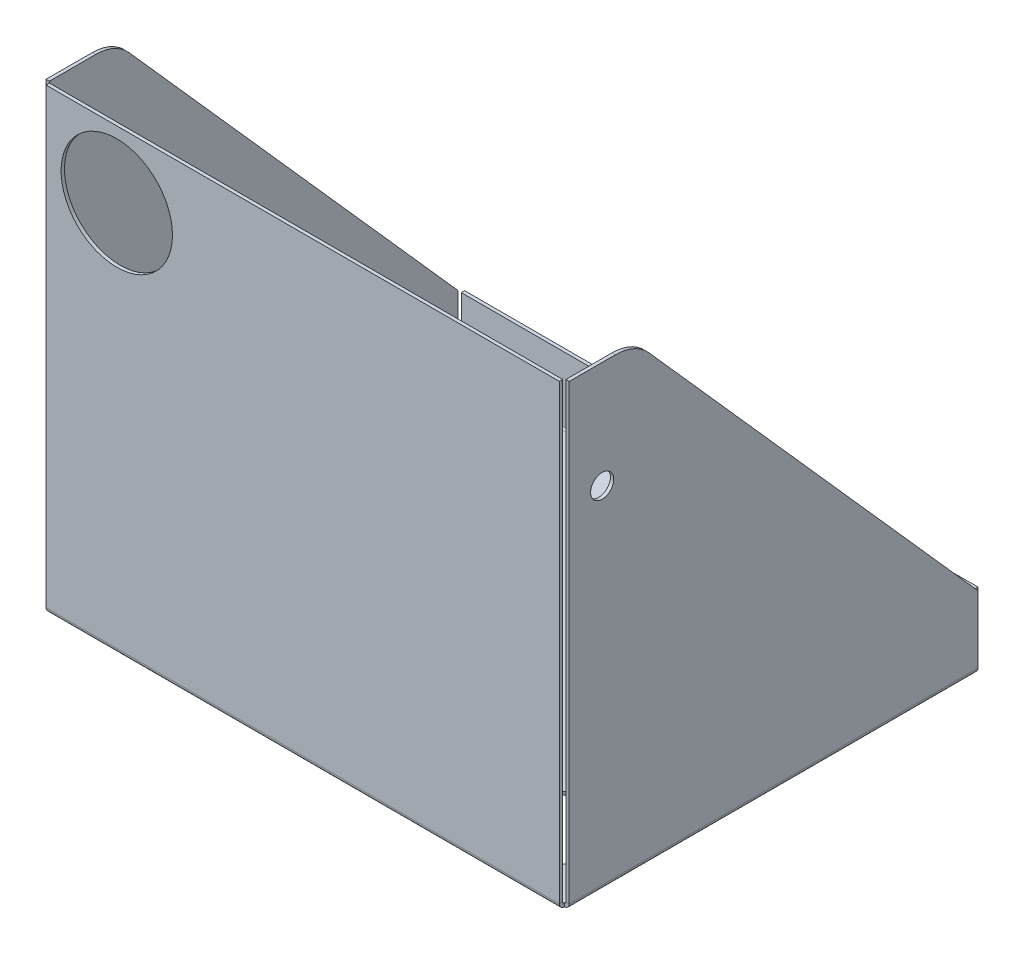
ISO-10303-21;
HEADER;
FILE_DESCRIPTION(('STEP AP214'),'2;1');
FILE_NAME('part.step','',(''),(''),'','','');
FILE_SCHEMA(('AUTOMOTIVE_DESIGN { 1 0 10303 214 1 1 1 1 }'));
ENDSEC;
DATA;
#1=APPLICATION_CONTEXT('core data for automotive mechanical design processes');
#2=APPLICATION_PROTOCOL_DEFINITION('international standard','automotive_design',2000,#1);
#3=PRODUCT_CONTEXT('',#1,'mechanical');
#4=PRODUCT('Part','Part','',(#3));
#5=PRODUCT_RELATED_PRODUCT_CATEGORY('part','',(#4));
#6=PRODUCT_DEFINITION_FORMATION('','',#4);
#7=PRODUCT_DEFINITION_CONTEXT('part definition',#1,'design');
#8=PRODUCT_DEFINITION('design','',#6,#7);
#9=PRODUCT_DEFINITION_SHAPE('','',#8);
#10=(LENGTH_UNIT() NAMED_UNIT(*) SI_UNIT(.MILLI.,.METRE.));
#11=(NAMED_UNIT(*) PLANE_ANGLE_UNIT() SI_UNIT($,.RADIAN.));
#12=(NAMED_UNIT(*) SI_UNIT($,.STERADIAN.) SOLID_ANGLE_UNIT());
#13=UNCERTAINTY_MEASURE_WITH_UNIT(LENGTH_MEASURE(1.E-05),#10,'distance_accuracy_value','');
#14=(GEOMETRIC_REPRESENTATION_CONTEXT(3) GLOBAL_UNCERTAINTY_ASSIGNED_CONTEXT((#13)) GLOBAL_UNIT_ASSIGNED_CONTEXT((#10,
#11,#12)) REPRESENTATION_CONTEXT('',''));
#15=CARTESIAN_POINT('',(0.,0.,0.));
#16=DIRECTION('',(0.,0.,1.));
#17=DIRECTION('',(1.,0.,0.));
#18=AXIS2_PLACEMENT_3D('',#15,#16,#17);
#19=CARTESIAN_POINT('',(-116.,1.5,-91.7928932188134));
#20=DIRECTION('',(0.,0.,-1.));
#21=DIRECTION('',(0.,1.,0.));
#22=AXIS2_PLACEMENT_3D('',#19,#20,#21);
#23=PLANE('',#22);
#24=DIRECTION('',(0.,1.,0.));
#25=VECTOR('',#24,1.);
#26=CARTESIAN_POINT('',(-117.500000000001,205.5,-91.7928932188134));
#27=LINE('',#26,#25);
#28=CARTESIAN_POINT('',(-117.5,2.2366,-91.7928932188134));
#29=VERTEX_POINT('',#28);
#30=CARTESIAN_POINT('',(-117.5,32.2963532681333,-91.7928932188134));
#31=VERTEX_POINT('',#30);
#32=EDGE_CURVE('E214',#29,#31,#27,.T.);
#33=ORIENTED_EDGE('',*,*,#32,.T.);
#34=DIRECTION('',(1.,0.,0.));
#35=VECTOR('',#34,1.);
#36=CARTESIAN_POINT('',(-116.,32.2963532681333,-91.7928932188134));
#37=LINE('',#36,#35);
#38=CARTESIAN_POINT('',(-116.,32.2963532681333,-91.7928932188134));
#39=VERTEX_POINT('',#38);
#40=EDGE_CURVE('E198',#39,#31,#37,.F.);
#41=ORIENTED_EDGE('',*,*,#40,.F.);
#42=DIRECTION('',(0.,1.,0.));
#43=VECTOR('',#42,1.);
#44=CARTESIAN_POINT('',(-116.,1.5,-91.7928932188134));
#45=LINE('',#44,#43);
#46=CARTESIAN_POINT('',(-116.,2.23660000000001,-91.7928932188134));
#47=VERTEX_POINT('',#46);
#48=EDGE_CURVE('E211',#47,#39,#45,.T.);
#49=ORIENTED_EDGE('',*,*,#48,.F.);
#50=DIRECTION('',(1.,0.,0.));
#51=VECTOR('',#50,1.);
#52=CARTESIAN_POINT('',(-116.,2.23660000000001,-91.7928932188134));
#53=LINE('',#52,#51);
#54=EDGE_CURVE('E236',#29,#47,#53,.T.);
#55=ORIENTED_EDGE('',*,*,#54,.F.);
#56=EDGE_LOOP('',(#33,#41,#49,#55));
#57=FACE_BOUND('',#56,.T.);
#58=ADVANCED_FACE('F35',(#57),#23,.T.);
#59=CARTESIAN_POINT('',(-117.500000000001,205.5,-92.5));
#60=DIRECTION('',(1.,0.,0.));
#61=DIRECTION('',(0.,1.,0.));
#62=AXIS2_PLACEMENT_3D('',#59,#60,#61);
#63=PLANE('',#62);
#64=DIRECTION('',(0.,0.,-1.));
#65=VECTOR('',#64,1.);
#66=CARTESIAN_POINT('',(-117.500000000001,205.5,-92.5));
#67=LINE('',#66,#65);
#68=CARTESIAN_POINT('',(-117.500000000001,205.5,91.7928932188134));
#69=VERTEX_POINT('',#68);
#70=CARTESIAN_POINT('',(-117.500000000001,205.5,70.9877549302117));
#71=VERTEX_POINT('',#70);
#72=EDGE_CURVE('E233',#69,#71,#67,.T.);
#73=ORIENTED_EDGE('',*,*,#72,.T.);
#74=CARTESIAN_POINT('',(-117.500000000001,185.5,70.9877549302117));
#75=DIRECTION('',(1.,0.,0.));
#76=DIRECTION('',(0.,1.,0.));
#77=AXIS2_PLACEMENT_3D('',#74,#75,#76);
#78=CIRCLE('',#77,20.);
#79=CARTESIAN_POINT('',(-117.500000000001,198.779272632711,56.0324575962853));
#80=VERTEX_POINT('',#79);
#81=EDGE_CURVE('E324',#71,#80,#78,.F.);
#82=ORIENTED_EDGE('',*,*,#81,.T.);
#83=DIRECTION('',(0.,-0.74776486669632,-0.663963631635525));
#84=VECTOR('',#83,1.);
#85=CARTESIAN_POINT('',(-117.5,128.792499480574,-6.11097028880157));
#86=LINE('',#85,#84);
#87=EDGE_CURVE('E205',#80,#31,#86,.T.);
#88=ORIENTED_EDGE('',*,*,#87,.T.);
#89=ORIENTED_EDGE('',*,*,#32,.F.);
#90=DIRECTION('',(0.,0.,-1.));
#91=VECTOR('',#90,1.);
#92=CARTESIAN_POINT('',(-117.5,2.23660000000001,-92.5));
#93=LINE('',#92,#91);
#94=CARTESIAN_POINT('',(-117.5,2.23660000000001,91.7928932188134));
#95=VERTEX_POINT('',#94);
#96=EDGE_CURVE('E228',#95,#29,#93,.T.);
#97=ORIENTED_EDGE('',*,*,#96,.F.);
#98=DIRECTION('',(0.,1.,0.));
#99=VECTOR('',#98,1.);
#100=CARTESIAN_POINT('',(-117.500000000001,205.5,91.7928932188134));
#101=LINE('',#100,#99);
#102=EDGE_CURVE('E223',#95,#69,#101,.T.);
#103=ORIENTED_EDGE('',*,*,#102,.T.);
#104=EDGE_LOOP('',(#73,#82,#88,#89,#97,#103));
#105=FACE_BOUND('',#104,.T.);
#106=ADVANCED_FACE('F591',(#105),#63,.F.);
#107=CARTESIAN_POINT('',(-116.000000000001,205.5,-92.5));
#108=DIRECTION('',(1.,0.,0.));
#109=DIRECTION('',(0.,1.,0.));
#110=AXIS2_PLACEMENT_3D('',#107,#108,#109);
#111=PLANE('',#110);
#112=DIRECTION('',(0.,-0.74776486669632,-0.663963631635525));
#113=VECTOR('',#112,1.);
#114=CARTESIAN_POINT('',(-116.,128.792499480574,-6.11097028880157));
#115=LINE('',#114,#113);
#116=CARTESIAN_POINT('',(-116.000000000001,198.779272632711,56.0324575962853));
#117=VERTEX_POINT('',#116);
#118=EDGE_CURVE('E194',#117,#39,#115,.T.);
#119=ORIENTED_EDGE('',*,*,#118,.F.);
#120=CARTESIAN_POINT('',(-116.000000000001,185.5,70.9877549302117));
#121=DIRECTION('',(1.,0.,0.));
#122=DIRECTION('',(0.,1.,0.));
#123=AXIS2_PLACEMENT_3D('',#120,#121,#122);
#124=CIRCLE('',#123,20.);
#125=CARTESIAN_POINT('',(-116.000000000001,205.5,70.9877549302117));
#126=VERTEX_POINT('',#125);
#127=EDGE_CURVE('E327',#117,#126,#124,.T.);
#128=ORIENTED_EDGE('',*,*,#127,.T.);
#129=DIRECTION('',(0.,0.,-1.));
#130=VECTOR('',#129,1.);
#131=CARTESIAN_POINT('',(-116.000000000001,205.5,-92.5));
#132=LINE('',#131,#130);
#133=CARTESIAN_POINT('',(-116.000000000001,205.5,91.7928932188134));
#134=VERTEX_POINT('',#133);
#135=EDGE_CURVE('E230',#134,#126,#132,.T.);
#136=ORIENTED_EDGE('',*,*,#135,.F.);
#137=DIRECTION('',(0.,1.,0.));
#138=VECTOR('',#137,1.);
#139=CARTESIAN_POINT('',(-116.,1.5,91.7928932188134));
#140=LINE('',#139,#138);
#141=CARTESIAN_POINT('',(-116.,2.23660000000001,91.7928932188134));
#142=VERTEX_POINT('',#141);
#143=EDGE_CURVE('E585',#142,#134,#140,.T.);
#144=ORIENTED_EDGE('',*,*,#143,.F.);
#145=DIRECTION('',(0.,0.,1.));
#146=VECTOR('',#145,1.);
#147=CARTESIAN_POINT('',(-116.,2.23660000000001,-92.5));
#148=LINE('',#147,#146);
#149=EDGE_CURVE('E219',#47,#142,#148,.T.);
#150=ORIENTED_EDGE('',*,*,#149,.F.);
#151=ORIENTED_EDGE('',*,*,#48,.T.);
#152=EDGE_LOOP('',(#119,#128,#136,#144,#150,#151));
#153=FACE_BOUND('',#152,.T.);
#154=ADVANCED_FACE('F217',(#153),#111,.T.);
#155=CARTESIAN_POINT('',(-117.500000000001,205.5,-92.5));
#156=DIRECTION('',(0.,-1.,0.));
#157=DIRECTION('',(1.,0.,0.));
#158=AXIS2_PLACEMENT_3D('',#155,#156,#157);
#159=PLANE('',#158);
#160=ORIENTED_EDGE('',*,*,#135,.T.);
#161=DIRECTION('',(1.,0.,0.));
#162=VECTOR('',#161,1.);
#163=CARTESIAN_POINT('',(-117.500000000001,205.5,70.9877549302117));
#164=LINE('',#163,#162);
#165=EDGE_CURVE('E321',#126,#71,#164,.F.);
#166=ORIENTED_EDGE('',*,*,#165,.T.);
#167=ORIENTED_EDGE('',*,*,#72,.F.);
#168=DIRECTION('',(1.,0.,0.));
#169=VECTOR('',#168,1.);
#170=CARTESIAN_POINT('',(-117.500000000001,205.5,91.7928932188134));
#171=LINE('',#170,#169);
#172=EDGE_CURVE('E220',#69,#134,#171,.T.);
#173=ORIENTED_EDGE('',*,*,#172,.T.);
#174=EDGE_LOOP('',(#160,#166,#167,#173));
#175=FACE_BOUND('',#174,.T.);
#176=ADVANCED_FACE('F267',(#175),#159,.F.);
#177=CARTESIAN_POINT('',(115.292893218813,1.5,-92.5));
#178=DIRECTION('',(1.,0.,0.));
#179=DIRECTION('',(0.,0.,-1.));
#180=AXIS2_PLACEMENT_3D('',#177,#178,#179);
#181=PLANE('',#180);
#182=DIRECTION('',(0.,1.,0.));
#183=VECTOR('',#182,1.);
#184=CARTESIAN_POINT('',(115.292893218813,205.5,-94.0000000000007));
#185=LINE('',#184,#183);
#186=CARTESIAN_POINT('',(115.292893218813,2.23659999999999,-94.));
#187=VERTEX_POINT('',#186);
#188=CARTESIAN_POINT('',(115.292893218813,31.5,-94.0000000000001));
#189=VERTEX_POINT('',#188);
#190=EDGE_CURVE('E363',#187,#189,#185,.T.);
#191=ORIENTED_EDGE('',*,*,#190,.T.);
#192=DIRECTION('',(0.,0.,1.));
#193=VECTOR('',#192,1.);
#194=CARTESIAN_POINT('',(115.292893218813,31.5,-92.5));
#195=LINE('',#194,#193);
#196=CARTESIAN_POINT('',(115.292893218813,31.5,-92.5));
#197=VERTEX_POINT('',#196);
#198=EDGE_CURVE('E351',#197,#189,#195,.F.);
#199=ORIENTED_EDGE('',*,*,#198,.F.);
#200=DIRECTION('',(0.,1.,0.));
#201=VECTOR('',#200,1.);
#202=CARTESIAN_POINT('',(115.292893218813,1.5,-92.5));
#203=LINE('',#202,#201);
#204=CARTESIAN_POINT('',(115.292893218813,2.2366,-92.5));
#205=VERTEX_POINT('',#204);
#206=EDGE_CURVE('E360',#205,#197,#203,.T.);
#207=ORIENTED_EDGE('',*,*,#206,.F.);
#208=DIRECTION('',(0.,0.,1.));
#209=VECTOR('',#208,1.);
#210=CARTESIAN_POINT('',(115.292893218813,2.23660000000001,-92.5));
#211=LINE('',#210,#209);
#212=EDGE_CURVE('E370',#187,#205,#211,.T.);
#213=ORIENTED_EDGE('',*,*,#212,.F.);
#214=EDGE_LOOP('',(#191,#199,#207,#213));
#215=FACE_BOUND('',#214,.T.);
#216=ADVANCED_FACE('F630',(#215),#181,.T.);
#217=CARTESIAN_POINT('',(116.,205.5,-94.0000000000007));
#218=DIRECTION('',(0.,0.,1.));
#219=DIRECTION('',(0.,-1.,0.));
#220=AXIS2_PLACEMENT_3D('',#217,#218,#219);
#221=PLANE('',#220);
#222=DIRECTION('',(1.,0.,0.));
#223=VECTOR('',#222,1.);
#224=CARTESIAN_POINT('',(116.,31.5000000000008,-94.0000000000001));
#225=LINE('',#224,#223);
#226=CARTESIAN_POINT('',(-115.292893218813,31.5,-94.0000000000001));
#227=VERTEX_POINT('',#226);
#228=EDGE_CURVE('E604',#227,#189,#225,.T.);
#229=ORIENTED_EDGE('',*,*,#228,.T.);
#230=ORIENTED_EDGE('',*,*,#190,.F.);
#231=DIRECTION('',(1.,0.,0.));
#232=VECTOR('',#231,1.);
#233=CARTESIAN_POINT('',(116.,2.23660000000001,-94.));
#234=LINE('',#233,#232);
#235=CARTESIAN_POINT('',(-115.292893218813,2.23660000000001,-94.));
#236=VERTEX_POINT('',#235);
#237=EDGE_CURVE('E368',#236,#187,#234,.T.);
#238=ORIENTED_EDGE('',*,*,#237,.F.);
#239=DIRECTION('',(0.,1.,0.));
#240=VECTOR('',#239,1.);
#241=CARTESIAN_POINT('',(-115.292893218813,205.5,-94.0000000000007));
#242=LINE('',#241,#240);
#243=EDGE_CURVE('E357',#236,#227,#242,.T.);
#244=ORIENTED_EDGE('',*,*,#243,.T.);
#245=EDGE_LOOP('',(#229,#230,#238,#244));
#246=FACE_BOUND('',#245,.T.);
#247=ADVANCED_FACE('F400',(#246),#221,.F.);
#248=CARTESIAN_POINT('',(116.,205.5,-92.5000000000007));
#249=DIRECTION('',(0.,0.,1.));
#250=DIRECTION('',(0.,-1.,0.));
#251=AXIS2_PLACEMENT_3D('',#248,#249,#250);
#252=PLANE('',#251);
#253=ORIENTED_EDGE('',*,*,#206,.T.);
#254=DIRECTION('',(1.,0.,0.));
#255=VECTOR('',#254,1.);
#256=CARTESIAN_POINT('',(-117.500000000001,31.5000000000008,-92.5));
#257=LINE('',#256,#255);
#258=CARTESIAN_POINT('',(-115.292893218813,31.5000000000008,-92.4999999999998));
#259=VERTEX_POINT('',#258);
#260=EDGE_CURVE('E215',#259,#197,#257,.T.);
#261=ORIENTED_EDGE('',*,*,#260,.F.);
#262=DIRECTION('',(0.,1.,0.));
#263=VECTOR('',#262,1.);
#264=CARTESIAN_POINT('',(-115.292893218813,1.5,-92.5));
#265=LINE('',#264,#263);
#266=CARTESIAN_POINT('',(-115.292893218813,2.2366,-92.5));
#267=VERTEX_POINT('',#266);
#268=EDGE_CURVE('E349',#267,#259,#265,.T.);
#269=ORIENTED_EDGE('',*,*,#268,.F.);
#270=DIRECTION('',(-1.,0.,0.));
#271=VECTOR('',#270,1.);
#272=CARTESIAN_POINT('',(116.,2.23660000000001,-92.5));
#273=LINE('',#272,#271);
#274=EDGE_CURVE('E366',#205,#267,#273,.T.);
#275=ORIENTED_EDGE('',*,*,#274,.F.);
#276=EDGE_LOOP('',(#253,#261,#269,#275));
#277=FACE_BOUND('',#276,.T.);
#278=ADVANCED_FACE('F634',(#277),#252,.T.);
#279=CARTESIAN_POINT('',(-115.292893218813,1.5,-92.5));
#280=DIRECTION('',(1.,0.,0.));
#281=DIRECTION('',(0.,0.,-1.));
#282=AXIS2_PLACEMENT_3D('',#279,#280,#281);
#283=PLANE('',#282);
#284=DIRECTION('',(0.,0.,1.));
#285=VECTOR('',#284,1.);
#286=CARTESIAN_POINT('',(-115.292893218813,31.5000000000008,-92.4999999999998));
#287=LINE('',#286,#285);
#288=EDGE_CURVE('E607',#259,#227,#287,.F.);
#289=ORIENTED_EDGE('',*,*,#288,.T.);
#290=ORIENTED_EDGE('',*,*,#243,.F.);
#291=DIRECTION('',(0.,0.,1.));
#292=VECTOR('',#291,1.);
#293=CARTESIAN_POINT('',(-115.292893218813,2.23660000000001,-92.5));
#294=LINE('',#293,#292);
#295=EDGE_CURVE('E372',#236,#267,#294,.T.);
#296=ORIENTED_EDGE('',*,*,#295,.T.);
#297=ORIENTED_EDGE('',*,*,#268,.T.);
#298=EDGE_LOOP('',(#289,#290,#296,#297));
#299=FACE_BOUND('',#298,.T.);
#300=ADVANCED_FACE('F611',(#299),#283,.F.);
#301=CARTESIAN_POINT('',(117.500000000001,205.5,92.5));
#302=DIRECTION('',(-1.,0.,0.));
#303=DIRECTION('',(0.,-1.,0.));
#304=AXIS2_PLACEMENT_3D('',#301,#302,#303);
#305=PLANE('',#304);
#306=CARTESIAN_POINT('',(117.500000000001,157.5,77.));
#307=DIRECTION('',(1.,0.,0.));
#308=DIRECTION('',(0.,1.,0.));
#309=AXIS2_PLACEMENT_3D('',#306,#307,#308);
#310=CIRCLE('',#309,5.2);
#311=CARTESIAN_POINT('',(117.500000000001,162.7,77.));
#312=VERTEX_POINT('',#311);
#313=EDGE_CURVE('E1251',#312,#312,#310,.T.);
#314=ORIENTED_EDGE('',*,*,#313,.F.);
#315=EDGE_LOOP('',(#314));
#316=FACE_BOUND('',#315,.T.);
#317=DIRECTION('',(0.,0.74776486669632,0.663963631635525));
#318=VECTOR('',#317,1.);
#319=CARTESIAN_POINT('',(117.500000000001,220.642904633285,75.4458549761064));
#320=LINE('',#319,#318);
#321=CARTESIAN_POINT('',(117.5,32.2963532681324,-91.7928932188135));
#322=VERTEX_POINT('',#321);
#323=CARTESIAN_POINT('',(117.500000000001,198.779272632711,56.0324575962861));
#324=VERTEX_POINT('',#323);
#325=EDGE_CURVE('E336',#322,#324,#320,.T.);
#326=ORIENTED_EDGE('',*,*,#325,.T.);
#327=CARTESIAN_POINT('',(117.500000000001,185.5,70.9877549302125));
#328=DIRECTION('',(-1.,0.,0.));
#329=DIRECTION('',(0.,-1.,0.));
#330=AXIS2_PLACEMENT_3D('',#327,#328,#329);
#331=CIRCLE('',#330,20.);
#332=CARTESIAN_POINT('',(117.500000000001,205.5,70.9877549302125));
#333=VERTEX_POINT('',#332);
#334=EDGE_CURVE('E57',#324,#333,#331,.F.);
#335=ORIENTED_EDGE('',*,*,#334,.T.);
#336=DIRECTION('',(0.,0.,1.));
#337=VECTOR('',#336,1.);
#338=CARTESIAN_POINT('',(117.500000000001,205.5,92.5));
#339=LINE('',#338,#337);
#340=CARTESIAN_POINT('',(117.500000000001,205.5,91.7928932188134));
#341=VERTEX_POINT('',#340);
#342=EDGE_CURVE('E443',#333,#341,#339,.T.);
#343=ORIENTED_EDGE('',*,*,#342,.T.);
#344=DIRECTION('',(0.,1.,0.));
#345=VECTOR('',#344,1.);
#346=CARTESIAN_POINT('',(117.500000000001,205.5,91.7928932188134));
#347=LINE('',#346,#345);
#348=CARTESIAN_POINT('',(117.5,2.2366,91.7928932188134));
#349=VERTEX_POINT('',#348);
#350=EDGE_CURVE('E431',#349,#341,#347,.T.);
#351=ORIENTED_EDGE('',*,*,#350,.F.);
#352=DIRECTION('',(0.,0.,1.));
#353=VECTOR('',#352,1.);
#354=CARTESIAN_POINT('',(117.5,2.23660000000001,92.5));
#355=LINE('',#354,#353);
#356=CARTESIAN_POINT('',(117.5,2.23660000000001,-91.7928932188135));
#357=VERTEX_POINT('',#356);
#358=EDGE_CURVE('E439',#357,#349,#355,.T.);
#359=ORIENTED_EDGE('',*,*,#358,.F.);
#360=DIRECTION('',(0.,1.,0.));
#361=VECTOR('',#360,1.);
#362=CARTESIAN_POINT('',(117.500000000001,205.5,-91.7928932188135));
#363=LINE('',#362,#361);
#364=EDGE_CURVE('E346',#357,#322,#363,.T.);
#365=ORIENTED_EDGE('',*,*,#364,.T.);
#366=EDGE_LOOP('',(#326,#335,#343,#351,#359,#365));
#367=FACE_BOUND('',#366,.T.);
#368=ADVANCED_FACE('F343',(#316,#367),#305,.F.);
#369=CARTESIAN_POINT('',(116.000000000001,205.5,92.5));
#370=DIRECTION('',(-1.,0.,0.));
#371=DIRECTION('',(0.,-1.,0.));
#372=AXIS2_PLACEMENT_3D('',#369,#370,#371);
#373=PLANE('',#372);
#374=CARTESIAN_POINT('',(116.000000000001,157.5,77.));
#375=DIRECTION('',(1.,0.,0.));
#376=DIRECTION('',(0.,1.,0.));
#377=AXIS2_PLACEMENT_3D('',#374,#375,#376);
#378=CIRCLE('',#377,5.2);
#379=CARTESIAN_POINT('',(116.000000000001,162.7,77.));
#380=VERTEX_POINT('',#379);
#381=EDGE_CURVE('E206',#380,#380,#378,.T.);
#382=ORIENTED_EDGE('',*,*,#381,.T.);
#383=EDGE_LOOP('',(#382));
#384=FACE_BOUND('',#383,.T.);
#385=DIRECTION('',(0.,0.,1.));
#386=VECTOR('',#385,1.);
#387=CARTESIAN_POINT('',(116.000000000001,205.5,92.5));
#388=LINE('',#387,#386);
#389=CARTESIAN_POINT('',(116.000000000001,205.5,70.9877549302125));
#390=VERTEX_POINT('',#389);
#391=CARTESIAN_POINT('',(116.000000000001,205.5,91.7928932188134));
#392=VERTEX_POINT('',#391);
#393=EDGE_CURVE('E441',#390,#392,#388,.T.);
#394=ORIENTED_EDGE('',*,*,#393,.F.);
#395=CARTESIAN_POINT('',(116.000000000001,185.5,70.9877549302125));
#396=DIRECTION('',(-1.,0.,0.));
#397=DIRECTION('',(0.,-1.,0.));
#398=AXIS2_PLACEMENT_3D('',#395,#396,#397);
#399=CIRCLE('',#398,20.);
#400=CARTESIAN_POINT('',(116.000000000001,198.779272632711,56.0324575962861));
#401=VERTEX_POINT('',#400);
#402=EDGE_CURVE('E11',#390,#401,#399,.T.);
#403=ORIENTED_EDGE('',*,*,#402,.T.);
#404=DIRECTION('',(0.,0.74776486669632,0.663963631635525));
#405=VECTOR('',#404,1.);
#406=CARTESIAN_POINT('',(116.000000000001,220.642904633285,75.4458549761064));
#407=LINE('',#406,#405);
#408=CARTESIAN_POINT('',(116.,32.2963532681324,-91.7928932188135));
#409=VERTEX_POINT('',#408);
#410=EDGE_CURVE('E339',#409,#401,#407,.T.);
#411=ORIENTED_EDGE('',*,*,#410,.F.);
#412=DIRECTION('',(0.,1.,0.));
#413=VECTOR('',#412,1.);
#414=CARTESIAN_POINT('',(116.,1.5,-91.7928932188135));
#415=LINE('',#414,#413);
#416=CARTESIAN_POINT('',(116.,2.23660000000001,-91.7928932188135));
#417=VERTEX_POINT('',#416);
#418=EDGE_CURVE('E419',#417,#409,#415,.T.);
#419=ORIENTED_EDGE('',*,*,#418,.F.);
#420=DIRECTION('',(0.,0.,-1.));
#421=VECTOR('',#420,1.);
#422=CARTESIAN_POINT('',(116.,2.23660000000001,92.5));
#423=LINE('',#422,#421);
#424=CARTESIAN_POINT('',(116.,2.23660000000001,91.7928932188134));
#425=VERTEX_POINT('',#424);
#426=EDGE_CURVE('E437',#425,#417,#423,.T.);
#427=ORIENTED_EDGE('',*,*,#426,.F.);
#428=DIRECTION('',(0.,1.,0.));
#429=VECTOR('',#428,1.);
#430=CARTESIAN_POINT('',(116.,1.5,91.7928932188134));
#431=LINE('',#430,#429);
#432=EDGE_CURVE('E428',#425,#392,#431,.T.);
#433=ORIENTED_EDGE('',*,*,#432,.T.);
#434=EDGE_LOOP('',(#394,#403,#411,#419,#427,#433));
#435=FACE_BOUND('',#434,.T.);
#436=ADVANCED_FACE('F695',(#384,#435),#373,.T.);
#437=CARTESIAN_POINT('',(117.500000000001,205.5,92.5));
#438=DIRECTION('',(0.,-1.,0.));
#439=DIRECTION('',(1.,0.,0.));
#440=AXIS2_PLACEMENT_3D('',#437,#438,#439);
#441=PLANE('',#440);
#442=ORIENTED_EDGE('',*,*,#342,.F.);
#443=DIRECTION('',(-1.,0.,0.));
#444=VECTOR('',#443,1.);
#445=CARTESIAN_POINT('',(116.000000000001,205.5,70.9877549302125));
#446=LINE('',#445,#444);
#447=EDGE_CURVE('E43',#333,#390,#446,.T.);
#448=ORIENTED_EDGE('',*,*,#447,.T.);
#449=ORIENTED_EDGE('',*,*,#393,.T.);
#450=DIRECTION('',(-1.,0.,0.));
#451=VECTOR('',#450,1.);
#452=CARTESIAN_POINT('',(117.500000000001,205.5,91.7928932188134));
#453=LINE('',#452,#451);
#454=EDGE_CURVE('E434',#341,#392,#453,.T.);
#455=ORIENTED_EDGE('',*,*,#454,.F.);
#456=EDGE_LOOP('',(#442,#448,#449,#455));
#457=FACE_BOUND('',#456,.T.);
#458=ADVANCED_FACE('F476',(#457),#441,.F.);
#459=CARTESIAN_POINT('',(116.,1.5,-91.7928932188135));
#460=DIRECTION('',(0.,0.,1.));
#461=DIRECTION('',(0.,-1.,0.));
#462=AXIS2_PLACEMENT_3D('',#459,#460,#461);
#463=PLANE('',#462);
#464=DIRECTION('',(-1.,0.,0.));
#465=VECTOR('',#464,1.);
#466=CARTESIAN_POINT('',(116.,32.2963532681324,-91.7928932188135));
#467=LINE('',#466,#465);
#468=EDGE_CURVE('E347',#409,#322,#467,.F.);
#469=ORIENTED_EDGE('',*,*,#468,.T.);
#470=ORIENTED_EDGE('',*,*,#364,.F.);
#471=DIRECTION('',(-1.,0.,0.));
#472=VECTOR('',#471,1.);
#473=CARTESIAN_POINT('',(116.,2.23660000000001,-91.7928932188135));
#474=LINE('',#473,#472);
#475=EDGE_CURVE('E447',#357,#417,#474,.T.);
#476=ORIENTED_EDGE('',*,*,#475,.T.);
#477=ORIENTED_EDGE('',*,*,#418,.T.);
#478=EDGE_LOOP('',(#469,#470,#476,#477));
#479=FACE_BOUND('',#478,.T.);
#480=ADVANCED_FACE('F692',(#479),#463,.F.);
#481=CARTESIAN_POINT('',(-116.,1.5,92.5));
#482=DIRECTION('',(0.,1.,0.));
#483=DIRECTION('',(0.,0.,1.));
#484=AXIS2_PLACEMENT_3D('',#481,#482,#483);
#485=PLANE('',#484);
#486=CARTESIAN_POINT('',(-86.,1.5,62.5));
#487=DIRECTION('',(0.,1.,0.));
#488=DIRECTION('',(0.,0.,-1.));
#489=AXIS2_PLACEMENT_3D('',#486,#487,#488);
#490=CIRCLE('',#489,20.);
#491=CARTESIAN_POINT('',(-86.,1.5,42.5));
#492=VERTEX_POINT('',#491);
#493=EDGE_CURVE('E306',#492,#492,#490,.T.);
#494=ORIENTED_EDGE('',*,*,#493,.F.);
#495=EDGE_LOOP('',(#494));
#496=FACE_BOUND('',#495,.T.);
#497=CARTESIAN_POINT('',(-86.,1.5,-62.5));
#498=DIRECTION('',(0.,1.,0.));
#499=DIRECTION('',(0.,0.,1.));
#500=AXIS2_PLACEMENT_3D('',#497,#498,#499);
#501=CIRCLE('',#500,20.);
#502=CARTESIAN_POINT('',(-86.,1.5,-42.5));
#503=VERTEX_POINT('',#502);
#504=EDGE_CURVE('E318',#503,#503,#501,.T.);
#505=ORIENTED_EDGE('',*,*,#504,.F.);
#506=EDGE_LOOP('',(#505));
#507=FACE_BOUND('',#506,.T.);
#508=CARTESIAN_POINT('',(86.,1.5,-62.5));
#509=DIRECTION('',(0.,1.,0.));
#510=DIRECTION('',(0.,0.,-1.));
#511=AXIS2_PLACEMENT_3D('',#508,#509,#510);
#512=CIRCLE('',#511,20.);
#513=CARTESIAN_POINT('',(86.,1.5,-82.5));
#514=VERTEX_POINT('',#513);
#515=EDGE_CURVE('E312',#514,#514,#512,.T.);
#516=ORIENTED_EDGE('',*,*,#515,.F.);
#517=EDGE_LOOP('',(#516));
#518=FACE_BOUND('',#517,.T.);
#519=CARTESIAN_POINT('',(85.9999999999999,1.5,62.5));
#520=DIRECTION('',(0.,1.,0.));
#521=DIRECTION('',(0.,0.,1.));
#522=AXIS2_PLACEMENT_3D('',#519,#520,#521);
#523=CIRCLE('',#522,20.);
#524=CARTESIAN_POINT('',(85.9999999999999,1.5,82.5));
#525=VERTEX_POINT('',#524);
#526=EDGE_CURVE('E300',#525,#525,#523,.T.);
#527=ORIENTED_EDGE('',*,*,#526,.F.);
#528=EDGE_LOOP('',(#527));
#529=FACE_BOUND('',#528,.T.);
#530=DIRECTION('',(0.,0.,-1.));
#531=VECTOR('',#530,1.);
#532=CARTESIAN_POINT('',(115.2634,1.5,-91.7928932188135));
#533=LINE('',#532,#531);
#534=CARTESIAN_POINT('',(115.2634,1.5,-91.7634));
#535=VERTEX_POINT('',#534);
#536=CARTESIAN_POINT('',(115.2634,1.5,91.7634));
#537=VERTEX_POINT('',#536);
#538=EDGE_CURVE('E451',#535,#537,#533,.F.);
#539=ORIENTED_EDGE('',*,*,#538,.F.);
#540=DIRECTION('',(-1.,0.,0.));
#541=VECTOR('',#540,1.);
#542=CARTESIAN_POINT('',(-115.292893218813,1.5,-91.7634));
#543=LINE('',#542,#541);
#544=CARTESIAN_POINT('',(-115.2634,1.5,-91.7634));
#545=VERTEX_POINT('',#544);
#546=EDGE_CURVE('E376',#545,#535,#543,.F.);
#547=ORIENTED_EDGE('',*,*,#546,.F.);
#548=DIRECTION('',(0.,0.,1.));
#549=VECTOR('',#548,1.);
#550=CARTESIAN_POINT('',(-115.2634,1.5,91.7928932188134));
#551=LINE('',#550,#549);
#552=CARTESIAN_POINT('',(-115.2634,1.5,91.7634));
#553=VERTEX_POINT('',#552);
#554=EDGE_CURVE('E242',#553,#545,#551,.F.);
#555=ORIENTED_EDGE('',*,*,#554,.F.);
#556=DIRECTION('',(1.,0.,0.));
#557=VECTOR('',#556,1.);
#558=CARTESIAN_POINT('',(115.292893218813,1.5,91.7634));
#559=LINE('',#558,#557);
#560=EDGE_CURVE('E533',#537,#553,#559,.F.);
#561=ORIENTED_EDGE('',*,*,#560,.F.);
#562=EDGE_LOOP('',(#539,#547,#555,#561));
#563=FACE_BOUND('',#562,.T.);
#564=ADVANCED_FACE('F37',(#496,#507,#518,#529,#563),#485,.T.);
#565=CARTESIAN_POINT('',(-116.,0.,92.5));
#566=DIRECTION('',(0.,1.,0.));
#567=DIRECTION('',(0.,0.,1.));
#568=AXIS2_PLACEMENT_3D('',#565,#566,#567);
#569=PLANE('',#568);
#570=CARTESIAN_POINT('',(-86.,0.,62.5));
#571=DIRECTION('',(0.,1.,0.));
#572=DIRECTION('',(0.,0.,-1.));
#573=AXIS2_PLACEMENT_3D('',#570,#571,#572);
#574=CIRCLE('',#573,20.);
#575=CARTESIAN_POINT('',(-86.,0.,42.5));
#576=VERTEX_POINT('',#575);
#577=EDGE_CURVE('E303',#576,#576,#574,.T.);
#578=ORIENTED_EDGE('',*,*,#577,.T.);
#579=EDGE_LOOP('',(#578));
#580=FACE_BOUND('',#579,.T.);
#581=CARTESIAN_POINT('',(-86.,0.,-62.5));
#582=DIRECTION('',(0.,1.,0.));
#583=DIRECTION('',(0.,0.,1.));
#584=AXIS2_PLACEMENT_3D('',#581,#582,#583);
#585=CIRCLE('',#584,20.);
#586=CARTESIAN_POINT('',(-86.,0.,-42.5));
#587=VERTEX_POINT('',#586);
#588=EDGE_CURVE('E315',#587,#587,#585,.T.);
#589=ORIENTED_EDGE('',*,*,#588,.T.);
#590=EDGE_LOOP('',(#589));
#591=FACE_BOUND('',#590,.T.);
#592=CARTESIAN_POINT('',(86.,0.,-62.5));
#593=DIRECTION('',(0.,1.,0.));
#594=DIRECTION('',(0.,0.,-1.));
#595=AXIS2_PLACEMENT_3D('',#592,#593,#594);
#596=CIRCLE('',#595,20.);
#597=CARTESIAN_POINT('',(86.,0.,-82.5));
#598=VERTEX_POINT('',#597);
#599=EDGE_CURVE('E309',#598,#598,#596,.T.);
#600=ORIENTED_EDGE('',*,*,#599,.T.);
#601=EDGE_LOOP('',(#600));
#602=FACE_BOUND('',#601,.T.);
#603=CARTESIAN_POINT('',(85.9999999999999,0.,62.5));
#604=DIRECTION('',(0.,1.,0.));
#605=DIRECTION('',(0.,0.,1.));
#606=AXIS2_PLACEMENT_3D('',#603,#604,#605);
#607=CIRCLE('',#606,20.);
#608=CARTESIAN_POINT('',(85.9999999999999,0.,82.5));
#609=VERTEX_POINT('',#608);
#610=EDGE_CURVE('E294',#609,#609,#607,.T.);
#611=ORIENTED_EDGE('',*,*,#610,.T.);
#612=EDGE_LOOP('',(#611));
#613=FACE_BOUND('',#612,.T.);
#614=DIRECTION('',(-1.,0.,0.));
#615=VECTOR('',#614,1.);
#616=CARTESIAN_POINT('',(-115.292893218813,0.,-91.7634));
#617=LINE('',#616,#615);
#618=CARTESIAN_POINT('',(-115.2634,0.,-91.7634));
#619=VERTEX_POINT('',#618);
#620=CARTESIAN_POINT('',(115.2634,0.,-91.7634));
#621=VERTEX_POINT('',#620);
#622=EDGE_CURVE('E385',#619,#621,#617,.F.);
#623=ORIENTED_EDGE('',*,*,#622,.T.);
#624=DIRECTION('',(0.,0.,-1.));
#625=VECTOR('',#624,1.);
#626=CARTESIAN_POINT('',(115.2634,0.,-91.7928932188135));
#627=LINE('',#626,#625);
#628=CARTESIAN_POINT('',(115.2634,0.,91.7634));
#629=VERTEX_POINT('',#628);
#630=EDGE_CURVE('E460',#621,#629,#627,.F.);
#631=ORIENTED_EDGE('',*,*,#630,.T.);
#632=DIRECTION('',(1.,0.,0.));
#633=VECTOR('',#632,1.);
#634=CARTESIAN_POINT('',(115.292893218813,0.,91.7634));
#635=LINE('',#634,#633);
#636=CARTESIAN_POINT('',(-115.2634,0.,91.7634));
#637=VERTEX_POINT('',#636);
#638=EDGE_CURVE('E542',#629,#637,#635,.F.);
#639=ORIENTED_EDGE('',*,*,#638,.T.);
#640=DIRECTION('',(0.,0.,1.));
#641=VECTOR('',#640,1.);
#642=CARTESIAN_POINT('',(-115.2634,0.,91.7928932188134));
#643=LINE('',#642,#641);
#644=EDGE_CURVE('E251',#637,#619,#643,.F.);
#645=ORIENTED_EDGE('',*,*,#644,.T.);
#646=EDGE_LOOP('',(#623,#631,#639,#645));
#647=FACE_BOUND('',#646,.T.);
#648=ADVANCED_FACE('F645',(#580,#591,#602,#613,#647),#569,.F.);
#649=CARTESIAN_POINT('',(-86.,1.5,-62.5));
#650=DIRECTION('',(0.,-1.,0.));
#651=DIRECTION('',(0.,0.,-1.));
#652=AXIS2_PLACEMENT_3D('',#649,#650,#651);
#653=CYLINDRICAL_SURFACE('',#652,20.);
#654=ORIENTED_EDGE('',*,*,#504,.T.);
#655=EDGE_LOOP('',(#654));
#656=FACE_BOUND('',#655,.T.);
#657=ORIENTED_EDGE('',*,*,#588,.F.);
#658=EDGE_LOOP('',(#657));
#659=FACE_BOUND('',#658,.T.);
#660=ADVANCED_FACE('F1098',(#656,#659),#653,.F.);
#661=CARTESIAN_POINT('',(86.,1.5,-62.5));
#662=DIRECTION('',(0.,-1.,0.));
#663=DIRECTION('',(0.,0.,-1.));
#664=AXIS2_PLACEMENT_3D('',#661,#662,#663);
#665=CYLINDRICAL_SURFACE('',#664,20.);
#666=ORIENTED_EDGE('',*,*,#515,.T.);
#667=EDGE_LOOP('',(#666));
#668=FACE_BOUND('',#667,.T.);
#669=ORIENTED_EDGE('',*,*,#599,.F.);
#670=EDGE_LOOP('',(#669));
#671=FACE_BOUND('',#670,.T.);
#672=ADVANCED_FACE('F1118',(#668,#671),#665,.F.);
#673=CARTESIAN_POINT('',(-86.,1.5,62.5));
#674=DIRECTION('',(0.,-1.,0.));
#675=DIRECTION('',(0.,0.,-1.));
#676=AXIS2_PLACEMENT_3D('',#673,#674,#675);
#677=CYLINDRICAL_SURFACE('',#676,20.);
#678=ORIENTED_EDGE('',*,*,#493,.T.);
#679=EDGE_LOOP('',(#678));
#680=FACE_BOUND('',#679,.T.);
#681=ORIENTED_EDGE('',*,*,#577,.F.);
#682=EDGE_LOOP('',(#681));
#683=FACE_BOUND('',#682,.T.);
#684=ADVANCED_FACE('F1107',(#680,#683),#677,.F.);
#685=CARTESIAN_POINT('',(85.9999999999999,1.5,62.5));
#686=DIRECTION('',(0.,-1.,0.));
#687=DIRECTION('',(0.,0.,-1.));
#688=AXIS2_PLACEMENT_3D('',#685,#686,#687);
#689=CYLINDRICAL_SURFACE('',#688,20.);
#690=ORIENTED_EDGE('',*,*,#526,.T.);
#691=EDGE_LOOP('',(#690));
#692=FACE_BOUND('',#691,.T.);
#693=ORIENTED_EDGE('',*,*,#610,.F.);
#694=EDGE_LOOP('',(#693));
#695=FACE_BOUND('',#694,.T.);
#696=ADVANCED_FACE('F1079',(#692,#695),#689,.F.);
#697=CARTESIAN_POINT('',(-115.2634,-0.0149999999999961,-91.7634));
#698=CARTESIAN_POINT('',(-115.558186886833,-0.0149999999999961,-91.7658582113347));
#699=CARTESIAN_POINT('',(-115.852751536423,0.0436031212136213,-91.7683155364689));
#700=CARTESIAN_POINT('',(-116.397348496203,0.269182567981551,-91.7732310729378));
#701=CARTESIAN_POINT('',(-116.647113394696,0.43607013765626,-91.7756888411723));
#702=CARTESIAN_POINT('',(-117.063929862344,0.852886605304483,-91.7806043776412));
#703=CARTESIAN_POINT('',(-117.230817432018,1.10265150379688,-91.7830621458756));
#704=CARTESIAN_POINT('',(-117.456396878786,1.64724846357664,-91.7879776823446));
#705=CARTESIAN_POINT('',(-117.515,1.94181311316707,-91.7904350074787));
#706=CARTESIAN_POINT('',(-117.515,2.2366,-91.7928932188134));
#707=CARTESIAN_POINT('',(-115.2634,0.,-91.7634));
#708=CARTESIAN_POINT('',(-115.556223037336,0.,-91.7658582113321));
#709=CARTESIAN_POINT('',(-115.848825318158,0.058212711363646,-91.7683155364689));
#710=CARTESIAN_POINT('',(-116.389794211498,0.282289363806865,-91.7732310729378));
#711=CARTESIAN_POINT('',(-116.637895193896,0.448065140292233,-91.7756888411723));
#712=CARTESIAN_POINT('',(-117.051934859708,0.862104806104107,-91.7806043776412));
#713=CARTESIAN_POINT('',(-117.217710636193,1.11020578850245,-91.7830621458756));
#714=CARTESIAN_POINT('',(-117.441787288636,1.65117468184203,-91.7879776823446));
#715=CARTESIAN_POINT('',(-117.5,1.94377696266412,-91.7904350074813));
#716=CARTESIAN_POINT('',(-117.5,2.2366,-91.7928932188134));
#717=CARTESIAN_POINT('',(-115.2634,1.5,-91.7634));
#718=CARTESIAN_POINT('',(-115.359838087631,1.5,-91.7658582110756));
#719=CARTESIAN_POINT('',(-115.456203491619,1.51917172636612,-91.7683155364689));
#720=CARTESIAN_POINT('',(-115.634365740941,1.59296894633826,-91.7732310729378));
#721=CARTESIAN_POINT('',(-115.716075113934,1.6475654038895,-91.7756888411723));
#722=CARTESIAN_POINT('',(-115.85243459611,1.78392488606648,-91.7806043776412));
#723=CARTESIAN_POINT('',(-115.907031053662,1.8656342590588,-91.7830621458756));
#724=CARTESIAN_POINT('',(-115.980828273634,2.04379650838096,-91.7879776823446));
#725=CARTESIAN_POINT('',(-116.,2.14016191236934,-91.7904350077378));
#726=CARTESIAN_POINT('',(-116.,2.23660000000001,-91.7928932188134));
#727=CARTESIAN_POINT('',(-115.2634,1.51515,-91.7634));
#728=CARTESIAN_POINT('',(-115.357854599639,1.51515,-91.765858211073));
#729=CARTESIAN_POINT('',(-115.452238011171,1.53392741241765,-91.7683155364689));
#730=CARTESIAN_POINT('',(-115.626735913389,1.60620681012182,-91.7732310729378));
#731=CARTESIAN_POINT('',(-115.706764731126,1.65968035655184,-91.7756888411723));
#732=CARTESIAN_POINT('',(-115.840319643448,1.7932352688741,-91.7806043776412));
#733=CARTESIAN_POINT('',(-115.893793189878,1.87326408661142,-91.7830621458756));
#734=CARTESIAN_POINT('',(-115.966072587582,2.047761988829,-91.7879776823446));
#735=CARTESIAN_POINT('',(-115.98485,2.14214540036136,-91.7904350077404));
#736=CARTESIAN_POINT('',(-115.98485,2.23660000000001,-91.7928932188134));
#737=B_SPLINE_SURFACE_WITH_KNOTS('',1,3,((#697,#698,#699,#700,#701,#702,#703,#704,#705,#706),
(#707,#708,#709,#710,#711,#712,#713,#714,#715,#716),(#717,#718,#719,#720,#721,#722,#723,#724,
#725,#726),(#727,#728,#729,#730,#731,#732,#733,#734,#735,#736)),.UNSPECIFIED.,.F.,.F.,.F.,(2,1,
1,2),(4,2,2,2,4),(-0.01,0.,1.,1.0101),(0.,0.25,0.5,0.75,1.),.UNSPECIFIED.);
#738=CARTESIAN_POINT('',(-115.2634,1.5,-91.7634));
#739=CARTESIAN_POINT('',(-115.275452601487,1.49999974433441,-91.7637072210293));
#740=CARTESIAN_POINT('',(-115.287505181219,1.50029580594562,-91.7640144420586));
#741=CARTESIAN_POINT('',(-115.3115813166,1.50147872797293,-91.7646288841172));
#742=CARTESIAN_POINT('',(-115.323604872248,1.50236558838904,-91.7649361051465));
#743=CARTESIAN_POINT('',(-115.347593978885,1.50472827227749,-91.7655505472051));
#744=CARTESIAN_POINT('',(-115.359559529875,1.50620409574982,-91.7658577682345));
#745=CARTESIAN_POINT('',(-115.383403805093,1.50974106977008,-91.7664722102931));
#746=CARTESIAN_POINT('',(-115.395282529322,1.511802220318,-91.7667794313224));
#747=CARTESIAN_POINT('',(-115.418924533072,1.51650490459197,-91.767393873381));
#748=CARTESIAN_POINT('',(-115.430687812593,1.51914643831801,-91.7677010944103));
#749=CARTESIAN_POINT('',(-115.45407058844,1.5250035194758,-91.7683155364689));
#750=CARTESIAN_POINT('',(-115.465690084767,1.52821906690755,-91.7686227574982));
#751=CARTESIAN_POINT('',(-115.488757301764,1.53521643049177,-91.7692371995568));
#752=CARTESIAN_POINT('',(-115.500205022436,1.53899824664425,-91.7695444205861));
#753=CARTESIAN_POINT('',(-115.522901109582,1.54711903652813,-91.7701588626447));
#754=CARTESIAN_POINT('',(-115.534149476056,1.55145801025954,-91.770466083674));
#755=CARTESIAN_POINT('',(-115.556419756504,1.56068266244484,-91.7710805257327));
#756=CARTESIAN_POINT('',(-115.567441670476,1.56556834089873,-91.771387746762));
#757=CARTESIAN_POINT('',(-115.589232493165,1.57587463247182,-91.7720021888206));
#758=CARTESIAN_POINT('',(-115.600001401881,1.58129524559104,-91.7723094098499));
#759=CARTESIAN_POINT('',(-115.621260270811,1.59265834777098,-91.7729238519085));
#760=CARTESIAN_POINT('',(-115.631750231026,1.59860083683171,-91.7732310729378));
#761=CARTESIAN_POINT('',(-115.65242593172,1.6109933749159,-91.7738455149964));
#762=CARTESIAN_POINT('',(-115.6626116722,1.61744342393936,-91.7741527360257));
#763=CARTESIAN_POINT('',(-115.682654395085,1.63083554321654,-91.7747671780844));
#764=CARTESIAN_POINT('',(-115.692511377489,1.63777761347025,-91.7750743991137));
#765=CARTESIAN_POINT('',(-115.711872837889,1.65213705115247,-91.7756888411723));
#766=CARTESIAN_POINT('',(-115.721377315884,1.65955441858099,-91.7759960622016));
#767=CARTESIAN_POINT('',(-115.740010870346,1.67484658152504,-91.7766105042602));
#768=CARTESIAN_POINT('',(-115.749139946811,1.68272137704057,-91.7769177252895));
#769=CARTESIAN_POINT('',(-115.767000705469,1.69890942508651,-91.7775321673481));
#770=CARTESIAN_POINT('',(-115.775732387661,1.70722267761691,-91.7778393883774));
#771=CARTESIAN_POINT('',(-115.792777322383,1.72426761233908,-91.778453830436));
#772=CARTESIAN_POINT('',(-115.801090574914,1.73299929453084,-91.7787610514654));
#773=CARTESIAN_POINT('',(-115.817278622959,1.75086005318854,-91.779375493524));
#774=CARTESIAN_POINT('',(-115.825153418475,1.75998912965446,-91.7796827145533));
#775=CARTESIAN_POINT('',(-115.840445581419,1.77862268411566,-91.7802971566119));
#776=CARTESIAN_POINT('',(-115.847862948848,1.78812716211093,-91.7806043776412));
#777=CARTESIAN_POINT('',(-115.86222238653,1.80748862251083,-91.7812188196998));
#778=CARTESIAN_POINT('',(-115.869164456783,1.81734560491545,-91.7815260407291));
#779=CARTESIAN_POINT('',(-115.882556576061,1.83738832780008,-91.7821404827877));
#780=CARTESIAN_POINT('',(-115.889006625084,1.84757406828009,-91.782447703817));
#781=CARTESIAN_POINT('',(-115.901399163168,1.86824976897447,-91.7830621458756));
#782=CARTESIAN_POINT('',(-115.907341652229,1.87873972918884,-91.7833693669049));
#783=CARTESIAN_POINT('',(-115.918704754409,1.8999985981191,-91.7839838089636));
#784=CARTESIAN_POINT('',(-115.924125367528,1.91076750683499,-91.7842910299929));
#785=CARTESIAN_POINT('',(-115.934431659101,1.93255832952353,-91.7849054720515));
#786=CARTESIAN_POINT('',(-115.939317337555,1.94358024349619,-91.7852126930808));
#787=CARTESIAN_POINT('',(-115.94854198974,1.96585052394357,-91.7858271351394));
#788=CARTESIAN_POINT('',(-115.952880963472,1.9770988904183,-91.7861343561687));
#789=CARTESIAN_POINT('',(-115.961001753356,1.99979497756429,-91.7867487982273));
#790=CARTESIAN_POINT('',(-115.964783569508,2.01124269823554,-91.7870560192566));
#791=CARTESIAN_POINT('',(-115.971780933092,2.03430991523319,-91.7876704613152));
#792=CARTESIAN_POINT('',(-115.974996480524,2.04592941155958,-91.7879776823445));
#793=CARTESIAN_POINT('',(-115.980853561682,2.06931218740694,-91.7885921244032));
#794=CARTESIAN_POINT('',(-115.983495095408,2.0810754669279,-91.7888993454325));
#795=CARTESIAN_POINT('',(-115.988197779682,2.10471747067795,-91.7895137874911));
#796=CARTESIAN_POINT('',(-115.99025893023,2.11659619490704,-91.7898210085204));
#797=CARTESIAN_POINT('',(-115.99379590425,2.14044047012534,-91.790435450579));
#798=CARTESIAN_POINT('',(-115.995271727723,2.15240602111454,-91.7907426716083));
#799=CARTESIAN_POINT('',(-115.997634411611,2.17639512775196,-91.7913571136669));
#800=CARTESIAN_POINT('',(-115.998521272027,2.18841868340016,-91.7916643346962));
#801=CARTESIAN_POINT('',(-115.999704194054,2.2124948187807,-91.7922787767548));
#802=CARTESIAN_POINT('',(-116.000000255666,2.22454739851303,-91.7925859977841));
#803=CARTESIAN_POINT('',(-116.,2.23660000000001,-91.7928932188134));
#804=B_SPLINE_CURVE_WITH_KNOTS('',3,(#738,#739,#740,#741,#742,#743,#744,#745,#746,#747,#748,
#749,#750,#751,#752,#753,#754,#755,#756,#757,#758,#759,#760,#761,#762,#763,#764,#765,#766,#767,
#768,#769,#770,#771,#772,#773,#774,#775,#776,#777,#778,#779,#780,#781,#782,#783,#784,#785,#786,
#787,#788,#789,#790,#791,#792,#793,#794,#795,#796,#797,#798,#799,#800,#801,#802,#803),
.UNSPECIFIED.,.F.,.F.,(4,2,2,2,2,2,2,2,2,2,2,2,2,2,2,2,2,2,2,2,2,2,2,2,2,2,2,2,2,2,2,2,4),(0.,
0.0361658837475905,0.0723317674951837,0.108497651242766,0.144663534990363,0.180829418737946,
0.216995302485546,0.253161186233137,0.289327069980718,0.325492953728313,0.361658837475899,
0.397824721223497,0.433990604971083,0.470156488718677,0.506322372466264,0.542488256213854,
0.578654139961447,0.614820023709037,0.650985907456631,0.687151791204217,0.723317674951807,
0.759483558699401,0.795649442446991,0.831815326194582,0.867981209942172,0.904147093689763,
0.940312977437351,0.976478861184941,1.01264474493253,1.04881062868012,1.08497651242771,
1.1211423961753,1.1573082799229),.UNSPECIFIED.);
#805=EDGE_CURVE('E245',#545,#47,#804,.T.);
#806=DIRECTION('',(0.,-1.,0.));
#807=VECTOR('',#806,1.);
#808=CARTESIAN_POINT('',(-115.2634,1.5,-91.7634));
#809=LINE('',#808,#807);
#810=EDGE_CURVE('E286',#545,#619,#809,.T.);
#811=CARTESIAN_POINT('',(-115.2634,0.,-91.7634));
#812=CARTESIAN_POINT('',(-115.299996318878,-7.76298751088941E-07,-91.7637072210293));
#813=CARTESIAN_POINT('',(-115.336592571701,0.000898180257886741,-91.7640144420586));
#814=CARTESIAN_POINT('',(-115.4096969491,0.00448998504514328,-91.7646288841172));
#815=CARTESIAN_POINT('',(-115.446205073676,0.00718283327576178,-91.7649361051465));
#816=CARTESIAN_POINT('',(-115.519045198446,0.0143568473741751,-91.7655505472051));
#817=CARTESIAN_POINT('',(-115.555377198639,0.01883801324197,-91.7658577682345));
#818=CARTESIAN_POINT('',(-115.627777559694,0.029577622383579,-91.7664722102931));
#819=CARTESIAN_POINT('',(-115.663845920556,0.035836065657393,-91.7667794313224));
#820=CARTESIAN_POINT('',(-115.735632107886,0.0501152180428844,-91.767393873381));
#821=CARTESIAN_POINT('',(-115.771349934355,0.0581359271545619,-91.7677010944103));
#822=CARTESIAN_POINT('',(-115.842349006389,0.0759202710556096,-91.7683155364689));
#823=CARTESIAN_POINT('',(-115.877630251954,0.0856839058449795,-91.7686227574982));
#824=CARTESIAN_POINT('',(-115.94767116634,0.106930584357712,-91.7692371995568));
#825=CARTESIAN_POINT('',(-115.982430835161,0.118413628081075,-91.7695444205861));
#826=CARTESIAN_POINT('',(-116.051344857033,0.143071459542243,-91.7701588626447));
#827=CARTESIAN_POINT('',(-116.085499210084,0.156246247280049,-91.770466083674));
#828=CARTESIAN_POINT('',(-116.153120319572,0.184255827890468,-91.7710805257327));
#829=CARTESIAN_POINT('',(-116.186587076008,0.199090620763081,-91.771387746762));
#830=CARTESIAN_POINT('',(-116.252752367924,0.23038447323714,-91.7720021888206));
#831=CARTESIAN_POINT('',(-116.285450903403,0.246843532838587,-91.7723094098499));
#832=CARTESIAN_POINT('',(-116.350000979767,0.281346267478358,-91.7729238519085));
#833=CARTESIAN_POINT('',(-116.381852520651,0.299389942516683,-91.7732310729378));
#834=CARTESIAN_POINT('',(-116.444631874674,0.337018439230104,-91.7738455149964));
#835=CARTESIAN_POINT('',(-116.475559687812,0.356603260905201,-91.7741527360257));
#836=CARTESIAN_POINT('',(-116.536417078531,0.397266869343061,-91.7747671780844));
#837=CARTESIAN_POINT('',(-116.566346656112,0.418345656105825,-91.7750743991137));
#838=CARTESIAN_POINT('',(-116.625135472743,0.46194641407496,-91.7756888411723));
#839=CARTESIAN_POINT('',(-116.653994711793,0.484468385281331,-91.7759960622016));
#840=CARTESIAN_POINT('',(-116.710573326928,0.530901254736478,-91.7766105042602));
#841=CARTESIAN_POINT('',(-116.738292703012,0.554812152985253,-91.7769177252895));
#842=CARTESIAN_POINT('',(-116.79252481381,0.603965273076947,-91.7775321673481));
#843=CARTESIAN_POINT('',(-116.819037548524,0.629207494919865,-91.7778393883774));
#844=CARTESIAN_POINT('',(-116.87079250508,0.680962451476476,-91.778453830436));
#845=CARTESIAN_POINT('',(-116.896034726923,0.707475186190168,-91.7787610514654));
#846=CARTESIAN_POINT('',(-116.945187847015,0.761707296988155,-91.779375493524));
#847=CARTESIAN_POINT('',(-116.969098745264,0.789426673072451,-91.7796827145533));
#848=CARTESIAN_POINT('',(-117.015531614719,0.846005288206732,-91.7802971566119));
#849=CARTESIAN_POINT('',(-117.038053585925,0.874864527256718,-91.7806043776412));
#850=CARTESIAN_POINT('',(-117.081654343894,0.933653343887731,-91.7812188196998));
#851=CARTESIAN_POINT('',(-117.102733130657,0.963582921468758,-91.7815260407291));
#852=CARTESIAN_POINT('',(-117.143396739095,1.02444031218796,-91.7821404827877));
#853=CARTESIAN_POINT('',(-117.16298156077,1.05536812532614,-91.782447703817));
#854=CARTESIAN_POINT('',(-117.200610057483,1.11814747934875,-91.7830621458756));
#855=CARTESIAN_POINT('',(-117.218653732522,1.14999902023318,-91.7833693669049));
#856=CARTESIAN_POINT('',(-117.253156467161,1.21454909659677,-91.7839838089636));
#857=CARTESIAN_POINT('',(-117.269615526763,1.24724763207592,-91.7842910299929));
#858=CARTESIAN_POINT('',(-117.300909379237,1.31341292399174,-91.7849054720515));
#859=CARTESIAN_POINT('',(-117.31574417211,1.3468796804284,-91.7852126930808));
#860=CARTESIAN_POINT('',(-117.34375375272,1.41450078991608,-91.7858271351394));
#861=CARTESIAN_POINT('',(-117.356928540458,1.4486551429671,-91.7861343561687));
#862=CARTESIAN_POINT('',(-117.381586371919,1.51756916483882,-91.7867487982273));
#863=CARTESIAN_POINT('',(-117.393069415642,1.55232883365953,-91.7870560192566));
#864=CARTESIAN_POINT('',(-117.414316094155,1.62236974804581,-91.7876704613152));
#865=CARTESIAN_POINT('',(-117.424079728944,1.6576509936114,-91.7879776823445));
#866=CARTESIAN_POINT('',(-117.441864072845,1.72865006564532,-91.7885921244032));
#867=CARTESIAN_POINT('',(-117.449884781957,1.76436789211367,-91.7888993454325));
#868=CARTESIAN_POINT('',(-117.464163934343,1.83615407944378,-91.7895137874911));
#869=CARTESIAN_POINT('',(-117.470422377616,1.87222244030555,-91.7898210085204));
#870=CARTESIAN_POINT('',(-117.481161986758,1.94462280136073,-91.790435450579));
#871=CARTESIAN_POINT('',(-117.485643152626,1.98095480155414,-91.7907426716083));
#872=CARTESIAN_POINT('',(-117.492817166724,2.05379492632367,-91.7913571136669));
#873=CARTESIAN_POINT('',(-117.495510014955,2.09030305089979,-91.7916643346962));
#874=CARTESIAN_POINT('',(-117.499101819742,2.1634074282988,-91.7922787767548));
#875=CARTESIAN_POINT('',(-117.500000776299,2.20000368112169,-91.7925859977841));
#876=CARTESIAN_POINT('',(-117.5,2.2366,-91.7928932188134));
#877=B_SPLINE_CURVE_WITH_KNOTS('',3,(#811,#812,#813,#814,#815,#816,#817,#818,#819,#820,#821,
#822,#823,#824,#825,#826,#827,#828,#829,#830,#831,#832,#833,#834,#835,#836,#837,#838,#839,#840,
#841,#842,#843,#844,#845,#846,#847,#848,#849,#850,#851,#852,#853,#854,#855,#856,#857,#858,#859,
#860,#861,#862,#863,#864,#865,#866,#867,#868,#869,#870,#871,#872,#873,#874,#875,#876),
.UNSPECIFIED.,.F.,.F.,(4,2,2,2,2,2,2,2,2,2,2,2,2,2,2,2,2,2,2,2,2,2,2,2,2,2,2,2,2,2,2,2,4),(0.,
0.109781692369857,0.219563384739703,0.329345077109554,0.439126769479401,0.548908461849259,
0.658690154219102,0.768471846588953,0.878253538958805,0.988035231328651,1.09781692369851,
1.20759861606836,1.3173803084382,1.42716200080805,1.53694369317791,1.64672538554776,
1.75650707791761,1.86628877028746,1.97607046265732,2.08585215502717,2.19563384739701,
2.30541553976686,2.41519723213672,2.52497892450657,2.63476061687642,2.74454230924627,
2.85432400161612,2.96410569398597,3.07388738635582,3.18366907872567,3.29345077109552,
3.40323246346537,3.51301415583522),.UNSPECIFIED.);
#878=EDGE_CURVE('E276',#619,#29,#877,.T.);
#879=ORIENTED_EDGE('',*,*,#54,.T.);
#880=ORIENTED_EDGE('',*,*,#805,.F.);
#881=ORIENTED_EDGE('',*,*,#810,.T.);
#882=ORIENTED_EDGE('',*,*,#878,.T.);
#883=EDGE_LOOP('',(#879,#880,#881,#882));
#884=FACE_BOUND('',#883,.T.);
#885=ADVANCED_FACE('F642',(#884),#737,.F.);
#886=CARTESIAN_POINT('',(-117.515,2.23659999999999,91.7928932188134));
#887=CARTESIAN_POINT('',(-117.515,1.94181311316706,91.7904350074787));
#888=CARTESIAN_POINT('',(-117.456396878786,1.64724846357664,91.7879776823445));
#889=CARTESIAN_POINT('',(-117.230817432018,1.10265150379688,91.7830621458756));
#890=CARTESIAN_POINT('',(-117.063929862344,0.852886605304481,91.7806043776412));
#891=CARTESIAN_POINT('',(-116.647113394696,0.436070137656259,91.7756888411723));
#892=CARTESIAN_POINT('',(-116.397348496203,0.26918256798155,91.7732310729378));
#893=CARTESIAN_POINT('',(-115.852751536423,0.0436031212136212,91.7683155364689));
#894=CARTESIAN_POINT('',(-115.558186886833,-0.0149999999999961,91.7658582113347));
#895=CARTESIAN_POINT('',(-115.2634,-0.0149999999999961,91.7634));
#896=CARTESIAN_POINT('',(-117.5,2.23659999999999,91.7928932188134));
#897=CARTESIAN_POINT('',(-117.5,1.94377696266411,91.7904350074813));
#898=CARTESIAN_POINT('',(-117.441787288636,1.65117468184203,91.7879776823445));
#899=CARTESIAN_POINT('',(-117.217710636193,1.11020578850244,91.7830621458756));
#900=CARTESIAN_POINT('',(-117.051934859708,0.862104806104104,91.7806043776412));
#901=CARTESIAN_POINT('',(-116.637895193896,0.448065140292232,91.7756888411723));
#902=CARTESIAN_POINT('',(-116.389794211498,0.282289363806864,91.7732310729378));
#903=CARTESIAN_POINT('',(-115.848825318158,0.058212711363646,91.7683155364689));
#904=CARTESIAN_POINT('',(-115.556223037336,0.,91.7658582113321));
#905=CARTESIAN_POINT('',(-115.2634,0.,91.7634));
#906=CARTESIAN_POINT('',(-116.,2.2366,91.7928932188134));
#907=CARTESIAN_POINT('',(-116.,2.14016191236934,91.7904350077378));
#908=CARTESIAN_POINT('',(-115.980828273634,2.04379650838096,91.7879776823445));
#909=CARTESIAN_POINT('',(-115.907031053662,1.8656342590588,91.7830621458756));
#910=CARTESIAN_POINT('',(-115.85243459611,1.78392488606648,91.7806043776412));
#911=CARTESIAN_POINT('',(-115.716075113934,1.6475654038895,91.7756888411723));
#912=CARTESIAN_POINT('',(-115.634365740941,1.59296894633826,91.7732310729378));
#913=CARTESIAN_POINT('',(-115.456203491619,1.51917172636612,91.7683155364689));
#914=CARTESIAN_POINT('',(-115.359838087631,1.5,91.7658582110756));
#915=CARTESIAN_POINT('',(-115.2634,1.5,91.7634));
#916=CARTESIAN_POINT('',(-115.98485,2.2366,91.7928932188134));
#917=CARTESIAN_POINT('',(-115.98485,2.14214540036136,91.7904350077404));
#918=CARTESIAN_POINT('',(-115.966072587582,2.047761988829,91.7879776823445));
#919=CARTESIAN_POINT('',(-115.893793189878,1.87326408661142,91.7830621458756));
#920=CARTESIAN_POINT('',(-115.840319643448,1.7932352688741,91.7806043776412));
#921=CARTESIAN_POINT('',(-115.706764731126,1.65968035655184,91.7756888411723));
#922=CARTESIAN_POINT('',(-115.626735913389,1.60620681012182,91.7732310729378));
#923=CARTESIAN_POINT('',(-115.452238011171,1.53392741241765,91.7683155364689));
#924=CARTESIAN_POINT('',(-115.357854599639,1.51515,91.765858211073));
#925=CARTESIAN_POINT('',(-115.2634,1.51515,91.7634));
#926=B_SPLINE_SURFACE_WITH_KNOTS('',1,3,((#886,#887,#888,#889,#890,#891,#892,#893,#894,#895),
(#896,#897,#898,#899,#900,#901,#902,#903,#904,#905),(#906,#907,#908,#909,#910,#911,#912,#913,
#914,#915),(#916,#917,#918,#919,#920,#921,#922,#923,#924,#925)),.UNSPECIFIED.,.F.,.F.,.F.,(2,1,
1,2),(4,2,2,2,4),(-0.01,0.,1.,1.0101),(0.,0.25,0.5,0.75,1.),.UNSPECIFIED.);
#927=CARTESIAN_POINT('',(-116.,2.2366,91.7928932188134));
#928=CARTESIAN_POINT('',(-116.000000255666,2.22454739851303,91.7925859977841));
#929=CARTESIAN_POINT('',(-115.999704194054,2.2124948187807,91.7922787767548));
#930=CARTESIAN_POINT('',(-115.998521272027,2.18841868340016,91.7916643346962));
#931=CARTESIAN_POINT('',(-115.997634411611,2.17639512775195,91.7913571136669));
#932=CARTESIAN_POINT('',(-115.995271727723,2.15240602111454,91.7907426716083));
#933=CARTESIAN_POINT('',(-115.99379590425,2.14044047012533,91.790435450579));
#934=CARTESIAN_POINT('',(-115.99025893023,2.11659619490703,91.7898210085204));
#935=CARTESIAN_POINT('',(-115.988197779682,2.10471747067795,91.7895137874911));
#936=CARTESIAN_POINT('',(-115.983495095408,2.0810754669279,91.7888993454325));
#937=CARTESIAN_POINT('',(-115.980853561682,2.06931218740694,91.7885921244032));
#938=CARTESIAN_POINT('',(-115.974996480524,2.04592941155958,91.7879776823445));
#939=CARTESIAN_POINT('',(-115.971780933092,2.03430991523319,91.7876704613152));
#940=CARTESIAN_POINT('',(-115.964783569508,2.01124269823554,91.7870560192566));
#941=CARTESIAN_POINT('',(-115.961001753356,1.99979497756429,91.7867487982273));
#942=CARTESIAN_POINT('',(-115.952880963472,1.9770988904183,91.7861343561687));
#943=CARTESIAN_POINT('',(-115.94854198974,1.96585052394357,91.7858271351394));
#944=CARTESIAN_POINT('',(-115.939317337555,1.94358024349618,91.7852126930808));
#945=CARTESIAN_POINT('',(-115.934431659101,1.93255832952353,91.7849054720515));
#946=CARTESIAN_POINT('',(-115.924125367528,1.91076750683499,91.7842910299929));
#947=CARTESIAN_POINT('',(-115.918704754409,1.8999985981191,91.7839838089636));
#948=CARTESIAN_POINT('',(-115.907341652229,1.87873972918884,91.7833693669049));
#949=CARTESIAN_POINT('',(-115.901399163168,1.86824976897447,91.7830621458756));
#950=CARTESIAN_POINT('',(-115.889006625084,1.84757406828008,91.782447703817));
#951=CARTESIAN_POINT('',(-115.882556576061,1.83738832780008,91.7821404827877));
#952=CARTESIAN_POINT('',(-115.869164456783,1.81734560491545,91.7815260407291));
#953=CARTESIAN_POINT('',(-115.86222238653,1.80748862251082,91.7812188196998));
#954=CARTESIAN_POINT('',(-115.847862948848,1.78812716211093,91.7806043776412));
#955=CARTESIAN_POINT('',(-115.840445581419,1.77862268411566,91.7802971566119));
#956=CARTESIAN_POINT('',(-115.825153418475,1.75998912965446,91.7796827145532));
#957=CARTESIAN_POINT('',(-115.817278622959,1.75086005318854,91.779375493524));
#958=CARTESIAN_POINT('',(-115.801090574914,1.73299929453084,91.7787610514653));
#959=CARTESIAN_POINT('',(-115.792777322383,1.72426761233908,91.778453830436));
#960=CARTESIAN_POINT('',(-115.775732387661,1.70722267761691,91.7778393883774));
#961=CARTESIAN_POINT('',(-115.767000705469,1.69890942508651,91.7775321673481));
#962=CARTESIAN_POINT('',(-115.749139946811,1.68272137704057,91.7769177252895));
#963=CARTESIAN_POINT('',(-115.740010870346,1.67484658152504,91.7766105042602));
#964=CARTESIAN_POINT('',(-115.721377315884,1.65955441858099,91.7759960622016));
#965=CARTESIAN_POINT('',(-115.711872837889,1.65213705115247,91.7756888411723));
#966=CARTESIAN_POINT('',(-115.692511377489,1.63777761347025,91.7750743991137));
#967=CARTESIAN_POINT('',(-115.682654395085,1.63083554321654,91.7747671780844));
#968=CARTESIAN_POINT('',(-115.6626116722,1.61744342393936,91.7741527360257));
#969=CARTESIAN_POINT('',(-115.65242593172,1.6109933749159,91.7738455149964));
#970=CARTESIAN_POINT('',(-115.631750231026,1.59860083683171,91.7732310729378));
#971=CARTESIAN_POINT('',(-115.621260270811,1.59265834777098,91.7729238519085));
#972=CARTESIAN_POINT('',(-115.600001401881,1.58129524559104,91.7723094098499));
#973=CARTESIAN_POINT('',(-115.589232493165,1.57587463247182,91.7720021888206));
#974=CARTESIAN_POINT('',(-115.567441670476,1.56556834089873,91.771387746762));
#975=CARTESIAN_POINT('',(-115.556419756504,1.56068266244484,91.7710805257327));
#976=CARTESIAN_POINT('',(-115.534149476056,1.55145801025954,91.7704660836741));
#977=CARTESIAN_POINT('',(-115.522901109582,1.54711903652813,91.7701588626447));
#978=CARTESIAN_POINT('',(-115.500205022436,1.53899824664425,91.7695444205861));
#979=CARTESIAN_POINT('',(-115.488757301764,1.53521643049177,91.7692371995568));
#980=CARTESIAN_POINT('',(-115.465690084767,1.52821906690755,91.7686227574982));
#981=CARTESIAN_POINT('',(-115.45407058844,1.5250035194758,91.7683155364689));
#982=CARTESIAN_POINT('',(-115.430687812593,1.51914643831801,91.7677010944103));
#983=CARTESIAN_POINT('',(-115.418924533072,1.51650490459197,91.767393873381));
#984=CARTESIAN_POINT('',(-115.395282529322,1.511802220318,91.7667794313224));
#985=CARTESIAN_POINT('',(-115.383403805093,1.50974106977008,91.7664722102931));
#986=CARTESIAN_POINT('',(-115.359559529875,1.50620409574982,91.7658577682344));
#987=CARTESIAN_POINT('',(-115.347593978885,1.50472827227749,91.7655505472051));
#988=CARTESIAN_POINT('',(-115.323604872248,1.50236558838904,91.7649361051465));
#989=CARTESIAN_POINT('',(-115.3115813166,1.50147872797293,91.7646288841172));
#990=CARTESIAN_POINT('',(-115.287505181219,1.50029580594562,91.7640144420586));
#991=CARTESIAN_POINT('',(-115.275452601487,1.49999974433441,91.7637072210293));
#992=CARTESIAN_POINT('',(-115.2634,1.5,91.7634));
#993=B_SPLINE_CURVE_WITH_KNOTS('',3,(#927,#928,#929,#930,#931,#932,#933,#934,#935,#936,#937,
#938,#939,#940,#941,#942,#943,#944,#945,#946,#947,#948,#949,#950,#951,#952,#953,#954,#955,#956,
#957,#958,#959,#960,#961,#962,#963,#964,#965,#966,#967,#968,#969,#970,#971,#972,#973,#974,#975,
#976,#977,#978,#979,#980,#981,#982,#983,#984,#985,#986,#987,#988,#989,#990,#991,#992),
.UNSPECIFIED.,.F.,.F.,(4,2,2,2,2,2,2,2,2,2,2,2,2,2,2,2,2,2,2,2,2,2,2,2,2,2,2,2,2,2,2,2,4),(0.,
0.0361658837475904,0.0723317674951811,0.108497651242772,0.144663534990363,0.180829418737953,
0.216995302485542,0.253161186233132,0.289327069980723,0.325492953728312,0.361658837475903,
0.397824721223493,0.433990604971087,0.470156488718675,0.506322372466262,0.542488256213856,
0.578654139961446,0.614820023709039,0.650985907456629,0.687151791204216,0.72331767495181,
0.759483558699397,0.795649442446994,0.831815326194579,0.867981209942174,0.904147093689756,
0.940312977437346,0.976478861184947,1.01264474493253,1.04881062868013,1.08497651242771,
1.1211423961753,1.15730827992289),.UNSPECIFIED.);
#994=EDGE_CURVE('E241',#142,#553,#993,.T.);
#995=DIRECTION('',(1.,0.,0.));
#996=VECTOR('',#995,1.);
#997=CARTESIAN_POINT('',(-116.,2.23660000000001,91.7928932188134));
#998=LINE('',#997,#996);
#999=EDGE_CURVE('E238',#95,#142,#998,.T.);
#1000=CARTESIAN_POINT('',(-117.5,2.23659999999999,91.7928932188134));
#1001=CARTESIAN_POINT('',(-117.500000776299,2.20000368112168,91.7925859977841));
#1002=CARTESIAN_POINT('',(-117.499101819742,2.16340742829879,91.7922787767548));
#1003=CARTESIAN_POINT('',(-117.495510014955,2.09030305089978,91.7916643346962));
#1004=CARTESIAN_POINT('',(-117.492817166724,2.05379492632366,91.7913571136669));
#1005=CARTESIAN_POINT('',(-117.485643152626,1.98095480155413,91.7907426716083));
#1006=CARTESIAN_POINT('',(-117.481161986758,1.94462280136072,91.790435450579));
#1007=CARTESIAN_POINT('',(-117.470422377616,1.87222244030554,91.7898210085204));
#1008=CARTESIAN_POINT('',(-117.464163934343,1.83615407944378,91.7895137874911));
#1009=CARTESIAN_POINT('',(-117.449884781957,1.76436789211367,91.7888993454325));
#1010=CARTESIAN_POINT('',(-117.441864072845,1.72865006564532,91.7885921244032));
#1011=CARTESIAN_POINT('',(-117.424079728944,1.65765099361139,91.7879776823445));
#1012=CARTESIAN_POINT('',(-117.414316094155,1.62236974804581,91.7876704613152));
#1013=CARTESIAN_POINT('',(-117.393069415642,1.55232883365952,91.7870560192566));
#1014=CARTESIAN_POINT('',(-117.381586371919,1.51756916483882,91.7867487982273));
#1015=CARTESIAN_POINT('',(-117.356928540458,1.44865514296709,91.7861343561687));
#1016=CARTESIAN_POINT('',(-117.34375375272,1.41450078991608,91.7858271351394));
#1017=CARTESIAN_POINT('',(-117.31574417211,1.3468796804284,91.7852126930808));
#1018=CARTESIAN_POINT('',(-117.300909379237,1.31341292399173,91.7849054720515));
#1019=CARTESIAN_POINT('',(-117.269615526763,1.24724763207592,91.7842910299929));
#1020=CARTESIAN_POINT('',(-117.253156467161,1.21454909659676,91.7839838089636));
#1021=CARTESIAN_POINT('',(-117.218653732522,1.14999902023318,91.7833693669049));
#1022=CARTESIAN_POINT('',(-117.200610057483,1.11814747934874,91.7830621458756));
#1023=CARTESIAN_POINT('',(-117.16298156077,1.05536812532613,91.782447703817));
#1024=CARTESIAN_POINT('',(-117.143396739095,1.02444031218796,91.7821404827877));
#1025=CARTESIAN_POINT('',(-117.102733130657,0.963582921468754,91.7815260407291));
#1026=CARTESIAN_POINT('',(-117.081654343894,0.933653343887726,91.7812188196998));
#1027=CARTESIAN_POINT('',(-117.038053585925,0.874864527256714,91.7806043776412));
#1028=CARTESIAN_POINT('',(-117.015531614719,0.846005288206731,91.7802971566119));
#1029=CARTESIAN_POINT('',(-116.969098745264,0.78942667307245,91.7796827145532));
#1030=CARTESIAN_POINT('',(-116.945187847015,0.761707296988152,91.779375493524));
#1031=CARTESIAN_POINT('',(-116.896034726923,0.707475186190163,91.7787610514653));
#1032=CARTESIAN_POINT('',(-116.87079250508,0.680962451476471,91.778453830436));
#1033=CARTESIAN_POINT('',(-116.819037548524,0.629207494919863,91.7778393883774));
#1034=CARTESIAN_POINT('',(-116.79252481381,0.603965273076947,91.7775321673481));
#1035=CARTESIAN_POINT('',(-116.738292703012,0.554812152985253,91.7769177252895));
#1036=CARTESIAN_POINT('',(-116.710573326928,0.530901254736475,91.7766105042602));
#1037=CARTESIAN_POINT('',(-116.653994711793,0.484468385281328,91.7759960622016));
#1038=CARTESIAN_POINT('',(-116.625135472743,0.461946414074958,91.7756888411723));
#1039=CARTESIAN_POINT('',(-116.566346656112,0.418345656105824,91.7750743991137));
#1040=CARTESIAN_POINT('',(-116.536417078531,0.397266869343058,91.7747671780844));
#1041=CARTESIAN_POINT('',(-116.475559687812,0.356603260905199,91.7741527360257));
#1042=CARTESIAN_POINT('',(-116.444631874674,0.337018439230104,91.7738455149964));
#1043=CARTESIAN_POINT('',(-116.381852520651,0.299389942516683,91.7732310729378));
#1044=CARTESIAN_POINT('',(-116.350000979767,0.281346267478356,91.7729238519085));
#1045=CARTESIAN_POINT('',(-116.285450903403,0.246843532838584,91.7723094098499));
#1046=CARTESIAN_POINT('',(-116.252752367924,0.230384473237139,91.7720021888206));
#1047=CARTESIAN_POINT('',(-116.186587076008,0.199090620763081,91.771387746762));
#1048=CARTESIAN_POINT('',(-116.153120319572,0.184255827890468,91.7710805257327));
#1049=CARTESIAN_POINT('',(-116.085499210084,0.156246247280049,91.7704660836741));
#1050=CARTESIAN_POINT('',(-116.051344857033,0.143071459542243,91.7701588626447));
#1051=CARTESIAN_POINT('',(-115.982430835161,0.118413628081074,91.7695444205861));
#1052=CARTESIAN_POINT('',(-115.94767116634,0.106930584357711,91.7692371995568));
#1053=CARTESIAN_POINT('',(-115.877630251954,0.0856839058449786,91.7686227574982));
#1054=CARTESIAN_POINT('',(-115.842349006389,0.0759202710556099,91.7683155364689));
#1055=CARTESIAN_POINT('',(-115.771349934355,0.0581359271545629,91.7677010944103));
#1056=CARTESIAN_POINT('',(-115.735632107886,0.0501152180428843,91.767393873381));
#1057=CARTESIAN_POINT('',(-115.663845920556,0.0358360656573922,91.7667794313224));
#1058=CARTESIAN_POINT('',(-115.627777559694,0.0295776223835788,91.7664722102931));
#1059=CARTESIAN_POINT('',(-115.555377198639,0.0188380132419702,91.7658577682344));
#1060=CARTESIAN_POINT('',(-115.519045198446,0.014356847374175,91.7655505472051));
#1061=CARTESIAN_POINT('',(-115.446205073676,0.0071828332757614,91.7649361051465));
#1062=CARTESIAN_POINT('',(-115.4096969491,0.00448998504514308,91.7646288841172));
#1063=CARTESIAN_POINT('',(-115.336592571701,0.000898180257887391,91.7640144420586));
#1064=CARTESIAN_POINT('',(-115.299996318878,-7.76298750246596E-07,91.7637072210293));
#1065=CARTESIAN_POINT('',(-115.2634,0.,91.7634));
#1066=B_SPLINE_CURVE_WITH_KNOTS('',3,(#1000,#1001,#1002,#1003,#1004,#1005,#1006,#1007,#1008,
#1009,#1010,#1011,#1012,#1013,#1014,#1015,#1016,#1017,#1018,#1019,#1020,#1021,#1022,#1023,#1024,
#1025,#1026,#1027,#1028,#1029,#1030,#1031,#1032,#1033,#1034,#1035,#1036,#1037,#1038,#1039,#1040,
#1041,#1042,#1043,#1044,#1045,#1046,#1047,#1048,#1049,#1050,#1051,#1052,#1053,#1054,#1055,#1056,
#1057,#1058,#1059,#1060,#1061,#1062,#1063,#1064,#1065),.UNSPECIFIED.,.F.,.F.,(4,2,2,2,2,2,2,2,2,
2,2,2,2,2,2,2,2,2,2,2,2,2,2,2,2,2,2,2,2,2,2,2,4),(0.,0.109781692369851,0.219563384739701,
0.329345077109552,0.439126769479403,0.548908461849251,0.658690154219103,0.768471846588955,
0.878253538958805,0.988035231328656,1.09781692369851,1.20759861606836,1.31738030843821,
1.42716200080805,1.53694369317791,1.64672538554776,1.75650707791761,1.86628877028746,
1.9760704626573,2.08585215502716,2.19563384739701,2.30541553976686,2.41519723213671,
2.52497892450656,2.63476061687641,2.74454230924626,2.85432400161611,2.96410569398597,
3.07388738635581,3.18366907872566,3.29345077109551,3.40323246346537,3.51301415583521),.UNSPECIFIED.);
#1067=EDGE_CURVE('E250',#95,#637,#1066,.T.);
#1068=DIRECTION('',(0.,-1.,0.));
#1069=VECTOR('',#1068,1.);
#1070=CARTESIAN_POINT('',(-115.2634,1.5,91.7634));
#1071=LINE('',#1070,#1069);
#1072=EDGE_CURVE('E295',#553,#637,#1071,.T.);
#1073=ORIENTED_EDGE('',*,*,#994,.F.);
#1074=ORIENTED_EDGE('',*,*,#999,.F.);
#1075=ORIENTED_EDGE('',*,*,#1067,.T.);
#1076=ORIENTED_EDGE('',*,*,#1072,.F.);
#1077=EDGE_LOOP('',(#1073,#1074,#1075,#1076));
#1078=FACE_BOUND('',#1077,.T.);
#1079=ADVANCED_FACE('F266',(#1078),#926,.F.);
#1080=CARTESIAN_POINT('',(-115.2634,2.23660000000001,91.7928932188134));
#1081=DIRECTION('',(0.,0.,1.));
#1082=DIRECTION('',(-1.,0.,0.));
#1083=AXIS2_PLACEMENT_3D('',#1080,#1081,#1082);
#1084=CYLINDRICAL_SURFACE('',#1083,2.2366);
#1085=ORIENTED_EDGE('',*,*,#644,.F.);
#1086=ORIENTED_EDGE('',*,*,#1067,.F.);
#1087=ORIENTED_EDGE('',*,*,#96,.T.);
#1088=ORIENTED_EDGE('',*,*,#878,.F.);
#1089=EDGE_LOOP('',(#1085,#1086,#1087,#1088));
#1090=FACE_BOUND('',#1089,.T.);
#1091=ADVANCED_FACE('F264',(#1090),#1084,.T.);
#1092=CARTESIAN_POINT('',(-115.2634,2.23660000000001,91.7928932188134));
#1093=DIRECTION('',(0.,0.,1.));
#1094=DIRECTION('',(-1.,0.,0.));
#1095=AXIS2_PLACEMENT_3D('',#1092,#1093,#1094);
#1096=CYLINDRICAL_SURFACE('',#1095,0.736600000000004);
#1097=ORIENTED_EDGE('',*,*,#554,.T.);
#1098=ORIENTED_EDGE('',*,*,#805,.T.);
#1099=ORIENTED_EDGE('',*,*,#149,.T.);
#1100=ORIENTED_EDGE('',*,*,#994,.T.);
#1101=EDGE_LOOP('',(#1097,#1098,#1099,#1100));
#1102=FACE_BOUND('',#1101,.T.);
#1103=ADVANCED_FACE('F253',(#1102),#1096,.F.);
#1104=CARTESIAN_POINT('',(-116.,1.5,91.7928932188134));
#1105=DIRECTION('',(0.,0.,-1.));
#1106=DIRECTION('',(0.,1.,0.));
#1107=AXIS2_PLACEMENT_3D('',#1104,#1105,#1106);
#1108=PLANE('',#1107);
#1109=ORIENTED_EDGE('',*,*,#172,.F.);
#1110=ORIENTED_EDGE('',*,*,#102,.F.);
#1111=ORIENTED_EDGE('',*,*,#999,.T.);
#1112=ORIENTED_EDGE('',*,*,#143,.T.);
#1113=EDGE_LOOP('',(#1109,#1110,#1111,#1112));
#1114=FACE_BOUND('',#1113,.T.);
#1115=ADVANCED_FACE('F263',(#1114),#1108,.F.);
#1116=CARTESIAN_POINT('',(-115.2634,-0.0149999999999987,91.7634));
#1117=CARTESIAN_POINT('',(-115.265858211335,-0.0149999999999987,92.058186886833));
#1118=CARTESIAN_POINT('',(-115.268315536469,0.0436031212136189,92.3527515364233));
#1119=CARTESIAN_POINT('',(-115.273231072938,0.269182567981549,92.8973484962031));
#1120=CARTESIAN_POINT('',(-115.275688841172,0.436070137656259,93.1471133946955));
#1121=CARTESIAN_POINT('',(-115.280604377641,0.852886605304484,93.5639298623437));
#1122=CARTESIAN_POINT('',(-115.283062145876,1.10265150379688,93.7308174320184));
#1123=CARTESIAN_POINT('',(-115.287977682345,1.64724846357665,93.9563968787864));
#1124=CARTESIAN_POINT('',(-115.290435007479,1.94181311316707,94.015));
#1125=CARTESIAN_POINT('',(-115.292893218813,2.23660000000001,94.015));
#1126=CARTESIAN_POINT('',(-115.2634,0.,91.7634));
#1127=CARTESIAN_POINT('',(-115.265858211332,0.,92.0562230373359));
#1128=CARTESIAN_POINT('',(-115.268315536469,0.0582127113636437,92.3488253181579));
#1129=CARTESIAN_POINT('',(-115.273231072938,0.282289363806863,92.8897942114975));
#1130=CARTESIAN_POINT('',(-115.275688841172,0.448065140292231,93.1378951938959));
#1131=CARTESIAN_POINT('',(-115.280604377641,0.862104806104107,93.5519348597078));
#1132=CARTESIAN_POINT('',(-115.283062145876,1.11020578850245,93.7177106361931));
#1133=CARTESIAN_POINT('',(-115.287977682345,1.65117468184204,93.9417872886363));
#1134=CARTESIAN_POINT('',(-115.290435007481,1.94377696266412,94.));
#1135=CARTESIAN_POINT('',(-115.292893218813,2.23660000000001,94.));
#1136=CARTESIAN_POINT('',(-115.2634,1.5,91.7634));
#1137=CARTESIAN_POINT('',(-115.265858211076,1.5,91.8598380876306));
#1138=CARTESIAN_POINT('',(-115.268315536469,1.51917172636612,91.956203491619));
#1139=CARTESIAN_POINT('',(-115.273231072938,1.59296894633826,92.1343657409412));
#1140=CARTESIAN_POINT('',(-115.275688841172,1.6475654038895,92.2160751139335));
#1141=CARTESIAN_POINT('',(-115.280604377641,1.78392488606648,92.3524345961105));
#1142=CARTESIAN_POINT('',(-115.283062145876,1.8656342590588,92.4070310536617));
#1143=CARTESIAN_POINT('',(-115.287977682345,2.04379650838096,92.4808282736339));
#1144=CARTESIAN_POINT('',(-115.290435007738,2.14016191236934,92.5));
#1145=CARTESIAN_POINT('',(-115.292893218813,2.23660000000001,92.5));
#1146=CARTESIAN_POINT('',(-115.2634,1.51515,91.7634));
#1147=CARTESIAN_POINT('',(-115.265858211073,1.51515,91.8578545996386));
#1148=CARTESIAN_POINT('',(-115.268315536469,1.53392741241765,91.952238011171));
#1149=CARTESIAN_POINT('',(-115.273231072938,1.60620681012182,92.1267359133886));
#1150=CARTESIAN_POINT('',(-115.275688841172,1.65968035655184,92.2067647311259));
#1151=CARTESIAN_POINT('',(-115.280604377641,1.7932352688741,92.3403196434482));
#1152=CARTESIAN_POINT('',(-115.283062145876,1.87326408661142,92.3937931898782));
#1153=CARTESIAN_POINT('',(-115.287977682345,2.047761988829,92.4660725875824));
#1154=CARTESIAN_POINT('',(-115.29043500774,2.14214540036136,92.48485));
#1155=CARTESIAN_POINT('',(-115.292893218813,2.23660000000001,92.48485));
#1156=B_SPLINE_SURFACE_WITH_KNOTS('',1,3,((#1116,#1117,#1118,#1119,#1120,#1121,#1122,#1123,
#1124,#1125),(#1126,#1127,#1128,#1129,#1130,#1131,#1132,#1133,#1134,#1135),(#1136,#1137,#1138,
#1139,#1140,#1141,#1142,#1143,#1144,#1145),(#1146,#1147,#1148,#1149,#1150,#1151,#1152,#1153,
#1154,#1155)),.UNSPECIFIED.,.F.,.F.,.F.,(2,1,1,2),(4,2,2,2,4),(-0.01,0.,1.,1.0101),(0.,0.25,0.5,
0.75,1.),.UNSPECIFIED.);
#1157=DIRECTION('',(0.,0.,-1.));
#1158=VECTOR('',#1157,1.);
#1159=CARTESIAN_POINT('',(-115.292893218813,2.23660000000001,92.5));
#1160=LINE('',#1159,#1158);
#1161=CARTESIAN_POINT('',(-115.292893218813,2.23660000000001,94.));
#1162=VERTEX_POINT('',#1161);
#1163=CARTESIAN_POINT('',(-115.292893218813,2.23660000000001,92.5));
#1164=VERTEX_POINT('',#1163);
#1165=EDGE_CURVE('E527',#1162,#1164,#1160,.T.);
#1166=CARTESIAN_POINT('',(-115.2634,1.5,91.7634));
#1167=CARTESIAN_POINT('',(-115.263707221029,1.49999974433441,91.775452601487));
#1168=CARTESIAN_POINT('',(-115.264014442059,1.50029580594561,91.7875051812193));
#1169=CARTESIAN_POINT('',(-115.264628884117,1.50147872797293,91.8115813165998));
#1170=CARTESIAN_POINT('',(-115.264936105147,1.50236558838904,91.823604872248));
#1171=CARTESIAN_POINT('',(-115.265550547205,1.50472827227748,91.8475939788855));
#1172=CARTESIAN_POINT('',(-115.265857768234,1.50620409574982,91.8595595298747));
#1173=CARTESIAN_POINT('',(-115.266472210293,1.50974106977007,91.883403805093));
#1174=CARTESIAN_POINT('',(-115.266779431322,1.511802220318,91.8952825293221));
#1175=CARTESIAN_POINT('',(-115.267393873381,1.51650490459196,91.9189245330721));
#1176=CARTESIAN_POINT('',(-115.26770109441,1.51914643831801,91.9306878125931));
#1177=CARTESIAN_POINT('',(-115.268315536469,1.52500351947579,91.9540705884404));
#1178=CARTESIAN_POINT('',(-115.268622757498,1.52821906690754,91.9656900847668));
#1179=CARTESIAN_POINT('',(-115.269237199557,1.53521643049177,91.9887573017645));
#1180=CARTESIAN_POINT('',(-115.269544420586,1.53899824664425,92.0002050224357));
#1181=CARTESIAN_POINT('',(-115.270158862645,1.54711903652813,92.0229011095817));
#1182=CARTESIAN_POINT('',(-115.270466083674,1.55145801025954,92.0341494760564));
#1183=CARTESIAN_POINT('',(-115.271080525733,1.56068266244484,92.0564197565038));
#1184=CARTESIAN_POINT('',(-115.271387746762,1.56556834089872,92.0674416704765));
#1185=CARTESIAN_POINT('',(-115.272002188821,1.57587463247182,92.089232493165));
#1186=CARTESIAN_POINT('',(-115.27230940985,1.58129524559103,92.1000014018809));
#1187=CARTESIAN_POINT('',(-115.272923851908,1.59265834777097,92.1212602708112));
#1188=CARTESIAN_POINT('',(-115.273231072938,1.5986008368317,92.1317502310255));
#1189=CARTESIAN_POINT('',(-115.273845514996,1.6109933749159,92.1524259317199));
#1190=CARTESIAN_POINT('',(-115.274152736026,1.61744342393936,92.1626116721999));
#1191=CARTESIAN_POINT('',(-115.274767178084,1.63083554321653,92.1826543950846));
#1192=CARTESIAN_POINT('',(-115.275074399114,1.63777761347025,92.1925113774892));
#1193=CARTESIAN_POINT('',(-115.275688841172,1.65213705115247,92.2118728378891));
#1194=CARTESIAN_POINT('',(-115.275996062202,1.65955441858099,92.2213773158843));
#1195=CARTESIAN_POINT('',(-115.27661050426,1.67484658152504,92.2400108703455));
#1196=CARTESIAN_POINT('',(-115.276917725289,1.68272137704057,92.2491399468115));
#1197=CARTESIAN_POINT('',(-115.277532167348,1.69890942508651,92.2670007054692));
#1198=CARTESIAN_POINT('',(-115.277839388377,1.70722267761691,92.2757323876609));
#1199=CARTESIAN_POINT('',(-115.278453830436,1.72426761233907,92.2927773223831));
#1200=CARTESIAN_POINT('',(-115.278761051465,1.73299929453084,92.3010905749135));
#1201=CARTESIAN_POINT('',(-115.279375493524,1.75086005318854,92.3172786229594));
#1202=CARTESIAN_POINT('',(-115.279682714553,1.75998912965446,92.325153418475));
#1203=CARTESIAN_POINT('',(-115.280297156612,1.77862268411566,92.340445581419));
#1204=CARTESIAN_POINT('',(-115.280604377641,1.78812716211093,92.3478629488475));
#1205=CARTESIAN_POINT('',(-115.2812188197,1.80748862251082,92.3622223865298));
#1206=CARTESIAN_POINT('',(-115.281526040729,1.81734560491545,92.3691644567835));
#1207=CARTESIAN_POINT('',(-115.282140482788,1.83738832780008,92.3825565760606));
#1208=CARTESIAN_POINT('',(-115.282447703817,1.84757406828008,92.3890066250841));
#1209=CARTESIAN_POINT('',(-115.283062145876,1.86824976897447,92.4013991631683));
#1210=CARTESIAN_POINT('',(-115.283369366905,1.87873972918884,92.407341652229));
#1211=CARTESIAN_POINT('',(-115.283983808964,1.8999985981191,92.418704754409));
#1212=CARTESIAN_POINT('',(-115.284291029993,1.91076750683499,92.4241253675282));
#1213=CARTESIAN_POINT('',(-115.284905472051,1.93255832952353,92.4344316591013));
#1214=CARTESIAN_POINT('',(-115.285212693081,1.94358024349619,92.4393173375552));
#1215=CARTESIAN_POINT('',(-115.285827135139,1.96585052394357,92.4485419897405));
#1216=CARTESIAN_POINT('',(-115.286134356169,1.9770988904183,92.4528809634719));
#1217=CARTESIAN_POINT('',(-115.286748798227,1.99979497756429,92.4610017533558));
#1218=CARTESIAN_POINT('',(-115.287056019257,2.01124269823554,92.4647835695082));
#1219=CARTESIAN_POINT('',(-115.287670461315,2.03430991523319,92.4717809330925));
#1220=CARTESIAN_POINT('',(-115.287977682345,2.04592941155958,92.4749964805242));
#1221=CARTESIAN_POINT('',(-115.288592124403,2.06931218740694,92.480853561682));
#1222=CARTESIAN_POINT('',(-115.288899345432,2.0810754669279,92.483495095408));
#1223=CARTESIAN_POINT('',(-115.289513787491,2.10471747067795,92.488197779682));
#1224=CARTESIAN_POINT('',(-115.28982100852,2.11659619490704,92.4902589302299));
#1225=CARTESIAN_POINT('',(-115.290435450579,2.14044047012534,92.4937959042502));
#1226=CARTESIAN_POINT('',(-115.290742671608,2.15240602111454,92.4952717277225));
#1227=CARTESIAN_POINT('',(-115.291357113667,2.17639512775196,92.497634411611));
#1228=CARTESIAN_POINT('',(-115.291664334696,2.18841868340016,92.4985212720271));
#1229=CARTESIAN_POINT('',(-115.292278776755,2.2124948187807,92.4997041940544));
#1230=CARTESIAN_POINT('',(-115.292585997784,2.22454739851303,92.5000002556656));
#1231=CARTESIAN_POINT('',(-115.292893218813,2.23660000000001,92.5));
#1232=B_SPLINE_CURVE_WITH_KNOTS('',3,(#1166,#1167,#1168,#1169,#1170,#1171,#1172,#1173,#1174,
#1175,#1176,#1177,#1178,#1179,#1180,#1181,#1182,#1183,#1184,#1185,#1186,#1187,#1188,#1189,#1190,
#1191,#1192,#1193,#1194,#1195,#1196,#1197,#1198,#1199,#1200,#1201,#1202,#1203,#1204,#1205,#1206,
#1207,#1208,#1209,#1210,#1211,#1212,#1213,#1214,#1215,#1216,#1217,#1218,#1219,#1220,#1221,#1222,
#1223,#1224,#1225,#1226,#1227,#1228,#1229,#1230,#1231),.UNSPECIFIED.,.F.,.F.,(4,2,2,2,2,2,2,2,2,
2,2,2,2,2,2,2,2,2,2,2,2,2,2,2,2,2,2,2,2,2,2,2,4),(0.,0.0361658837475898,0.0723317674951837,
0.108497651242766,0.144663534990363,0.180829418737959,0.216995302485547,0.253161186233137,
0.289327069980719,0.325492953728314,0.361658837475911,0.397824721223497,0.433990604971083,
0.470156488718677,0.506322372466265,0.542488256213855,0.578654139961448,0.614820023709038,
0.650985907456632,0.687151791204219,0.723317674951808,0.759483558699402,0.795649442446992,
0.831815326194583,0.867981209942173,0.904147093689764,0.940312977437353,0.976478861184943,
1.01264474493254,1.04881062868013,1.08497651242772,1.12114239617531,1.1573082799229),.UNSPECIFIED.);
#1233=EDGE_CURVE('E536',#553,#1164,#1232,.T.);
#1234=CARTESIAN_POINT('',(-115.2634,0.,91.7634));
#1235=CARTESIAN_POINT('',(-115.263707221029,-7.7629875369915E-07,91.7999963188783));
#1236=CARTESIAN_POINT('',(-115.264014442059,0.000898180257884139,91.8365925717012));
#1237=CARTESIAN_POINT('',(-115.264628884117,0.00448998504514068,91.9096969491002));
#1238=CARTESIAN_POINT('',(-115.264936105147,0.0071828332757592,91.9462050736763));
#1239=CARTESIAN_POINT('',(-115.265550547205,0.0143568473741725,92.0190451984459));
#1240=CARTESIAN_POINT('',(-115.265857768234,0.0188380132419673,92.0553771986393));
#1241=CARTESIAN_POINT('',(-115.266472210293,0.0295776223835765,92.1277775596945));
#1242=CARTESIAN_POINT('',(-115.266779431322,0.0358360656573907,92.1638459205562));
#1243=CARTESIAN_POINT('',(-115.267393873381,0.0501152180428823,92.2356321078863));
#1244=CARTESIAN_POINT('',(-115.26770109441,0.0581359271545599,92.2713499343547));
#1245=CARTESIAN_POINT('',(-115.268315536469,0.0759202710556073,92.3423490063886));
#1246=CARTESIAN_POINT('',(-115.268622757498,0.0856839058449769,92.3776302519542));
#1247=CARTESIAN_POINT('',(-115.269237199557,0.106930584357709,92.4476711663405));
#1248=CARTESIAN_POINT('',(-115.269544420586,0.118413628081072,92.4824308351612));
#1249=CARTESIAN_POINT('',(-115.270158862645,0.143071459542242,92.5513448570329));
#1250=CARTESIAN_POINT('',(-115.270466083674,0.156246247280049,92.5854992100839));
#1251=CARTESIAN_POINT('',(-115.271080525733,0.184255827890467,92.6531203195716));
#1252=CARTESIAN_POINT('',(-115.271387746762,0.199090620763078,92.6865870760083));
#1253=CARTESIAN_POINT('',(-115.272002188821,0.230384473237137,92.7527523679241));
#1254=CARTESIAN_POINT('',(-115.27230940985,0.246843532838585,92.7854509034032));
#1255=CARTESIAN_POINT('',(-115.272923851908,0.281346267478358,92.8500009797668));
#1256=CARTESIAN_POINT('',(-115.273231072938,0.299389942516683,92.8818525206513));
#1257=CARTESIAN_POINT('',(-115.273845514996,0.337018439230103,92.9446318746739));
#1258=CARTESIAN_POINT('',(-115.274152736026,0.356603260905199,92.975559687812));
#1259=CARTESIAN_POINT('',(-115.274767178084,0.397266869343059,93.0364170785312));
#1260=CARTESIAN_POINT('',(-115.275074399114,0.418345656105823,93.0663466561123));
#1261=CARTESIAN_POINT('',(-115.275688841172,0.46194641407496,93.1251354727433));
#1262=CARTESIAN_POINT('',(-115.275996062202,0.484468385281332,93.1539947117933));
#1263=CARTESIAN_POINT('',(-115.27661050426,0.530901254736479,93.2105733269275));
#1264=CARTESIAN_POINT('',(-115.276917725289,0.554812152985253,93.2382927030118));
#1265=CARTESIAN_POINT('',(-115.277532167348,0.603965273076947,93.2925248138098));
#1266=CARTESIAN_POINT('',(-115.277839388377,0.629207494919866,93.3190375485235));
#1267=CARTESIAN_POINT('',(-115.278453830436,0.680962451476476,93.3707925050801));
#1268=CARTESIAN_POINT('',(-115.278761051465,0.707475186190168,93.396034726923));
#1269=CARTESIAN_POINT('',(-115.279375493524,0.761707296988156,93.4451878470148));
#1270=CARTESIAN_POINT('',(-115.279682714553,0.789426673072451,93.4690987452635));
#1271=CARTESIAN_POINT('',(-115.280297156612,0.846005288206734,93.5155316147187));
#1272=CARTESIAN_POINT('',(-115.280604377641,0.874864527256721,93.538053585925));
#1273=CARTESIAN_POINT('',(-115.2812188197,0.933653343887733,93.5816543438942));
#1274=CARTESIAN_POINT('',(-115.281526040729,0.963582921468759,93.602733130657));
#1275=CARTESIAN_POINT('',(-115.282140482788,1.02444031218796,93.6433967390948));
#1276=CARTESIAN_POINT('',(-115.282447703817,1.05536812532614,93.6629815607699));
#1277=CARTESIAN_POINT('',(-115.283062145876,1.11814747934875,93.7006100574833));
#1278=CARTESIAN_POINT('',(-115.283369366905,1.14999902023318,93.7186537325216));
#1279=CARTESIAN_POINT('',(-115.283983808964,1.21454909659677,93.7531564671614));
#1280=CARTESIAN_POINT('',(-115.284291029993,1.24724763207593,93.7696155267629));
#1281=CARTESIAN_POINT('',(-115.284905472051,1.31341292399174,93.8009093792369));
#1282=CARTESIAN_POINT('',(-115.285212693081,1.3468796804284,93.8157441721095));
#1283=CARTESIAN_POINT('',(-115.285827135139,1.41450078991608,93.84375375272));
#1284=CARTESIAN_POINT('',(-115.286134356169,1.4486551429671,93.8569285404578));
#1285=CARTESIAN_POINT('',(-115.286748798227,1.51756916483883,93.8815863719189));
#1286=CARTESIAN_POINT('',(-115.287056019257,1.55232883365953,93.8930694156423));
#1287=CARTESIAN_POINT('',(-115.287670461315,1.62236974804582,93.914316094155));
#1288=CARTESIAN_POINT('',(-115.287977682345,1.6576509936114,93.9240797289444));
#1289=CARTESIAN_POINT('',(-115.288592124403,1.72865006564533,93.9418640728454));
#1290=CARTESIAN_POINT('',(-115.288899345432,1.76436789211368,93.9498847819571));
#1291=CARTESIAN_POINT('',(-115.289513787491,1.83615407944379,93.9641639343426));
#1292=CARTESIAN_POINT('',(-115.28982100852,1.87222244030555,93.9704223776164));
#1293=CARTESIAN_POINT('',(-115.290435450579,1.94462280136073,93.981161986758));
#1294=CARTESIAN_POINT('',(-115.290742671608,1.98095480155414,93.9856431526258));
#1295=CARTESIAN_POINT('',(-115.291357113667,2.05379492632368,93.9928171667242));
#1296=CARTESIAN_POINT('',(-115.291664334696,2.0903030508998,93.9955100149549));
#1297=CARTESIAN_POINT('',(-115.292278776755,2.16340742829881,93.9991018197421));
#1298=CARTESIAN_POINT('',(-115.292585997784,2.2000036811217,94.0000007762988));
#1299=CARTESIAN_POINT('',(-115.292893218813,2.23660000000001,94.));
#1300=B_SPLINE_CURVE_WITH_KNOTS('',3,(#1234,#1235,#1236,#1237,#1238,#1239,#1240,#1241,#1242,
#1243,#1244,#1245,#1246,#1247,#1248,#1249,#1250,#1251,#1252,#1253,#1254,#1255,#1256,#1257,#1258,
#1259,#1260,#1261,#1262,#1263,#1264,#1265,#1266,#1267,#1268,#1269,#1270,#1271,#1272,#1273,#1274,
#1275,#1276,#1277,#1278,#1279,#1280,#1281,#1282,#1283,#1284,#1285,#1286,#1287,#1288,#1289,#1290,
#1291,#1292,#1293,#1294,#1295,#1296,#1297,#1298,#1299),.UNSPECIFIED.,.F.,.F.,(4,2,2,2,2,2,2,2,2,
2,2,2,2,2,2,2,2,2,2,2,2,2,2,2,2,2,2,2,2,2,2,2,4),(0.,0.109781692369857,0.219563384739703,
0.329345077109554,0.439126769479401,0.548908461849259,0.658690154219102,0.768471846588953,
0.878253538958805,0.988035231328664,1.09781692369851,1.20759861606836,1.31738030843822,
1.42716200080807,1.53694369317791,1.64672538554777,1.75650707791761,1.86628877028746,
1.97607046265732,2.08585215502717,2.19563384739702,2.30541553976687,2.41519723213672,
2.52497892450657,2.63476061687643,2.74454230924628,2.85432400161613,2.96410569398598,
3.07388738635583,3.18366907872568,3.29345077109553,3.40323246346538,3.51301415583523),.UNSPECIFIED.);
#1301=EDGE_CURVE('E567',#637,#1162,#1300,.T.);
#1302=ORIENTED_EDGE('',*,*,#1165,.T.);
#1303=ORIENTED_EDGE('',*,*,#1233,.F.);
#1304=ORIENTED_EDGE('',*,*,#1072,.T.);
#1305=ORIENTED_EDGE('',*,*,#1301,.T.);
#1306=EDGE_LOOP('',(#1302,#1303,#1304,#1305));
#1307=FACE_BOUND('',#1306,.T.);
#1308=ADVANCED_FACE('F656',(#1307),#1156,.F.);
#1309=CARTESIAN_POINT('',(115.292893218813,2.23660000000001,94.015));
#1310=CARTESIAN_POINT('',(115.290435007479,1.94181311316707,94.015));
#1311=CARTESIAN_POINT('',(115.287977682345,1.64724846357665,93.9563968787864));
#1312=CARTESIAN_POINT('',(115.283062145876,1.10265150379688,93.7308174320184));
#1313=CARTESIAN_POINT('',(115.280604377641,0.852886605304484,93.5639298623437));
#1314=CARTESIAN_POINT('',(115.275688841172,0.436070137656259,93.1471133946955));
#1315=CARTESIAN_POINT('',(115.273231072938,0.269182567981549,92.8973484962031));
#1316=CARTESIAN_POINT('',(115.268315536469,0.0436031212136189,92.3527515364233));
#1317=CARTESIAN_POINT('',(115.265858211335,-0.0149999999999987,92.058186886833));
#1318=CARTESIAN_POINT('',(115.2634,-0.0149999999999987,91.7634));
#1319=CARTESIAN_POINT('',(115.292893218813,2.23660000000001,94.));
#1320=CARTESIAN_POINT('',(115.290435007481,1.94377696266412,94.));
#1321=CARTESIAN_POINT('',(115.287977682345,1.65117468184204,93.9417872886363));
#1322=CARTESIAN_POINT('',(115.283062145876,1.11020578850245,93.7177106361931));
#1323=CARTESIAN_POINT('',(115.280604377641,0.862104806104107,93.5519348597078));
#1324=CARTESIAN_POINT('',(115.275688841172,0.448065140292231,93.1378951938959));
#1325=CARTESIAN_POINT('',(115.273231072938,0.282289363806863,92.8897942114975));
#1326=CARTESIAN_POINT('',(115.268315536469,0.0582127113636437,92.3488253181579));
#1327=CARTESIAN_POINT('',(115.265858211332,0.,92.0562230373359));
#1328=CARTESIAN_POINT('',(115.2634,0.,91.7634));
#1329=CARTESIAN_POINT('',(115.292893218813,2.23660000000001,92.5));
#1330=CARTESIAN_POINT('',(115.290435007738,2.14016191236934,92.5));
#1331=CARTESIAN_POINT('',(115.287977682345,2.04379650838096,92.4808282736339));
#1332=CARTESIAN_POINT('',(115.283062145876,1.8656342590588,92.4070310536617));
#1333=CARTESIAN_POINT('',(115.280604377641,1.78392488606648,92.3524345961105));
#1334=CARTESIAN_POINT('',(115.275688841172,1.6475654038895,92.2160751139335));
#1335=CARTESIAN_POINT('',(115.273231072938,1.59296894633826,92.1343657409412));
#1336=CARTESIAN_POINT('',(115.268315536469,1.51917172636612,91.956203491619));
#1337=CARTESIAN_POINT('',(115.265858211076,1.5,91.8598380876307));
#1338=CARTESIAN_POINT('',(115.2634,1.5,91.7634));
#1339=CARTESIAN_POINT('',(115.292893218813,2.23660000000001,92.48485));
#1340=CARTESIAN_POINT('',(115.29043500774,2.14214540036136,92.48485));
#1341=CARTESIAN_POINT('',(115.287977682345,2.047761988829,92.4660725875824));
#1342=CARTESIAN_POINT('',(115.283062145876,1.87326408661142,92.3937931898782));
#1343=CARTESIAN_POINT('',(115.280604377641,1.7932352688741,92.3403196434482));
#1344=CARTESIAN_POINT('',(115.275688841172,1.65968035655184,92.2067647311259));
#1345=CARTESIAN_POINT('',(115.273231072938,1.60620681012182,92.1267359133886));
#1346=CARTESIAN_POINT('',(115.268315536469,1.53392741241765,91.952238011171));
#1347=CARTESIAN_POINT('',(115.265858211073,1.51515,91.8578545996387));
#1348=CARTESIAN_POINT('',(115.2634,1.51515,91.7634));
#1349=B_SPLINE_SURFACE_WITH_KNOTS('',1,3,((#1309,#1310,#1311,#1312,#1313,#1314,#1315,#1316,
#1317,#1318),(#1319,#1320,#1321,#1322,#1323,#1324,#1325,#1326,#1327,#1328),(#1329,#1330,#1331,
#1332,#1333,#1334,#1335,#1336,#1337,#1338),(#1339,#1340,#1341,#1342,#1343,#1344,#1345,#1346,
#1347,#1348)),.UNSPECIFIED.,.F.,.F.,.F.,(2,1,1,2),(4,2,2,2,4),(-0.01,0.,1.,1.0101),(0.,0.25,0.5,
0.75,1.),.UNSPECIFIED.);
#1350=CARTESIAN_POINT('',(115.292893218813,2.23660000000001,92.5));
#1351=CARTESIAN_POINT('',(115.292585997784,2.22454739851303,92.5000002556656));
#1352=CARTESIAN_POINT('',(115.292278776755,2.2124948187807,92.4997041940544));
#1353=CARTESIAN_POINT('',(115.291664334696,2.18841868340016,92.4985212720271));
#1354=CARTESIAN_POINT('',(115.291357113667,2.17639512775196,92.497634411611));
#1355=CARTESIAN_POINT('',(115.290742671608,2.15240602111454,92.4952717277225));
#1356=CARTESIAN_POINT('',(115.290435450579,2.14044047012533,92.4937959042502));
#1357=CARTESIAN_POINT('',(115.28982100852,2.11659619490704,92.4902589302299));
#1358=CARTESIAN_POINT('',(115.289513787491,2.10471747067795,92.488197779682));
#1359=CARTESIAN_POINT('',(115.288899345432,2.0810754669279,92.483495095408));
#1360=CARTESIAN_POINT('',(115.288592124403,2.06931218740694,92.480853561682));
#1361=CARTESIAN_POINT('',(115.287977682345,2.04592941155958,92.4749964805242));
#1362=CARTESIAN_POINT('',(115.287670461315,2.03430991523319,92.4717809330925));
#1363=CARTESIAN_POINT('',(115.287056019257,2.01124269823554,92.4647835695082));
#1364=CARTESIAN_POINT('',(115.286748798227,1.99979497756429,92.4610017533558));
#1365=CARTESIAN_POINT('',(115.286134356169,1.9770988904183,92.4528809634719));
#1366=CARTESIAN_POINT('',(115.285827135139,1.96585052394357,92.4485419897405));
#1367=CARTESIAN_POINT('',(115.285212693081,1.94358024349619,92.4393173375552));
#1368=CARTESIAN_POINT('',(115.284905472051,1.93255832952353,92.4344316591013));
#1369=CARTESIAN_POINT('',(115.284291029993,1.91076750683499,92.4241253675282));
#1370=CARTESIAN_POINT('',(115.283983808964,1.8999985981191,92.418704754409));
#1371=CARTESIAN_POINT('',(115.283369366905,1.87873972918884,92.407341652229));
#1372=CARTESIAN_POINT('',(115.283062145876,1.86824976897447,92.4013991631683));
#1373=CARTESIAN_POINT('',(115.282447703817,1.84757406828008,92.3890066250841));
#1374=CARTESIAN_POINT('',(115.282140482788,1.83738832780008,92.3825565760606));
#1375=CARTESIAN_POINT('',(115.281526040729,1.81734560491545,92.3691644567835));
#1376=CARTESIAN_POINT('',(115.2812188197,1.80748862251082,92.3622223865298));
#1377=CARTESIAN_POINT('',(115.280604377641,1.78812716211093,92.3478629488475));
#1378=CARTESIAN_POINT('',(115.280297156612,1.77862268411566,92.340445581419));
#1379=CARTESIAN_POINT('',(115.279682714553,1.75998912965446,92.325153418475));
#1380=CARTESIAN_POINT('',(115.279375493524,1.75086005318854,92.3172786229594));
#1381=CARTESIAN_POINT('',(115.278761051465,1.73299929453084,92.3010905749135));
#1382=CARTESIAN_POINT('',(115.278453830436,1.72426761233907,92.2927773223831));
#1383=CARTESIAN_POINT('',(115.277839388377,1.70722267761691,92.2757323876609));
#1384=CARTESIAN_POINT('',(115.277532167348,1.69890942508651,92.2670007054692));
#1385=CARTESIAN_POINT('',(115.276917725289,1.68272137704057,92.2491399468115));
#1386=CARTESIAN_POINT('',(115.27661050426,1.67484658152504,92.2400108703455));
#1387=CARTESIAN_POINT('',(115.275996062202,1.65955441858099,92.2213773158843));
#1388=CARTESIAN_POINT('',(115.275688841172,1.65213705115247,92.2118728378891));
#1389=CARTESIAN_POINT('',(115.275074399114,1.63777761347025,92.1925113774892));
#1390=CARTESIAN_POINT('',(115.274767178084,1.63083554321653,92.1826543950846));
#1391=CARTESIAN_POINT('',(115.274152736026,1.61744342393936,92.1626116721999));
#1392=CARTESIAN_POINT('',(115.273845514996,1.6109933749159,92.1524259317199));
#1393=CARTESIAN_POINT('',(115.273231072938,1.5986008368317,92.1317502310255));
#1394=CARTESIAN_POINT('',(115.272923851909,1.59265834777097,92.1212602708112));
#1395=CARTESIAN_POINT('',(115.27230940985,1.58129524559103,92.1000014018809));
#1396=CARTESIAN_POINT('',(115.272002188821,1.57587463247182,92.089232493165));
#1397=CARTESIAN_POINT('',(115.271387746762,1.56556834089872,92.0674416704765));
#1398=CARTESIAN_POINT('',(115.271080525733,1.56068266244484,92.0564197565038));
#1399=CARTESIAN_POINT('',(115.270466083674,1.55145801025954,92.0341494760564));
#1400=CARTESIAN_POINT('',(115.270158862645,1.54711903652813,92.0229011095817));
#1401=CARTESIAN_POINT('',(115.269544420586,1.53899824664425,92.0002050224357));
#1402=CARTESIAN_POINT('',(115.269237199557,1.53521643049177,91.9887573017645));
#1403=CARTESIAN_POINT('',(115.268622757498,1.52821906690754,91.9656900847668));
#1404=CARTESIAN_POINT('',(115.268315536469,1.52500351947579,91.9540705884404));
#1405=CARTESIAN_POINT('',(115.26770109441,1.51914643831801,91.9306878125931));
#1406=CARTESIAN_POINT('',(115.267393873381,1.51650490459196,91.9189245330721));
#1407=CARTESIAN_POINT('',(115.266779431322,1.511802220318,91.8952825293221));
#1408=CARTESIAN_POINT('',(115.266472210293,1.50974106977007,91.883403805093));
#1409=CARTESIAN_POINT('',(115.265857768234,1.50620409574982,91.8595595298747));
#1410=CARTESIAN_POINT('',(115.265550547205,1.50472827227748,91.8475939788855));
#1411=CARTESIAN_POINT('',(115.264936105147,1.50236558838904,91.823604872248));
#1412=CARTESIAN_POINT('',(115.264628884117,1.50147872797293,91.8115813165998));
#1413=CARTESIAN_POINT('',(115.264014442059,1.50029580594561,91.7875051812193));
#1414=CARTESIAN_POINT('',(115.263707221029,1.49999974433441,91.775452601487));
#1415=CARTESIAN_POINT('',(115.2634,1.5,91.7634));
#1416=B_SPLINE_CURVE_WITH_KNOTS('',3,(#1350,#1351,#1352,#1353,#1354,#1355,#1356,#1357,#1358,
#1359,#1360,#1361,#1362,#1363,#1364,#1365,#1366,#1367,#1368,#1369,#1370,#1371,#1372,#1373,#1374,
#1375,#1376,#1377,#1378,#1379,#1380,#1381,#1382,#1383,#1384,#1385,#1386,#1387,#1388,#1389,#1390,
#1391,#1392,#1393,#1394,#1395,#1396,#1397,#1398,#1399,#1400,#1401,#1402,#1403,#1404,#1405,#1406,
#1407,#1408,#1409,#1410,#1411,#1412,#1413,#1414,#1415),.UNSPECIFIED.,.F.,.F.,(4,2,2,2,2,2,2,2,2,
2,2,2,2,2,2,2,2,2,2,2,2,2,2,2,2,2,2,2,2,2,2,2,4),(0.,0.0361658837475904,0.0723317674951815,
0.108497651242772,0.144663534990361,0.180829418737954,0.216995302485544,0.253161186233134,
0.289327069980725,0.325492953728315,0.361658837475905,0.397824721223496,0.433990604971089,
0.470156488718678,0.506322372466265,0.54248825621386,0.578654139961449,0.614820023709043,
0.650985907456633,0.68715179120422,0.723317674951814,0.7594835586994,0.795649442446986,
0.831815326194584,0.867981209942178,0.904147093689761,0.940312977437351,0.976478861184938,
1.01264474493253,1.04881062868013,1.08497651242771,1.12114239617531,1.1573082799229),.UNSPECIFIED.);
#1417=CARTESIAN_POINT('',(115.292893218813,2.23660000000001,92.5));
#1418=VERTEX_POINT('',#1417);
#1419=EDGE_CURVE('E532',#1418,#537,#1416,.T.);
#1420=DIRECTION('',(0.,0.,-1.));
#1421=VECTOR('',#1420,1.);
#1422=CARTESIAN_POINT('',(115.292893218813,2.23660000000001,92.5));
#1423=LINE('',#1422,#1421);
#1424=CARTESIAN_POINT('',(115.292893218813,2.23660000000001,94.));
#1425=VERTEX_POINT('',#1424);
#1426=EDGE_CURVE('E529',#1425,#1418,#1423,.T.);
#1427=CARTESIAN_POINT('',(115.292893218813,2.23660000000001,94.));
#1428=CARTESIAN_POINT('',(115.292585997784,2.2000036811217,94.0000007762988));
#1429=CARTESIAN_POINT('',(115.292278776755,2.16340742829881,93.9991018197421));
#1430=CARTESIAN_POINT('',(115.291664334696,2.0903030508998,93.9955100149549));
#1431=CARTESIAN_POINT('',(115.291357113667,2.05379492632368,93.9928171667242));
#1432=CARTESIAN_POINT('',(115.290742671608,1.98095480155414,93.9856431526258));
#1433=CARTESIAN_POINT('',(115.290435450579,1.94462280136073,93.981161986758));
#1434=CARTESIAN_POINT('',(115.28982100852,1.87222244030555,93.9704223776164));
#1435=CARTESIAN_POINT('',(115.289513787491,1.83615407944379,93.9641639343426));
#1436=CARTESIAN_POINT('',(115.288899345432,1.76436789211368,93.9498847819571));
#1437=CARTESIAN_POINT('',(115.288592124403,1.72865006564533,93.9418640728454));
#1438=CARTESIAN_POINT('',(115.287977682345,1.6576509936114,93.9240797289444));
#1439=CARTESIAN_POINT('',(115.287670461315,1.62236974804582,93.914316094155));
#1440=CARTESIAN_POINT('',(115.287056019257,1.55232883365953,93.8930694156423));
#1441=CARTESIAN_POINT('',(115.286748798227,1.51756916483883,93.8815863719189));
#1442=CARTESIAN_POINT('',(115.286134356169,1.4486551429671,93.8569285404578));
#1443=CARTESIAN_POINT('',(115.285827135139,1.41450078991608,93.84375375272));
#1444=CARTESIAN_POINT('',(115.285212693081,1.3468796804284,93.8157441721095));
#1445=CARTESIAN_POINT('',(115.284905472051,1.31341292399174,93.8009093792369));
#1446=CARTESIAN_POINT('',(115.284291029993,1.24724763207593,93.7696155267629));
#1447=CARTESIAN_POINT('',(115.283983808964,1.21454909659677,93.7531564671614));
#1448=CARTESIAN_POINT('',(115.283369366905,1.14999902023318,93.7186537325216));
#1449=CARTESIAN_POINT('',(115.283062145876,1.11814747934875,93.7006100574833));
#1450=CARTESIAN_POINT('',(115.282447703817,1.05536812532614,93.6629815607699));
#1451=CARTESIAN_POINT('',(115.282140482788,1.02444031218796,93.6433967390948));
#1452=CARTESIAN_POINT('',(115.281526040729,0.963582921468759,93.602733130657));
#1453=CARTESIAN_POINT('',(115.2812188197,0.933653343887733,93.5816543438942));
#1454=CARTESIAN_POINT('',(115.280604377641,0.874864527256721,93.538053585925));
#1455=CARTESIAN_POINT('',(115.280297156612,0.846005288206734,93.5155316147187));
#1456=CARTESIAN_POINT('',(115.279682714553,0.789426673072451,93.4690987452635));
#1457=CARTESIAN_POINT('',(115.279375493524,0.761707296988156,93.4451878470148));
#1458=CARTESIAN_POINT('',(115.278761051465,0.707475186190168,93.396034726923));
#1459=CARTESIAN_POINT('',(115.278453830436,0.680962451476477,93.3707925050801));
#1460=CARTESIAN_POINT('',(115.277839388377,0.629207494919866,93.3190375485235));
#1461=CARTESIAN_POINT('',(115.277532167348,0.603965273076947,93.2925248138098));
#1462=CARTESIAN_POINT('',(115.276917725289,0.554812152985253,93.2382927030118));
#1463=CARTESIAN_POINT('',(115.27661050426,0.530901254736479,93.2105733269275));
#1464=CARTESIAN_POINT('',(115.275996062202,0.484468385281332,93.1539947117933));
#1465=CARTESIAN_POINT('',(115.275688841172,0.46194641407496,93.1251354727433));
#1466=CARTESIAN_POINT('',(115.275074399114,0.418345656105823,93.0663466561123));
#1467=CARTESIAN_POINT('',(115.274767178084,0.397266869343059,93.0364170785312));
#1468=CARTESIAN_POINT('',(115.274152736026,0.356603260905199,92.975559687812));
#1469=CARTESIAN_POINT('',(115.273845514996,0.337018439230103,92.9446318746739));
#1470=CARTESIAN_POINT('',(115.273231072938,0.299389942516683,92.8818525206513));
#1471=CARTESIAN_POINT('',(115.272923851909,0.281346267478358,92.8500009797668));
#1472=CARTESIAN_POINT('',(115.27230940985,0.246843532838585,92.7854509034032));
#1473=CARTESIAN_POINT('',(115.272002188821,0.230384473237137,92.7527523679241));
#1474=CARTESIAN_POINT('',(115.271387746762,0.199090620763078,92.6865870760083));
#1475=CARTESIAN_POINT('',(115.271080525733,0.184255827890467,92.6531203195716));
#1476=CARTESIAN_POINT('',(115.270466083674,0.156246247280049,92.5854992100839));
#1477=CARTESIAN_POINT('',(115.270158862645,0.143071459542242,92.5513448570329));
#1478=CARTESIAN_POINT('',(115.269544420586,0.118413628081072,92.4824308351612));
#1479=CARTESIAN_POINT('',(115.269237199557,0.106930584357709,92.4476711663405));
#1480=CARTESIAN_POINT('',(115.268622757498,0.0856839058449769,92.3776302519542));
#1481=CARTESIAN_POINT('',(115.268315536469,0.0759202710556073,92.3423490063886));
#1482=CARTESIAN_POINT('',(115.26770109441,0.0581359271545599,92.2713499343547));
#1483=CARTESIAN_POINT('',(115.267393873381,0.0501152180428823,92.2356321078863));
#1484=CARTESIAN_POINT('',(115.266779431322,0.0358360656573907,92.1638459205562));
#1485=CARTESIAN_POINT('',(115.266472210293,0.0295776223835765,92.1277775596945));
#1486=CARTESIAN_POINT('',(115.265857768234,0.0188380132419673,92.0553771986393));
#1487=CARTESIAN_POINT('',(115.265550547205,0.0143568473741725,92.0190451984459));
#1488=CARTESIAN_POINT('',(115.264936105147,0.0071828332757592,91.9462050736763));
#1489=CARTESIAN_POINT('',(115.264628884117,0.00448998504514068,91.9096969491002));
#1490=CARTESIAN_POINT('',(115.264014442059,0.000898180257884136,91.8365925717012));
#1491=CARTESIAN_POINT('',(115.263707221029,-7.76298753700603E-07,91.7999963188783));
#1492=CARTESIAN_POINT('',(115.2634,0.,91.7634));
#1493=B_SPLINE_CURVE_WITH_KNOTS('',3,(#1427,#1428,#1429,#1430,#1431,#1432,#1433,#1434,#1435,
#1436,#1437,#1438,#1439,#1440,#1441,#1442,#1443,#1444,#1445,#1446,#1447,#1448,#1449,#1450,#1451,
#1452,#1453,#1454,#1455,#1456,#1457,#1458,#1459,#1460,#1461,#1462,#1463,#1464,#1465,#1466,#1467,
#1468,#1469,#1470,#1471,#1472,#1473,#1474,#1475,#1476,#1477,#1478,#1479,#1480,#1481,#1482,#1483,
#1484,#1485,#1486,#1487,#1488,#1489,#1490,#1491,#1492),.UNSPECIFIED.,.F.,.F.,(4,2,2,2,2,2,2,2,2,
2,2,2,2,2,2,2,2,2,2,2,2,2,2,2,2,2,2,2,2,2,2,2,4),(0.,0.109781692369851,0.219563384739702,
0.329345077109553,0.439126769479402,0.548908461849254,0.658690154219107,0.768471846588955,
0.878253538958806,0.988035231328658,1.09781692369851,1.20759861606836,1.31738030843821,
1.42716200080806,1.53694369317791,1.64672538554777,1.75650707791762,1.86628877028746,
1.97607046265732,2.08585215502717,2.19563384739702,2.30541553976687,2.41519723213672,
2.52497892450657,2.63476061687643,2.74454230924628,2.85432400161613,2.96410569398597,
3.07388738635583,3.18366907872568,3.29345077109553,3.40323246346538,3.51301415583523),.UNSPECIFIED.);
#1494=EDGE_CURVE('E541',#1425,#629,#1493,.T.);
#1495=DIRECTION('',(0.,-1.,0.));
#1496=VECTOR('',#1495,1.);
#1497=CARTESIAN_POINT('',(115.2634,1.5,91.7634));
#1498=LINE('',#1497,#1496);
#1499=EDGE_CURVE('E577',#537,#629,#1498,.T.);
#1500=ORIENTED_EDGE('',*,*,#1419,.F.);
#1501=ORIENTED_EDGE('',*,*,#1426,.F.);
#1502=ORIENTED_EDGE('',*,*,#1494,.T.);
#1503=ORIENTED_EDGE('',*,*,#1499,.F.);
#1504=EDGE_LOOP('',(#1500,#1501,#1502,#1503));
#1505=FACE_BOUND('',#1504,.T.);
#1506=ADVANCED_FACE('F557',(#1505),#1349,.F.);
#1507=CARTESIAN_POINT('',(115.292893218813,2.23660000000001,91.7634));
#1508=DIRECTION('',(1.,0.,0.));
#1509=DIRECTION('',(0.,0.,1.));
#1510=AXIS2_PLACEMENT_3D('',#1507,#1508,#1509);
#1511=CYLINDRICAL_SURFACE('',#1510,2.2366);
#1512=ORIENTED_EDGE('',*,*,#638,.F.);
#1513=ORIENTED_EDGE('',*,*,#1494,.F.);
#1514=DIRECTION('',(-1.,0.,0.));
#1515=VECTOR('',#1514,1.);
#1516=CARTESIAN_POINT('',(-116.,2.23660000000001,94.));
#1517=LINE('',#1516,#1515);
#1518=EDGE_CURVE('E521',#1425,#1162,#1517,.T.);
#1519=ORIENTED_EDGE('',*,*,#1518,.T.);
#1520=ORIENTED_EDGE('',*,*,#1301,.F.);
#1521=EDGE_LOOP('',(#1512,#1513,#1519,#1520));
#1522=FACE_BOUND('',#1521,.T.);
#1523=ADVANCED_FACE('F555',(#1522),#1511,.T.);
#1524=CARTESIAN_POINT('',(115.292893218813,2.23660000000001,91.7634));
#1525=DIRECTION('',(1.,0.,0.));
#1526=DIRECTION('',(0.,0.,1.));
#1527=AXIS2_PLACEMENT_3D('',#1524,#1525,#1526);
#1528=CYLINDRICAL_SURFACE('',#1527,0.736600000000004);
#1529=ORIENTED_EDGE('',*,*,#560,.T.);
#1530=ORIENTED_EDGE('',*,*,#1233,.T.);
#1531=DIRECTION('',(1.,0.,0.));
#1532=VECTOR('',#1531,1.);
#1533=CARTESIAN_POINT('',(-116.,2.23660000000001,92.5));
#1534=LINE('',#1533,#1532);
#1535=EDGE_CURVE('E519',#1164,#1418,#1534,.T.);
#1536=ORIENTED_EDGE('',*,*,#1535,.T.);
#1537=ORIENTED_EDGE('',*,*,#1419,.T.);
#1538=EDGE_LOOP('',(#1529,#1530,#1536,#1537));
#1539=FACE_BOUND('',#1538,.T.);
#1540=ADVANCED_FACE('F544',(#1539),#1528,.F.);
#1541=CARTESIAN_POINT('',(-115.292893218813,1.5,92.5));
#1542=DIRECTION('',(-1.,0.,0.));
#1543=DIRECTION('',(0.,0.,1.));
#1544=AXIS2_PLACEMENT_3D('',#1541,#1542,#1543);
#1545=PLANE('',#1544);
#1546=DIRECTION('',(0.,1.,0.));
#1547=VECTOR('',#1546,1.);
#1548=CARTESIAN_POINT('',(-115.292893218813,205.5,94.));
#1549=LINE('',#1548,#1547);
#1550=CARTESIAN_POINT('',(-115.292893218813,205.5,94.));
#1551=VERTEX_POINT('',#1550);
#1552=EDGE_CURVE('E513',#1162,#1551,#1549,.T.);
#1553=ORIENTED_EDGE('',*,*,#1552,.T.);
#1554=DIRECTION('',(0.,0.,-1.));
#1555=VECTOR('',#1554,1.);
#1556=CARTESIAN_POINT('',(-115.292893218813,205.5,94.));
#1557=LINE('',#1556,#1555);
#1558=CARTESIAN_POINT('',(-115.292893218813,205.5,92.5));
#1559=VERTEX_POINT('',#1558);
#1560=EDGE_CURVE('E516',#1551,#1559,#1557,.T.);
#1561=ORIENTED_EDGE('',*,*,#1560,.T.);
#1562=DIRECTION('',(0.,1.,0.));
#1563=VECTOR('',#1562,1.);
#1564=CARTESIAN_POINT('',(-115.292893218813,1.5,92.5));
#1565=LINE('',#1564,#1563);
#1566=EDGE_CURVE('E510',#1164,#1559,#1565,.T.);
#1567=ORIENTED_EDGE('',*,*,#1566,.F.);
#1568=ORIENTED_EDGE('',*,*,#1165,.F.);
#1569=EDGE_LOOP('',(#1553,#1561,#1567,#1568));
#1570=FACE_BOUND('',#1569,.T.);
#1571=ADVANCED_FACE('F554',(#1570),#1545,.T.);
#1572=CARTESIAN_POINT('',(-116.,205.5,94.));
#1573=DIRECTION('',(0.,0.,-1.));
#1574=DIRECTION('',(-1.,0.,0.));
#1575=AXIS2_PLACEMENT_3D('',#1572,#1573,#1574);
#1576=PLANE('',#1575);
#1577=CARTESIAN_POINT('',(-83.5,175.5,94.));
#1578=DIRECTION('',(0.,0.,1.));
#1579=DIRECTION('',(1.,0.,0.));
#1580=AXIS2_PLACEMENT_3D('',#1577,#1578,#1579);
#1581=CIRCLE('',#1580,25.);
#1582=CARTESIAN_POINT('',(-58.5,175.5,94.));
#1583=VERTEX_POINT('',#1582);
#1584=EDGE_CURVE('E1246',#1583,#1583,#1581,.T.);
#1585=ORIENTED_EDGE('',*,*,#1584,.F.);
#1586=EDGE_LOOP('',(#1585));
#1587=FACE_BOUND('',#1586,.T.);
#1588=ORIENTED_EDGE('',*,*,#1518,.F.);
#1589=DIRECTION('',(0.,1.,0.));
#1590=VECTOR('',#1589,1.);
#1591=CARTESIAN_POINT('',(115.292893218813,205.5,94.));
#1592=LINE('',#1591,#1590);
#1593=CARTESIAN_POINT('',(115.292893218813,205.5,94.));
#1594=VERTEX_POINT('',#1593);
#1595=EDGE_CURVE('E506',#1425,#1594,#1592,.T.);
#1596=ORIENTED_EDGE('',*,*,#1595,.T.);
#1597=DIRECTION('',(-1.,0.,0.));
#1598=VECTOR('',#1597,1.);
#1599=CARTESIAN_POINT('',(-116.,205.5,94.));
#1600=LINE('',#1599,#1598);
#1601=EDGE_CURVE('E525',#1594,#1551,#1600,.T.);
#1602=ORIENTED_EDGE('',*,*,#1601,.T.);
#1603=ORIENTED_EDGE('',*,*,#1552,.F.);
#1604=EDGE_LOOP('',(#1588,#1596,#1602,#1603));
#1605=FACE_BOUND('',#1604,.T.);
#1606=ADVANCED_FACE('F664',(#1587,#1605),#1576,.F.);
#1607=CARTESIAN_POINT('',(-116.,205.5,92.5));
#1608=DIRECTION('',(0.,0.,-1.));
#1609=DIRECTION('',(-1.,0.,0.));
#1610=AXIS2_PLACEMENT_3D('',#1607,#1608,#1609);
#1611=PLANE('',#1610);
#1612=CARTESIAN_POINT('',(-83.5,175.5,92.5));
#1613=DIRECTION('',(0.,0.,1.));
#1614=DIRECTION('',(1.,0.,0.));
#1615=AXIS2_PLACEMENT_3D('',#1612,#1613,#1614);
#1616=CIRCLE('',#1615,25.);
#1617=CARTESIAN_POINT('',(-58.5,175.5,92.5));
#1618=VERTEX_POINT('',#1617);
#1619=EDGE_CURVE('E1248',#1618,#1618,#1616,.T.);
#1620=ORIENTED_EDGE('',*,*,#1619,.T.);
#1621=EDGE_LOOP('',(#1620));
#1622=FACE_BOUND('',#1621,.T.);
#1623=DIRECTION('',(0.,1.,0.));
#1624=VECTOR('',#1623,1.);
#1625=CARTESIAN_POINT('',(115.292893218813,1.5,92.5));
#1626=LINE('',#1625,#1624);
#1627=CARTESIAN_POINT('',(115.292893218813,205.5,92.5));
#1628=VERTEX_POINT('',#1627);
#1629=EDGE_CURVE('E503',#1418,#1628,#1626,.T.);
#1630=ORIENTED_EDGE('',*,*,#1629,.F.);
#1631=ORIENTED_EDGE('',*,*,#1535,.F.);
#1632=ORIENTED_EDGE('',*,*,#1566,.T.);
#1633=DIRECTION('',(-1.,0.,0.));
#1634=VECTOR('',#1633,1.);
#1635=CARTESIAN_POINT('',(-116.,205.5,92.5));
#1636=LINE('',#1635,#1634);
#1637=EDGE_CURVE('E523',#1628,#1559,#1636,.T.);
#1638=ORIENTED_EDGE('',*,*,#1637,.F.);
#1639=EDGE_LOOP('',(#1630,#1631,#1632,#1638));
#1640=FACE_BOUND('',#1639,.T.);
#1641=ADVANCED_FACE('F674',(#1622,#1640),#1611,.T.);
#1642=CARTESIAN_POINT('',(-116.,205.5,94.));
#1643=DIRECTION('',(0.,-1.,0.));
#1644=DIRECTION('',(0.,0.,-1.));
#1645=AXIS2_PLACEMENT_3D('',#1642,#1643,#1644);
#1646=PLANE('',#1645);
#1647=ORIENTED_EDGE('',*,*,#1601,.F.);
#1648=DIRECTION('',(0.,0.,-1.));
#1649=VECTOR('',#1648,1.);
#1650=CARTESIAN_POINT('',(115.292893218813,205.5,94.));
#1651=LINE('',#1650,#1649);
#1652=EDGE_CURVE('E508',#1594,#1628,#1651,.T.);
#1653=ORIENTED_EDGE('',*,*,#1652,.T.);
#1654=ORIENTED_EDGE('',*,*,#1637,.T.);
#1655=ORIENTED_EDGE('',*,*,#1560,.F.);
#1656=EDGE_LOOP('',(#1647,#1653,#1654,#1655));
#1657=FACE_BOUND('',#1656,.T.);
#1658=ADVANCED_FACE('F558',(#1657),#1646,.F.);
#1659=CARTESIAN_POINT('',(115.292893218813,1.5,92.5));
#1660=DIRECTION('',(-1.,0.,0.));
#1661=DIRECTION('',(0.,0.,1.));
#1662=AXIS2_PLACEMENT_3D('',#1659,#1660,#1661);
#1663=PLANE('',#1662);
#1664=ORIENTED_EDGE('',*,*,#1652,.F.);
#1665=ORIENTED_EDGE('',*,*,#1595,.F.);
#1666=ORIENTED_EDGE('',*,*,#1426,.T.);
#1667=ORIENTED_EDGE('',*,*,#1629,.T.);
#1668=EDGE_LOOP('',(#1664,#1665,#1666,#1667));
#1669=FACE_BOUND('',#1668,.T.);
#1670=ADVANCED_FACE('F668',(#1669),#1663,.F.);
#1671=CARTESIAN_POINT('',(115.2634,-0.0149999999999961,91.7634));
#1672=CARTESIAN_POINT('',(115.558186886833,-0.0149999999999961,91.7658582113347));
#1673=CARTESIAN_POINT('',(115.852751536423,0.0436031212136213,91.7683155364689));
#1674=CARTESIAN_POINT('',(116.397348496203,0.269182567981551,91.7732310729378));
#1675=CARTESIAN_POINT('',(116.647113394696,0.43607013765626,91.7756888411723));
#1676=CARTESIAN_POINT('',(117.063929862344,0.852886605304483,91.7806043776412));
#1677=CARTESIAN_POINT('',(117.230817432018,1.10265150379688,91.7830621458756));
#1678=CARTESIAN_POINT('',(117.456396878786,1.64724846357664,91.7879776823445));
#1679=CARTESIAN_POINT('',(117.515,1.94181311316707,91.7904350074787));
#1680=CARTESIAN_POINT('',(117.515,2.2366,91.7928932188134));
#1681=CARTESIAN_POINT('',(115.2634,0.,91.7634));
#1682=CARTESIAN_POINT('',(115.556223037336,0.,91.7658582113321));
#1683=CARTESIAN_POINT('',(115.848825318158,0.058212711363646,91.7683155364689));
#1684=CARTESIAN_POINT('',(116.389794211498,0.282289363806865,91.7732310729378));
#1685=CARTESIAN_POINT('',(116.637895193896,0.448065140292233,91.7756888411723));
#1686=CARTESIAN_POINT('',(117.051934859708,0.862104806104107,91.7806043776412));
#1687=CARTESIAN_POINT('',(117.217710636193,1.11020578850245,91.7830621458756));
#1688=CARTESIAN_POINT('',(117.441787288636,1.65117468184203,91.7879776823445));
#1689=CARTESIAN_POINT('',(117.5,1.94377696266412,91.7904350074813));
#1690=CARTESIAN_POINT('',(117.5,2.2366,91.7928932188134));
#1691=CARTESIAN_POINT('',(115.2634,1.5,91.7634));
#1692=CARTESIAN_POINT('',(115.359838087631,1.5,91.7658582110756));
#1693=CARTESIAN_POINT('',(115.456203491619,1.51917172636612,91.7683155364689));
#1694=CARTESIAN_POINT('',(115.634365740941,1.59296894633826,91.7732310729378));
#1695=CARTESIAN_POINT('',(115.716075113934,1.6475654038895,91.7756888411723));
#1696=CARTESIAN_POINT('',(115.85243459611,1.78392488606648,91.7806043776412));
#1697=CARTESIAN_POINT('',(115.907031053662,1.8656342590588,91.7830621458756));
#1698=CARTESIAN_POINT('',(115.980828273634,2.04379650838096,91.7879776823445));
#1699=CARTESIAN_POINT('',(116.,2.14016191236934,91.7904350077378));
#1700=CARTESIAN_POINT('',(116.,2.23660000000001,91.7928932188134));
#1701=CARTESIAN_POINT('',(115.2634,1.51515,91.7634));
#1702=CARTESIAN_POINT('',(115.357854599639,1.51515,91.765858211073));
#1703=CARTESIAN_POINT('',(115.452238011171,1.53392741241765,91.7683155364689));
#1704=CARTESIAN_POINT('',(115.626735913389,1.60620681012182,91.7732310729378));
#1705=CARTESIAN_POINT('',(115.706764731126,1.65968035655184,91.7756888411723));
#1706=CARTESIAN_POINT('',(115.840319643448,1.7932352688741,91.7806043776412));
#1707=CARTESIAN_POINT('',(115.893793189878,1.87326408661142,91.7830621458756));
#1708=CARTESIAN_POINT('',(115.966072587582,2.047761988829,91.7879776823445));
#1709=CARTESIAN_POINT('',(115.98485,2.14214540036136,91.7904350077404));
#1710=CARTESIAN_POINT('',(115.98485,2.23660000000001,91.7928932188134));
#1711=B_SPLINE_SURFACE_WITH_KNOTS('',1,3,((#1671,#1672,#1673,#1674,#1675,#1676,#1677,#1678,
#1679,#1680),(#1681,#1682,#1683,#1684,#1685,#1686,#1687,#1688,#1689,#1690),(#1691,#1692,#1693,
#1694,#1695,#1696,#1697,#1698,#1699,#1700),(#1701,#1702,#1703,#1704,#1705,#1706,#1707,#1708,
#1709,#1710)),.UNSPECIFIED.,.F.,.F.,.F.,(2,1,1,2),(4,2,2,2,4),(-0.01,0.,1.,1.0101),(0.,0.25,0.5,
0.75,1.),.UNSPECIFIED.);
#1712=DIRECTION('',(-1.,0.,0.));
#1713=VECTOR('',#1712,1.);
#1714=CARTESIAN_POINT('',(116.,2.23660000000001,91.7928932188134));
#1715=LINE('',#1714,#1713);
#1716=EDGE_CURVE('E445',#349,#425,#1715,.T.);
#1717=CARTESIAN_POINT('',(115.2634,1.5,91.7634));
#1718=CARTESIAN_POINT('',(115.275452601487,1.49999974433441,91.7637072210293));
#1719=CARTESIAN_POINT('',(115.287505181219,1.50029580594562,91.7640144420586));
#1720=CARTESIAN_POINT('',(115.3115813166,1.50147872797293,91.7646288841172));
#1721=CARTESIAN_POINT('',(115.323604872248,1.50236558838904,91.7649361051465));
#1722=CARTESIAN_POINT('',(115.347593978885,1.50472827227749,91.7655505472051));
#1723=CARTESIAN_POINT('',(115.359559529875,1.50620409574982,91.7658577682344));
#1724=CARTESIAN_POINT('',(115.383403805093,1.50974106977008,91.7664722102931));
#1725=CARTESIAN_POINT('',(115.395282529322,1.511802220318,91.7667794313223));
#1726=CARTESIAN_POINT('',(115.418924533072,1.51650490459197,91.767393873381));
#1727=CARTESIAN_POINT('',(115.430687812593,1.51914643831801,91.7677010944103));
#1728=CARTESIAN_POINT('',(115.45407058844,1.5250035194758,91.7683155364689));
#1729=CARTESIAN_POINT('',(115.465690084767,1.52821906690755,91.7686227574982));
#1730=CARTESIAN_POINT('',(115.488757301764,1.53521643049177,91.7692371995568));
#1731=CARTESIAN_POINT('',(115.500205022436,1.53899824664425,91.7695444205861));
#1732=CARTESIAN_POINT('',(115.522901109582,1.54711903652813,91.7701588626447));
#1733=CARTESIAN_POINT('',(115.534149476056,1.55145801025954,91.770466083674));
#1734=CARTESIAN_POINT('',(115.556419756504,1.56068266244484,91.7710805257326));
#1735=CARTESIAN_POINT('',(115.567441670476,1.56556834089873,91.771387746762));
#1736=CARTESIAN_POINT('',(115.589232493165,1.57587463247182,91.7720021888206));
#1737=CARTESIAN_POINT('',(115.600001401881,1.58129524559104,91.7723094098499));
#1738=CARTESIAN_POINT('',(115.621260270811,1.59265834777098,91.7729238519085));
#1739=CARTESIAN_POINT('',(115.631750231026,1.59860083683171,91.7732310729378));
#1740=CARTESIAN_POINT('',(115.65242593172,1.6109933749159,91.7738455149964));
#1741=CARTESIAN_POINT('',(115.6626116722,1.61744342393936,91.7741527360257));
#1742=CARTESIAN_POINT('',(115.682654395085,1.63083554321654,91.7747671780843));
#1743=CARTESIAN_POINT('',(115.692511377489,1.63777761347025,91.7750743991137));
#1744=CARTESIAN_POINT('',(115.711872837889,1.65213705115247,91.7756888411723));
#1745=CARTESIAN_POINT('',(115.721377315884,1.65955441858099,91.7759960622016));
#1746=CARTESIAN_POINT('',(115.740010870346,1.67484658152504,91.7766105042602));
#1747=CARTESIAN_POINT('',(115.749139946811,1.68272137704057,91.7769177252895));
#1748=CARTESIAN_POINT('',(115.767000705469,1.69890942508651,91.7775321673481));
#1749=CARTESIAN_POINT('',(115.775732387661,1.70722267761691,91.7778393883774));
#1750=CARTESIAN_POINT('',(115.792777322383,1.72426761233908,91.778453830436));
#1751=CARTESIAN_POINT('',(115.801090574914,1.73299929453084,91.7787610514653));
#1752=CARTESIAN_POINT('',(115.817278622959,1.75086005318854,91.779375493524));
#1753=CARTESIAN_POINT('',(115.825153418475,1.75998912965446,91.7796827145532));
#1754=CARTESIAN_POINT('',(115.840445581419,1.77862268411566,91.7802971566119));
#1755=CARTESIAN_POINT('',(115.847862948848,1.78812716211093,91.7806043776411));
#1756=CARTESIAN_POINT('',(115.86222238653,1.80748862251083,91.7812188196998));
#1757=CARTESIAN_POINT('',(115.869164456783,1.81734560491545,91.7815260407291));
#1758=CARTESIAN_POINT('',(115.882556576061,1.83738832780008,91.7821404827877));
#1759=CARTESIAN_POINT('',(115.889006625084,1.84757406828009,91.782447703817));
#1760=CARTESIAN_POINT('',(115.901399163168,1.86824976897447,91.7830621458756));
#1761=CARTESIAN_POINT('',(115.907341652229,1.87873972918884,91.7833693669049));
#1762=CARTESIAN_POINT('',(115.918704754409,1.8999985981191,91.7839838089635));
#1763=CARTESIAN_POINT('',(115.924125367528,1.91076750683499,91.7842910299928));
#1764=CARTESIAN_POINT('',(115.934431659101,1.93255832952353,91.7849054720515));
#1765=CARTESIAN_POINT('',(115.939317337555,1.94358024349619,91.7852126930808));
#1766=CARTESIAN_POINT('',(115.94854198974,1.96585052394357,91.7858271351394));
#1767=CARTESIAN_POINT('',(115.952880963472,1.9770988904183,91.7861343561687));
#1768=CARTESIAN_POINT('',(115.961001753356,1.99979497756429,91.7867487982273));
#1769=CARTESIAN_POINT('',(115.964783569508,2.01124269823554,91.7870560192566));
#1770=CARTESIAN_POINT('',(115.971780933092,2.03430991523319,91.7876704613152));
#1771=CARTESIAN_POINT('',(115.974996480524,2.04592941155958,91.7879776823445));
#1772=CARTESIAN_POINT('',(115.980853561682,2.06931218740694,91.7885921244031));
#1773=CARTESIAN_POINT('',(115.983495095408,2.0810754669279,91.7888993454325));
#1774=CARTESIAN_POINT('',(115.988197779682,2.10471747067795,91.7895137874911));
#1775=CARTESIAN_POINT('',(115.99025893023,2.11659619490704,91.7898210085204));
#1776=CARTESIAN_POINT('',(115.99379590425,2.14044047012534,91.790435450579));
#1777=CARTESIAN_POINT('',(115.995271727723,2.15240602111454,91.7907426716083));
#1778=CARTESIAN_POINT('',(115.997634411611,2.17639512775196,91.7913571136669));
#1779=CARTESIAN_POINT('',(115.998521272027,2.18841868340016,91.7916643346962));
#1780=CARTESIAN_POINT('',(115.999704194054,2.2124948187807,91.7922787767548));
#1781=CARTESIAN_POINT('',(116.000000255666,2.22454739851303,91.7925859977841));
#1782=CARTESIAN_POINT('',(116.,2.23660000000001,91.7928932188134));
#1783=B_SPLINE_CURVE_WITH_KNOTS('',3,(#1717,#1718,#1719,#1720,#1721,#1722,#1723,#1724,#1725,
#1726,#1727,#1728,#1729,#1730,#1731,#1732,#1733,#1734,#1735,#1736,#1737,#1738,#1739,#1740,#1741,
#1742,#1743,#1744,#1745,#1746,#1747,#1748,#1749,#1750,#1751,#1752,#1753,#1754,#1755,#1756,#1757,
#1758,#1759,#1760,#1761,#1762,#1763,#1764,#1765,#1766,#1767,#1768,#1769,#1770,#1771,#1772,#1773,
#1774,#1775,#1776,#1777,#1778,#1779,#1780,#1781,#1782),.UNSPECIFIED.,.F.,.F.,(4,2,2,2,2,2,2,2,2,
2,2,2,2,2,2,2,2,2,2,2,2,2,2,2,2,2,2,2,2,2,2,2,4),(0.,0.0361658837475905,0.0723317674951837,
0.108497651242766,0.144663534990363,0.180829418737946,0.216995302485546,0.253161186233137,
0.289327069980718,0.325492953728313,0.361658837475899,0.397824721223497,0.433990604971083,
0.470156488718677,0.506322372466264,0.542488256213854,0.578654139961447,0.614820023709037,
0.650985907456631,0.687151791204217,0.723317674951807,0.759483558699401,0.795649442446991,
0.831815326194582,0.867981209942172,0.904147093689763,0.940312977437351,0.976478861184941,
1.01264474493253,1.04881062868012,1.08497651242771,1.1211423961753,1.1573082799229),.UNSPECIFIED.);
#1784=EDGE_CURVE('E454',#537,#425,#1783,.T.);
#1785=CARTESIAN_POINT('',(115.2634,0.,91.7634));
#1786=CARTESIAN_POINT('',(115.299996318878,-7.76298751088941E-07,91.7637072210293));
#1787=CARTESIAN_POINT('',(115.336592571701,0.000898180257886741,91.7640144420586));
#1788=CARTESIAN_POINT('',(115.4096969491,0.00448998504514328,91.7646288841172));
#1789=CARTESIAN_POINT('',(115.446205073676,0.00718283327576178,91.7649361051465));
#1790=CARTESIAN_POINT('',(115.519045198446,0.0143568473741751,91.7655505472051));
#1791=CARTESIAN_POINT('',(115.555377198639,0.01883801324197,91.7658577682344));
#1792=CARTESIAN_POINT('',(115.627777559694,0.029577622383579,91.7664722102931));
#1793=CARTESIAN_POINT('',(115.663845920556,0.035836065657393,91.7667794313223));
#1794=CARTESIAN_POINT('',(115.735632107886,0.0501152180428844,91.767393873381));
#1795=CARTESIAN_POINT('',(115.771349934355,0.0581359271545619,91.7677010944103));
#1796=CARTESIAN_POINT('',(115.842349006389,0.0759202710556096,91.7683155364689));
#1797=CARTESIAN_POINT('',(115.877630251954,0.0856839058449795,91.7686227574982));
#1798=CARTESIAN_POINT('',(115.94767116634,0.106930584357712,91.7692371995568));
#1799=CARTESIAN_POINT('',(115.982430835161,0.118413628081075,91.7695444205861));
#1800=CARTESIAN_POINT('',(116.051344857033,0.143071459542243,91.7701588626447));
#1801=CARTESIAN_POINT('',(116.085499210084,0.156246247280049,91.770466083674));
#1802=CARTESIAN_POINT('',(116.153120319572,0.184255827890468,91.7710805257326));
#1803=CARTESIAN_POINT('',(116.186587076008,0.199090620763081,91.771387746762));
#1804=CARTESIAN_POINT('',(116.252752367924,0.23038447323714,91.7720021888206));
#1805=CARTESIAN_POINT('',(116.285450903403,0.246843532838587,91.7723094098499));
#1806=CARTESIAN_POINT('',(116.350000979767,0.281346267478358,91.7729238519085));
#1807=CARTESIAN_POINT('',(116.381852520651,0.299389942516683,91.7732310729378));
#1808=CARTESIAN_POINT('',(116.444631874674,0.337018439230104,91.7738455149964));
#1809=CARTESIAN_POINT('',(116.475559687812,0.356603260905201,91.7741527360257));
#1810=CARTESIAN_POINT('',(116.536417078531,0.397266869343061,91.7747671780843));
#1811=CARTESIAN_POINT('',(116.566346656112,0.418345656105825,91.7750743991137));
#1812=CARTESIAN_POINT('',(116.625135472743,0.46194641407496,91.7756888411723));
#1813=CARTESIAN_POINT('',(116.653994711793,0.484468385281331,91.7759960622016));
#1814=CARTESIAN_POINT('',(116.710573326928,0.530901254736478,91.7766105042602));
#1815=CARTESIAN_POINT('',(116.738292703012,0.554812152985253,91.7769177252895));
#1816=CARTESIAN_POINT('',(116.79252481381,0.603965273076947,91.7775321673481));
#1817=CARTESIAN_POINT('',(116.819037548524,0.629207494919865,91.7778393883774));
#1818=CARTESIAN_POINT('',(116.87079250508,0.680962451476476,91.778453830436));
#1819=CARTESIAN_POINT('',(116.896034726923,0.707475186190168,91.7787610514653));
#1820=CARTESIAN_POINT('',(116.945187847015,0.761707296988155,91.779375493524));
#1821=CARTESIAN_POINT('',(116.969098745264,0.789426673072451,91.7796827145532));
#1822=CARTESIAN_POINT('',(117.015531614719,0.846005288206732,91.7802971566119));
#1823=CARTESIAN_POINT('',(117.038053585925,0.874864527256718,91.7806043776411));
#1824=CARTESIAN_POINT('',(117.081654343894,0.933653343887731,91.7812188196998));
#1825=CARTESIAN_POINT('',(117.102733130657,0.963582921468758,91.7815260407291));
#1826=CARTESIAN_POINT('',(117.143396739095,1.02444031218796,91.7821404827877));
#1827=CARTESIAN_POINT('',(117.16298156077,1.05536812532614,91.782447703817));
#1828=CARTESIAN_POINT('',(117.200610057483,1.11814747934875,91.7830621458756));
#1829=CARTESIAN_POINT('',(117.218653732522,1.14999902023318,91.7833693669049));
#1830=CARTESIAN_POINT('',(117.253156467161,1.21454909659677,91.7839838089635));
#1831=CARTESIAN_POINT('',(117.269615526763,1.24724763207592,91.7842910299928));
#1832=CARTESIAN_POINT('',(117.300909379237,1.31341292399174,91.7849054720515));
#1833=CARTESIAN_POINT('',(117.31574417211,1.3468796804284,91.7852126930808));
#1834=CARTESIAN_POINT('',(117.34375375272,1.41450078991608,91.7858271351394));
#1835=CARTESIAN_POINT('',(117.356928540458,1.4486551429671,91.7861343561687));
#1836=CARTESIAN_POINT('',(117.381586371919,1.51756916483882,91.7867487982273));
#1837=CARTESIAN_POINT('',(117.393069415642,1.55232883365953,91.7870560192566));
#1838=CARTESIAN_POINT('',(117.414316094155,1.62236974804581,91.7876704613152));
#1839=CARTESIAN_POINT('',(117.424079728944,1.6576509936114,91.7879776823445));
#1840=CARTESIAN_POINT('',(117.441864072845,1.72865006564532,91.7885921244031));
#1841=CARTESIAN_POINT('',(117.449884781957,1.76436789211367,91.7888993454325));
#1842=CARTESIAN_POINT('',(117.464163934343,1.83615407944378,91.7895137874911));
#1843=CARTESIAN_POINT('',(117.470422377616,1.87222244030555,91.7898210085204));
#1844=CARTESIAN_POINT('',(117.481161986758,1.94462280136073,91.790435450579));
#1845=CARTESIAN_POINT('',(117.485643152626,1.98095480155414,91.7907426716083));
#1846=CARTESIAN_POINT('',(117.492817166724,2.05379492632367,91.7913571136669));
#1847=CARTESIAN_POINT('',(117.495510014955,2.09030305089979,91.7916643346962));
#1848=CARTESIAN_POINT('',(117.499101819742,2.1634074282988,91.7922787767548));
#1849=CARTESIAN_POINT('',(117.500000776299,2.20000368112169,91.7925859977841));
#1850=CARTESIAN_POINT('',(117.5,2.2366,91.7928932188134));
#1851=B_SPLINE_CURVE_WITH_KNOTS('',3,(#1785,#1786,#1787,#1788,#1789,#1790,#1791,#1792,#1793,
#1794,#1795,#1796,#1797,#1798,#1799,#1800,#1801,#1802,#1803,#1804,#1805,#1806,#1807,#1808,#1809,
#1810,#1811,#1812,#1813,#1814,#1815,#1816,#1817,#1818,#1819,#1820,#1821,#1822,#1823,#1824,#1825,
#1826,#1827,#1828,#1829,#1830,#1831,#1832,#1833,#1834,#1835,#1836,#1837,#1838,#1839,#1840,#1841,
#1842,#1843,#1844,#1845,#1846,#1847,#1848,#1849,#1850),.UNSPECIFIED.,.F.,.F.,(4,2,2,2,2,2,2,2,2,
2,2,2,2,2,2,2,2,2,2,2,2,2,2,2,2,2,2,2,2,2,2,2,4),(0.,0.109781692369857,0.219563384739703,
0.329345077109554,0.439126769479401,0.548908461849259,0.658690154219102,0.768471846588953,
0.878253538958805,0.988035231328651,1.09781692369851,1.20759861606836,1.3173803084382,
1.42716200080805,1.53694369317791,1.64672538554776,1.75650707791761,1.86628877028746,
1.97607046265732,2.08585215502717,2.19563384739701,2.30541553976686,2.41519723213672,
2.52497892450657,2.63476061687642,2.74454230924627,2.85432400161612,2.96410569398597,
3.07388738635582,3.18366907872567,3.29345077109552,3.40323246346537,3.51301415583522),.UNSPECIFIED.);
#1852=EDGE_CURVE('E485',#629,#349,#1851,.T.);
#1853=ORIENTED_EDGE('',*,*,#1716,.T.);
#1854=ORIENTED_EDGE('',*,*,#1784,.F.);
#1855=ORIENTED_EDGE('',*,*,#1499,.T.);
#1856=ORIENTED_EDGE('',*,*,#1852,.T.);
#1857=EDGE_LOOP('',(#1853,#1854,#1855,#1856));
#1858=FACE_BOUND('',#1857,.T.);
#1859=ADVANCED_FACE('F686',(#1858),#1711,.F.);
#1860=CARTESIAN_POINT('',(117.515,2.23659999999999,-91.7928932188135));
#1861=CARTESIAN_POINT('',(117.515,1.94181311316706,-91.7904350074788));
#1862=CARTESIAN_POINT('',(117.456396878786,1.64724846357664,-91.7879776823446));
#1863=CARTESIAN_POINT('',(117.230817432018,1.10265150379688,-91.7830621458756));
#1864=CARTESIAN_POINT('',(117.063929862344,0.852886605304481,-91.7806043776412));
#1865=CARTESIAN_POINT('',(116.647113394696,0.436070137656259,-91.7756888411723));
#1866=CARTESIAN_POINT('',(116.397348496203,0.26918256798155,-91.7732310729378));
#1867=CARTESIAN_POINT('',(115.852751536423,0.0436031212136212,-91.7683155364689));
#1868=CARTESIAN_POINT('',(115.558186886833,-0.0149999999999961,-91.7658582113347));
#1869=CARTESIAN_POINT('',(115.2634,-0.0149999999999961,-91.7634));
#1870=CARTESIAN_POINT('',(117.5,2.23659999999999,-91.7928932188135));
#1871=CARTESIAN_POINT('',(117.5,1.94377696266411,-91.7904350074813));
#1872=CARTESIAN_POINT('',(117.441787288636,1.65117468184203,-91.7879776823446));
#1873=CARTESIAN_POINT('',(117.217710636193,1.11020578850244,-91.7830621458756));
#1874=CARTESIAN_POINT('',(117.051934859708,0.862104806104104,-91.7806043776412));
#1875=CARTESIAN_POINT('',(116.637895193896,0.448065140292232,-91.7756888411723));
#1876=CARTESIAN_POINT('',(116.389794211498,0.282289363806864,-91.7732310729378));
#1877=CARTESIAN_POINT('',(115.848825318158,0.058212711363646,-91.7683155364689));
#1878=CARTESIAN_POINT('',(115.556223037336,0.,-91.7658582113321));
#1879=CARTESIAN_POINT('',(115.2634,0.,-91.7634));
#1880=CARTESIAN_POINT('',(116.,2.2366,-91.7928932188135));
#1881=CARTESIAN_POINT('',(116.,2.14016191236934,-91.7904350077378));
#1882=CARTESIAN_POINT('',(115.980828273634,2.04379650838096,-91.7879776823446));
#1883=CARTESIAN_POINT('',(115.907031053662,1.8656342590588,-91.7830621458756));
#1884=CARTESIAN_POINT('',(115.85243459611,1.78392488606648,-91.7806043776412));
#1885=CARTESIAN_POINT('',(115.716075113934,1.6475654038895,-91.7756888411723));
#1886=CARTESIAN_POINT('',(115.634365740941,1.59296894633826,-91.7732310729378));
#1887=CARTESIAN_POINT('',(115.456203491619,1.51917172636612,-91.7683155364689));
#1888=CARTESIAN_POINT('',(115.359838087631,1.5,-91.7658582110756));
#1889=CARTESIAN_POINT('',(115.2634,1.5,-91.7634));
#1890=CARTESIAN_POINT('',(115.98485,2.2366,-91.7928932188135));
#1891=CARTESIAN_POINT('',(115.98485,2.14214540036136,-91.7904350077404));
#1892=CARTESIAN_POINT('',(115.966072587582,2.047761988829,-91.7879776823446));
#1893=CARTESIAN_POINT('',(115.893793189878,1.87326408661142,-91.7830621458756));
#1894=CARTESIAN_POINT('',(115.840319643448,1.7932352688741,-91.7806043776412));
#1895=CARTESIAN_POINT('',(115.706764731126,1.65968035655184,-91.7756888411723));
#1896=CARTESIAN_POINT('',(115.626735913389,1.60620681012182,-91.7732310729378));
#1897=CARTESIAN_POINT('',(115.452238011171,1.53392741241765,-91.7683155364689));
#1898=CARTESIAN_POINT('',(115.357854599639,1.51515,-91.765858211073));
#1899=CARTESIAN_POINT('',(115.2634,1.51515,-91.7634));
#1900=B_SPLINE_SURFACE_WITH_KNOTS('',1,3,((#1860,#1861,#1862,#1863,#1864,#1865,#1866,#1867,
#1868,#1869),(#1870,#1871,#1872,#1873,#1874,#1875,#1876,#1877,#1878,#1879),(#1880,#1881,#1882,
#1883,#1884,#1885,#1886,#1887,#1888,#1889),(#1890,#1891,#1892,#1893,#1894,#1895,#1896,#1897,
#1898,#1899)),.UNSPECIFIED.,.F.,.F.,.F.,(2,1,1,2),(4,2,2,2,4),(-0.01,0.,1.,1.0101),(0.,0.25,0.5,
0.75,1.),.UNSPECIFIED.);
#1901=CARTESIAN_POINT('',(116.,2.2366,-91.7928932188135));
#1902=CARTESIAN_POINT('',(116.000000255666,2.22454739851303,-91.7925859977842));
#1903=CARTESIAN_POINT('',(115.999704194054,2.2124948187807,-91.7922787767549));
#1904=CARTESIAN_POINT('',(115.998521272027,2.18841868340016,-91.7916643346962));
#1905=CARTESIAN_POINT('',(115.997634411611,2.17639512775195,-91.7913571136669));
#1906=CARTESIAN_POINT('',(115.995271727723,2.15240602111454,-91.7907426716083));
#1907=CARTESIAN_POINT('',(115.99379590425,2.14044047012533,-91.790435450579));
#1908=CARTESIAN_POINT('',(115.99025893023,2.11659619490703,-91.7898210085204));
#1909=CARTESIAN_POINT('',(115.988197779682,2.10471747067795,-91.7895137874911));
#1910=CARTESIAN_POINT('',(115.983495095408,2.0810754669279,-91.7888993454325));
#1911=CARTESIAN_POINT('',(115.980853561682,2.06931218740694,-91.7885921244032));
#1912=CARTESIAN_POINT('',(115.974996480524,2.04592941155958,-91.7879776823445));
#1913=CARTESIAN_POINT('',(115.971780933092,2.03430991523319,-91.7876704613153));
#1914=CARTESIAN_POINT('',(115.964783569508,2.01124269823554,-91.7870560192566));
#1915=CARTESIAN_POINT('',(115.961001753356,1.99979497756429,-91.7867487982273));
#1916=CARTESIAN_POINT('',(115.952880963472,1.9770988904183,-91.7861343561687));
#1917=CARTESIAN_POINT('',(115.94854198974,1.96585052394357,-91.7858271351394));
#1918=CARTESIAN_POINT('',(115.939317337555,1.94358024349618,-91.7852126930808));
#1919=CARTESIAN_POINT('',(115.934431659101,1.93255832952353,-91.7849054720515));
#1920=CARTESIAN_POINT('',(115.924125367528,1.91076750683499,-91.7842910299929));
#1921=CARTESIAN_POINT('',(115.918704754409,1.8999985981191,-91.7839838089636));
#1922=CARTESIAN_POINT('',(115.907341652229,1.87873972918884,-91.7833693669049));
#1923=CARTESIAN_POINT('',(115.901399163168,1.86824976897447,-91.7830621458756));
#1924=CARTESIAN_POINT('',(115.889006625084,1.84757406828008,-91.782447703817));
#1925=CARTESIAN_POINT('',(115.882556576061,1.83738832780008,-91.7821404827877));
#1926=CARTESIAN_POINT('',(115.869164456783,1.81734560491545,-91.7815260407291));
#1927=CARTESIAN_POINT('',(115.86222238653,1.80748862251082,-91.7812188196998));
#1928=CARTESIAN_POINT('',(115.847862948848,1.78812716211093,-91.7806043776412));
#1929=CARTESIAN_POINT('',(115.840445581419,1.77862268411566,-91.7802971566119));
#1930=CARTESIAN_POINT('',(115.825153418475,1.75998912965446,-91.7796827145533));
#1931=CARTESIAN_POINT('',(115.817278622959,1.75086005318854,-91.779375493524));
#1932=CARTESIAN_POINT('',(115.801090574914,1.73299929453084,-91.7787610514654));
#1933=CARTESIAN_POINT('',(115.792777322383,1.72426761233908,-91.778453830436));
#1934=CARTESIAN_POINT('',(115.775732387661,1.70722267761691,-91.7778393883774));
#1935=CARTESIAN_POINT('',(115.767000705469,1.69890942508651,-91.7775321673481));
#1936=CARTESIAN_POINT('',(115.749139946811,1.68272137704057,-91.7769177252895));
#1937=CARTESIAN_POINT('',(115.740010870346,1.67484658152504,-91.7766105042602));
#1938=CARTESIAN_POINT('',(115.721377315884,1.65955441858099,-91.7759960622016));
#1939=CARTESIAN_POINT('',(115.711872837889,1.65213705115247,-91.7756888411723));
#1940=CARTESIAN_POINT('',(115.692511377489,1.63777761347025,-91.7750743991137));
#1941=CARTESIAN_POINT('',(115.682654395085,1.63083554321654,-91.7747671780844));
#1942=CARTESIAN_POINT('',(115.6626116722,1.61744342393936,-91.7741527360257));
#1943=CARTESIAN_POINT('',(115.65242593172,1.6109933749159,-91.7738455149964));
#1944=CARTESIAN_POINT('',(115.631750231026,1.59860083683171,-91.7732310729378));
#1945=CARTESIAN_POINT('',(115.621260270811,1.59265834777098,-91.7729238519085));
#1946=CARTESIAN_POINT('',(115.600001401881,1.58129524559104,-91.7723094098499));
#1947=CARTESIAN_POINT('',(115.589232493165,1.57587463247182,-91.7720021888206));
#1948=CARTESIAN_POINT('',(115.567441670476,1.56556834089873,-91.771387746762));
#1949=CARTESIAN_POINT('',(115.556419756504,1.56068266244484,-91.7710805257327));
#1950=CARTESIAN_POINT('',(115.534149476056,1.55145801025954,-91.7704660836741));
#1951=CARTESIAN_POINT('',(115.522901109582,1.54711903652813,-91.7701588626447));
#1952=CARTESIAN_POINT('',(115.500205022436,1.53899824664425,-91.7695444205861));
#1953=CARTESIAN_POINT('',(115.488757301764,1.53521643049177,-91.7692371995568));
#1954=CARTESIAN_POINT('',(115.465690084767,1.52821906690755,-91.7686227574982));
#1955=CARTESIAN_POINT('',(115.45407058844,1.5250035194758,-91.7683155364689));
#1956=CARTESIAN_POINT('',(115.430687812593,1.51914643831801,-91.7677010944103));
#1957=CARTESIAN_POINT('',(115.418924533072,1.51650490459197,-91.767393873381));
#1958=CARTESIAN_POINT('',(115.395282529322,1.511802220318,-91.7667794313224));
#1959=CARTESIAN_POINT('',(115.383403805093,1.50974106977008,-91.7664722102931));
#1960=CARTESIAN_POINT('',(115.359559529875,1.50620409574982,-91.7658577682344));
#1961=CARTESIAN_POINT('',(115.347593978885,1.50472827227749,-91.7655505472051));
#1962=CARTESIAN_POINT('',(115.323604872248,1.50236558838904,-91.7649361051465));
#1963=CARTESIAN_POINT('',(115.3115813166,1.50147872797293,-91.7646288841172));
#1964=CARTESIAN_POINT('',(115.287505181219,1.50029580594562,-91.7640144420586));
#1965=CARTESIAN_POINT('',(115.275452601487,1.49999974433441,-91.7637072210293));
#1966=CARTESIAN_POINT('',(115.2634,1.5,-91.7634));
#1967=B_SPLINE_CURVE_WITH_KNOTS('',3,(#1901,#1902,#1903,#1904,#1905,#1906,#1907,#1908,#1909,
#1910,#1911,#1912,#1913,#1914,#1915,#1916,#1917,#1918,#1919,#1920,#1921,#1922,#1923,#1924,#1925,
#1926,#1927,#1928,#1929,#1930,#1931,#1932,#1933,#1934,#1935,#1936,#1937,#1938,#1939,#1940,#1941,
#1942,#1943,#1944,#1945,#1946,#1947,#1948,#1949,#1950,#1951,#1952,#1953,#1954,#1955,#1956,#1957,
#1958,#1959,#1960,#1961,#1962,#1963,#1964,#1965,#1966),.UNSPECIFIED.,.F.,.F.,(4,2,2,2,2,2,2,2,2,
2,2,2,2,2,2,2,2,2,2,2,2,2,2,2,2,2,2,2,2,2,2,2,4),(0.,0.0361658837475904,0.0723317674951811,
0.108497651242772,0.144663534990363,0.180829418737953,0.216995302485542,0.253161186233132,
0.289327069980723,0.325492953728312,0.361658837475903,0.397824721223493,0.433990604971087,
0.470156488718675,0.506322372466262,0.542488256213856,0.578654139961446,0.614820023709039,
0.650985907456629,0.687151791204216,0.72331767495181,0.759483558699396,0.795649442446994,
0.83181532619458,0.867981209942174,0.904147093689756,0.940312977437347,0.976478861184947,
1.01264474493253,1.04881062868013,1.08497651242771,1.1211423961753,1.15730827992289),.UNSPECIFIED.);
#1968=EDGE_CURVE('E450',#417,#535,#1967,.T.);
#1969=CARTESIAN_POINT('',(117.5,2.23659999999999,-91.7928932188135));
#1970=CARTESIAN_POINT('',(117.500000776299,2.20000368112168,-91.7925859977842));
#1971=CARTESIAN_POINT('',(117.499101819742,2.16340742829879,-91.7922787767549));
#1972=CARTESIAN_POINT('',(117.495510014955,2.09030305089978,-91.7916643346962));
#1973=CARTESIAN_POINT('',(117.492817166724,2.05379492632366,-91.7913571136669));
#1974=CARTESIAN_POINT('',(117.485643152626,1.98095480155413,-91.7907426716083));
#1975=CARTESIAN_POINT('',(117.481161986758,1.94462280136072,-91.790435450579));
#1976=CARTESIAN_POINT('',(117.470422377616,1.87222244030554,-91.7898210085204));
#1977=CARTESIAN_POINT('',(117.464163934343,1.83615407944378,-91.7895137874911));
#1978=CARTESIAN_POINT('',(117.449884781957,1.76436789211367,-91.7888993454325));
#1979=CARTESIAN_POINT('',(117.441864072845,1.72865006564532,-91.7885921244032));
#1980=CARTESIAN_POINT('',(117.424079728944,1.65765099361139,-91.7879776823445));
#1981=CARTESIAN_POINT('',(117.414316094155,1.62236974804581,-91.7876704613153));
#1982=CARTESIAN_POINT('',(117.393069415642,1.55232883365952,-91.7870560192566));
#1983=CARTESIAN_POINT('',(117.381586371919,1.51756916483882,-91.7867487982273));
#1984=CARTESIAN_POINT('',(117.356928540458,1.44865514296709,-91.7861343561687));
#1985=CARTESIAN_POINT('',(117.34375375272,1.41450078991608,-91.7858271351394));
#1986=CARTESIAN_POINT('',(117.31574417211,1.3468796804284,-91.7852126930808));
#1987=CARTESIAN_POINT('',(117.300909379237,1.31341292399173,-91.7849054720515));
#1988=CARTESIAN_POINT('',(117.269615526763,1.24724763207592,-91.7842910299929));
#1989=CARTESIAN_POINT('',(117.253156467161,1.21454909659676,-91.7839838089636));
#1990=CARTESIAN_POINT('',(117.218653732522,1.14999902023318,-91.7833693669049));
#1991=CARTESIAN_POINT('',(117.200610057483,1.11814747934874,-91.7830621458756));
#1992=CARTESIAN_POINT('',(117.16298156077,1.05536812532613,-91.782447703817));
#1993=CARTESIAN_POINT('',(117.143396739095,1.02444031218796,-91.7821404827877));
#1994=CARTESIAN_POINT('',(117.102733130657,0.963582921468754,-91.7815260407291));
#1995=CARTESIAN_POINT('',(117.081654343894,0.933653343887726,-91.7812188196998));
#1996=CARTESIAN_POINT('',(117.038053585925,0.874864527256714,-91.7806043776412));
#1997=CARTESIAN_POINT('',(117.015531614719,0.846005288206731,-91.7802971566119));
#1998=CARTESIAN_POINT('',(116.969098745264,0.78942667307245,-91.7796827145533));
#1999=CARTESIAN_POINT('',(116.945187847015,0.761707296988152,-91.779375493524));
#2000=CARTESIAN_POINT('',(116.896034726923,0.707475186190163,-91.7787610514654));
#2001=CARTESIAN_POINT('',(116.87079250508,0.680962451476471,-91.778453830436));
#2002=CARTESIAN_POINT('',(116.819037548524,0.629207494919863,-91.7778393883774));
#2003=CARTESIAN_POINT('',(116.79252481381,0.603965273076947,-91.7775321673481));
#2004=CARTESIAN_POINT('',(116.738292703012,0.554812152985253,-91.7769177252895));
#2005=CARTESIAN_POINT('',(116.710573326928,0.530901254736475,-91.7766105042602));
#2006=CARTESIAN_POINT('',(116.653994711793,0.484468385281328,-91.7759960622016));
#2007=CARTESIAN_POINT('',(116.625135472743,0.461946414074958,-91.7756888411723));
#2008=CARTESIAN_POINT('',(116.566346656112,0.418345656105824,-91.7750743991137));
#2009=CARTESIAN_POINT('',(116.536417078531,0.397266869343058,-91.7747671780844));
#2010=CARTESIAN_POINT('',(116.475559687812,0.356603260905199,-91.7741527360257));
#2011=CARTESIAN_POINT('',(116.444631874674,0.337018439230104,-91.7738455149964));
#2012=CARTESIAN_POINT('',(116.381852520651,0.299389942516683,-91.7732310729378));
#2013=CARTESIAN_POINT('',(116.350000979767,0.281346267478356,-91.7729238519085));
#2014=CARTESIAN_POINT('',(116.285450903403,0.246843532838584,-91.7723094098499));
#2015=CARTESIAN_POINT('',(116.252752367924,0.230384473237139,-91.7720021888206));
#2016=CARTESIAN_POINT('',(116.186587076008,0.199090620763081,-91.771387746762));
#2017=CARTESIAN_POINT('',(116.153120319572,0.184255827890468,-91.7710805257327));
#2018=CARTESIAN_POINT('',(116.085499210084,0.156246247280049,-91.7704660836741));
#2019=CARTESIAN_POINT('',(116.051344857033,0.143071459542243,-91.7701588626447));
#2020=CARTESIAN_POINT('',(115.982430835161,0.118413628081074,-91.7695444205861));
#2021=CARTESIAN_POINT('',(115.94767116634,0.106930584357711,-91.7692371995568));
#2022=CARTESIAN_POINT('',(115.877630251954,0.0856839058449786,-91.7686227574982));
#2023=CARTESIAN_POINT('',(115.842349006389,0.0759202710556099,-91.7683155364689));
#2024=CARTESIAN_POINT('',(115.771349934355,0.0581359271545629,-91.7677010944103));
#2025=CARTESIAN_POINT('',(115.735632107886,0.0501152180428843,-91.767393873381));
#2026=CARTESIAN_POINT('',(115.663845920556,0.0358360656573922,-91.7667794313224));
#2027=CARTESIAN_POINT('',(115.627777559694,0.0295776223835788,-91.7664722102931));
#2028=CARTESIAN_POINT('',(115.555377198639,0.0188380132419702,-91.7658577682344));
#2029=CARTESIAN_POINT('',(115.519045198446,0.014356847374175,-91.7655505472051));
#2030=CARTESIAN_POINT('',(115.446205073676,0.0071828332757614,-91.7649361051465));
#2031=CARTESIAN_POINT('',(115.4096969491,0.00448998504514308,-91.7646288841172));
#2032=CARTESIAN_POINT('',(115.336592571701,0.000898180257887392,-91.7640144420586));
#2033=CARTESIAN_POINT('',(115.299996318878,-7.76298750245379E-07,-91.7637072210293));
#2034=CARTESIAN_POINT('',(115.2634,0.,-91.7634));
#2035=B_SPLINE_CURVE_WITH_KNOTS('',3,(#1969,#1970,#1971,#1972,#1973,#1974,#1975,#1976,#1977,
#1978,#1979,#1980,#1981,#1982,#1983,#1984,#1985,#1986,#1987,#1988,#1989,#1990,#1991,#1992,#1993,
#1994,#1995,#1996,#1997,#1998,#1999,#2000,#2001,#2002,#2003,#2004,#2005,#2006,#2007,#2008,#2009,
#2010,#2011,#2012,#2013,#2014,#2015,#2016,#2017,#2018,#2019,#2020,#2021,#2022,#2023,#2024,#2025,
#2026,#2027,#2028,#2029,#2030,#2031,#2032,#2033,#2034),.UNSPECIFIED.,.F.,.F.,(4,2,2,2,2,2,2,2,2,
2,2,2,2,2,2,2,2,2,2,2,2,2,2,2,2,2,2,2,2,2,2,2,4),(0.,0.109781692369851,0.219563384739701,
0.329345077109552,0.439126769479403,0.548908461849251,0.658690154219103,0.768471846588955,
0.878253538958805,0.988035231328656,1.09781692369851,1.20759861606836,1.31738030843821,
1.42716200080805,1.53694369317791,1.64672538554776,1.75650707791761,1.86628877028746,
1.9760704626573,2.08585215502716,2.19563384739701,2.30541553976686,2.41519723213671,
2.52497892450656,2.63476061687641,2.74454230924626,2.85432400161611,2.96410569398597,
3.07388738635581,3.18366907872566,3.29345077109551,3.40323246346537,3.51301415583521),.UNSPECIFIED.);
#2036=EDGE_CURVE('E459',#357,#621,#2035,.T.);
#2037=DIRECTION('',(0.,-1.,0.));
#2038=VECTOR('',#2037,1.);
#2039=CARTESIAN_POINT('',(115.2634,1.5,-91.7634));
#2040=LINE('',#2039,#2038);
#2041=EDGE_CURVE('E495',#535,#621,#2040,.T.);
#2042=ORIENTED_EDGE('',*,*,#1968,.F.);
#2043=ORIENTED_EDGE('',*,*,#475,.F.);
#2044=ORIENTED_EDGE('',*,*,#2036,.T.);
#2045=ORIENTED_EDGE('',*,*,#2041,.F.);
#2046=EDGE_LOOP('',(#2042,#2043,#2044,#2045));
#2047=FACE_BOUND('',#2046,.T.);
#2048=ADVANCED_FACE('F475',(#2047),#1900,.F.);
#2049=CARTESIAN_POINT('',(115.2634,2.23660000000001,-91.7928932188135));
#2050=DIRECTION('',(0.,0.,-1.));
#2051=DIRECTION('',(1.,0.,0.));
#2052=AXIS2_PLACEMENT_3D('',#2049,#2050,#2051);
#2053=CYLINDRICAL_SURFACE('',#2052,2.2366);
#2054=ORIENTED_EDGE('',*,*,#630,.F.);
#2055=ORIENTED_EDGE('',*,*,#2036,.F.);
#2056=ORIENTED_EDGE('',*,*,#358,.T.);
#2057=ORIENTED_EDGE('',*,*,#1852,.F.);
#2058=EDGE_LOOP('',(#2054,#2055,#2056,#2057));
#2059=FACE_BOUND('',#2058,.T.);
#2060=ADVANCED_FACE('F473',(#2059),#2053,.T.);
#2061=CARTESIAN_POINT('',(115.2634,2.23660000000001,-91.7928932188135));
#2062=DIRECTION('',(0.,0.,-1.));
#2063=DIRECTION('',(1.,0.,0.));
#2064=AXIS2_PLACEMENT_3D('',#2061,#2062,#2063);
#2065=CYLINDRICAL_SURFACE('',#2064,0.736600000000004);
#2066=ORIENTED_EDGE('',*,*,#538,.T.);
#2067=ORIENTED_EDGE('',*,*,#1784,.T.);
#2068=ORIENTED_EDGE('',*,*,#426,.T.);
#2069=ORIENTED_EDGE('',*,*,#1968,.T.);
#2070=EDGE_LOOP('',(#2066,#2067,#2068,#2069));
#2071=FACE_BOUND('',#2070,.T.);
#2072=ADVANCED_FACE('F462',(#2071),#2065,.F.);
#2073=CARTESIAN_POINT('',(116.,1.5,91.7928932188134));
#2074=DIRECTION('',(0.,0.,1.));
#2075=DIRECTION('',(0.,-1.,0.));
#2076=AXIS2_PLACEMENT_3D('',#2073,#2074,#2075);
#2077=PLANE('',#2076);
#2078=ORIENTED_EDGE('',*,*,#350,.T.);
#2079=ORIENTED_EDGE('',*,*,#454,.T.);
#2080=ORIENTED_EDGE('',*,*,#432,.F.);
#2081=ORIENTED_EDGE('',*,*,#1716,.F.);
#2082=EDGE_LOOP('',(#2078,#2079,#2080,#2081));
#2083=FACE_BOUND('',#2082,.T.);
#2084=ADVANCED_FACE('F472',(#2083),#2077,.T.);
#2085=CARTESIAN_POINT('',(115.2634,-0.0150000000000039,-91.7634));
#2086=CARTESIAN_POINT('',(115.265858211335,-0.0150000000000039,-92.0581868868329));
#2087=CARTESIAN_POINT('',(115.268315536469,0.0436031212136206,-92.3527515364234));
#2088=CARTESIAN_POINT('',(115.273231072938,0.269182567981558,-92.8973484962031));
#2089=CARTESIAN_POINT('',(115.275688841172,0.436070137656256,-93.1471133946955));
#2090=CARTESIAN_POINT('',(115.280604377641,0.852886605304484,-93.5639298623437));
#2091=CARTESIAN_POINT('',(115.283062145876,1.10265150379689,-93.7308174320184));
#2092=CARTESIAN_POINT('',(115.287977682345,1.64724846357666,-93.9563968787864));
#2093=CARTESIAN_POINT('',(115.290435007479,1.94181311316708,-94.015));
#2094=CARTESIAN_POINT('',(115.292893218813,2.23660000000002,-94.015));
#2095=CARTESIAN_POINT('',(115.2634,0.,-91.7634));
#2096=CARTESIAN_POINT('',(115.265858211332,0.,-92.0562230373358));
#2097=CARTESIAN_POINT('',(115.268315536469,0.0582127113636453,-92.348825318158));
#2098=CARTESIAN_POINT('',(115.273231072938,0.282289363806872,-92.8897942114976));
#2099=CARTESIAN_POINT('',(115.275688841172,0.448065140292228,-93.1378951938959));
#2100=CARTESIAN_POINT('',(115.280604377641,0.862104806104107,-93.5519348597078));
#2101=CARTESIAN_POINT('',(115.283062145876,1.11020578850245,-93.7177106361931));
#2102=CARTESIAN_POINT('',(115.287977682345,1.65117468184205,-93.9417872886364));
#2103=CARTESIAN_POINT('',(115.290435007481,1.94377696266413,-94.));
#2104=CARTESIAN_POINT('',(115.292893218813,2.23660000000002,-94.));
#2105=CARTESIAN_POINT('',(115.2634,1.5,-91.7634));
#2106=CARTESIAN_POINT('',(115.265858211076,1.5,-91.8598380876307));
#2107=CARTESIAN_POINT('',(115.268315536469,1.51917172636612,-91.956203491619));
#2108=CARTESIAN_POINT('',(115.273231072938,1.59296894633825,-92.1343657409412));
#2109=CARTESIAN_POINT('',(115.275688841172,1.6475654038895,-92.2160751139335));
#2110=CARTESIAN_POINT('',(115.280604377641,1.78392488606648,-92.3524345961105));
#2111=CARTESIAN_POINT('',(115.283062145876,1.8656342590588,-92.4070310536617));
#2112=CARTESIAN_POINT('',(115.287977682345,2.04379650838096,-92.4808282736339));
#2113=CARTESIAN_POINT('',(115.290435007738,2.14016191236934,-92.5));
#2114=CARTESIAN_POINT('',(115.292893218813,2.23660000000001,-92.5));
#2115=CARTESIAN_POINT('',(115.2634,1.51515,-91.7634));
#2116=CARTESIAN_POINT('',(115.265858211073,1.51515,-91.8578545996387));
#2117=CARTESIAN_POINT('',(115.268315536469,1.53392741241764,-91.952238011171));
#2118=CARTESIAN_POINT('',(115.273231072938,1.60620681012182,-92.1267359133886));
#2119=CARTESIAN_POINT('',(115.275688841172,1.65968035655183,-92.2067647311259));
#2120=CARTESIAN_POINT('',(115.280604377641,1.7932352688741,-92.3403196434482));
#2121=CARTESIAN_POINT('',(115.283062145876,1.87326408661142,-92.3937931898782));
#2122=CARTESIAN_POINT('',(115.287977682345,2.047761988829,-92.4660725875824));
#2123=CARTESIAN_POINT('',(115.29043500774,2.14214540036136,-92.48485));
#2124=CARTESIAN_POINT('',(115.292893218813,2.23660000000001,-92.48485));
#2125=B_SPLINE_SURFACE_WITH_KNOTS('',1,3,((#2085,#2086,#2087,#2088,#2089,#2090,#2091,#2092,
#2093,#2094),(#2095,#2096,#2097,#2098,#2099,#2100,#2101,#2102,#2103,#2104),(#2105,#2106,#2107,
#2108,#2109,#2110,#2111,#2112,#2113,#2114),(#2115,#2116,#2117,#2118,#2119,#2120,#2121,#2122,
#2123,#2124)),.UNSPECIFIED.,.F.,.F.,.F.,(2,1,1,2),(4,2,2,2,4),(-0.01,0.,1.,1.0101),(0.,0.25,0.5,
0.75,1.),.UNSPECIFIED.);
#2126=CARTESIAN_POINT('',(115.2634,1.5,-91.7634));
#2127=CARTESIAN_POINT('',(115.263707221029,1.4999997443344,-91.775452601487));
#2128=CARTESIAN_POINT('',(115.264014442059,1.50029580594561,-91.7875051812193));
#2129=CARTESIAN_POINT('',(115.264628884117,1.50147872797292,-91.8115813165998));
#2130=CARTESIAN_POINT('',(115.264936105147,1.50236558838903,-91.823604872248));
#2131=CARTESIAN_POINT('',(115.265550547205,1.50472827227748,-91.8475939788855));
#2132=CARTESIAN_POINT('',(115.265857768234,1.50620409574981,-91.8595595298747));
#2133=CARTESIAN_POINT('',(115.266472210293,1.50974106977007,-91.883403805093));
#2134=CARTESIAN_POINT('',(115.266779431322,1.51180222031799,-91.8952825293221));
#2135=CARTESIAN_POINT('',(115.267393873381,1.51650490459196,-91.9189245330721));
#2136=CARTESIAN_POINT('',(115.26770109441,1.519146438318,-91.9306878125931));
#2137=CARTESIAN_POINT('',(115.268315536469,1.52500351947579,-91.9540705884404));
#2138=CARTESIAN_POINT('',(115.268622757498,1.52821906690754,-91.9656900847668));
#2139=CARTESIAN_POINT('',(115.269237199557,1.53521643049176,-91.9887573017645));
#2140=CARTESIAN_POINT('',(115.269544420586,1.53899824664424,-92.0002050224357));
#2141=CARTESIAN_POINT('',(115.270158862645,1.54711903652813,-92.0229011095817));
#2142=CARTESIAN_POINT('',(115.270466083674,1.55145801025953,-92.0341494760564));
#2143=CARTESIAN_POINT('',(115.271080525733,1.56068266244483,-92.0564197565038));
#2144=CARTESIAN_POINT('',(115.271387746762,1.56556834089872,-92.0674416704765));
#2145=CARTESIAN_POINT('',(115.272002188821,1.57587463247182,-92.089232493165));
#2146=CARTESIAN_POINT('',(115.27230940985,1.58129524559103,-92.1000014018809));
#2147=CARTESIAN_POINT('',(115.272923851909,1.59265834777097,-92.1212602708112));
#2148=CARTESIAN_POINT('',(115.273231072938,1.5986008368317,-92.1317502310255));
#2149=CARTESIAN_POINT('',(115.273845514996,1.61099337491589,-92.1524259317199));
#2150=CARTESIAN_POINT('',(115.274152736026,1.61744342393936,-92.1626116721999));
#2151=CARTESIAN_POINT('',(115.274767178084,1.63083554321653,-92.1826543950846));
#2152=CARTESIAN_POINT('',(115.275074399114,1.63777761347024,-92.1925113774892));
#2153=CARTESIAN_POINT('',(115.275688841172,1.65213705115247,-92.2118728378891));
#2154=CARTESIAN_POINT('',(115.275996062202,1.65955441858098,-92.2213773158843));
#2155=CARTESIAN_POINT('',(115.27661050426,1.67484658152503,-92.2400108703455));
#2156=CARTESIAN_POINT('',(115.27691772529,1.68272137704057,-92.2491399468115));
#2157=CARTESIAN_POINT('',(115.277532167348,1.6989094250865,-92.2670007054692));
#2158=CARTESIAN_POINT('',(115.277839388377,1.7072226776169,-92.2757323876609));
#2159=CARTESIAN_POINT('',(115.278453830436,1.72426761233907,-92.2927773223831));
#2160=CARTESIAN_POINT('',(115.278761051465,1.73299929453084,-92.3010905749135));
#2161=CARTESIAN_POINT('',(115.279375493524,1.75086005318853,-92.3172786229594));
#2162=CARTESIAN_POINT('',(115.279682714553,1.75998912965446,-92.325153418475));
#2163=CARTESIAN_POINT('',(115.280297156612,1.77862268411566,-92.340445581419));
#2164=CARTESIAN_POINT('',(115.280604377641,1.78812716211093,-92.3478629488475));
#2165=CARTESIAN_POINT('',(115.2812188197,1.80748862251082,-92.3622223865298));
#2166=CARTESIAN_POINT('',(115.281526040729,1.81734560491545,-92.3691644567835));
#2167=CARTESIAN_POINT('',(115.282140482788,1.83738832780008,-92.3825565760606));
#2168=CARTESIAN_POINT('',(115.282447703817,1.84757406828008,-92.3890066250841));
#2169=CARTESIAN_POINT('',(115.283062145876,1.86824976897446,-92.4013991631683));
#2170=CARTESIAN_POINT('',(115.283369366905,1.87873972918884,-92.407341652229));
#2171=CARTESIAN_POINT('',(115.283983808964,1.8999985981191,-92.418704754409));
#2172=CARTESIAN_POINT('',(115.284291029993,1.91076750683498,-92.4241253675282));
#2173=CARTESIAN_POINT('',(115.284905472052,1.93255832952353,-92.4344316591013));
#2174=CARTESIAN_POINT('',(115.285212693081,1.94358024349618,-92.4393173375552));
#2175=CARTESIAN_POINT('',(115.285827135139,1.96585052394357,-92.4485419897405));
#2176=CARTESIAN_POINT('',(115.286134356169,1.9770988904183,-92.4528809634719));
#2177=CARTESIAN_POINT('',(115.286748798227,1.99979497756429,-92.4610017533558));
#2178=CARTESIAN_POINT('',(115.287056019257,2.01124269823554,-92.4647835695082));
#2179=CARTESIAN_POINT('',(115.287670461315,2.03430991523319,-92.4717809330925));
#2180=CARTESIAN_POINT('',(115.287977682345,2.04592941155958,-92.4749964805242));
#2181=CARTESIAN_POINT('',(115.288592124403,2.06931218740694,-92.480853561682));
#2182=CARTESIAN_POINT('',(115.288899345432,2.0810754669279,-92.483495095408));
#2183=CARTESIAN_POINT('',(115.289513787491,2.10471747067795,-92.488197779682));
#2184=CARTESIAN_POINT('',(115.28982100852,2.11659619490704,-92.4902589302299));
#2185=CARTESIAN_POINT('',(115.290435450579,2.14044047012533,-92.4937959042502));
#2186=CARTESIAN_POINT('',(115.290742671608,2.15240602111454,-92.4952717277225));
#2187=CARTESIAN_POINT('',(115.291357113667,2.17639512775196,-92.497634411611));
#2188=CARTESIAN_POINT('',(115.291664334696,2.18841868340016,-92.4985212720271));
#2189=CARTESIAN_POINT('',(115.292278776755,2.2124948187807,-92.4997041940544));
#2190=CARTESIAN_POINT('',(115.292585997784,2.22454739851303,-92.5000002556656));
#2191=CARTESIAN_POINT('',(115.292893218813,2.23660000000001,-92.5));
#2192=B_SPLINE_CURVE_WITH_KNOTS('',3,(#2126,#2127,#2128,#2129,#2130,#2131,#2132,#2133,#2134,
#2135,#2136,#2137,#2138,#2139,#2140,#2141,#2142,#2143,#2144,#2145,#2146,#2147,#2148,#2149,#2150,
#2151,#2152,#2153,#2154,#2155,#2156,#2157,#2158,#2159,#2160,#2161,#2162,#2163,#2164,#2165,#2166,
#2167,#2168,#2169,#2170,#2171,#2172,#2173,#2174,#2175,#2176,#2177,#2178,#2179,#2180,#2181,#2182,
#2183,#2184,#2185,#2186,#2187,#2188,#2189,#2190,#2191),.UNSPECIFIED.,.F.,.F.,(4,2,2,2,2,2,2,2,2,
2,2,2,2,2,2,2,2,2,2,2,2,2,2,2,2,2,2,2,2,2,2,2,4),(0.,0.0361658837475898,0.0723317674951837,
0.108497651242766,0.144663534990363,0.18082941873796,0.216995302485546,0.253161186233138,
0.289327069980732,0.325492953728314,0.361658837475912,0.397824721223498,0.433990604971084,
0.470156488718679,0.506322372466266,0.542488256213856,0.578654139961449,0.614820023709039,
0.650985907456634,0.687151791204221,0.723317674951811,0.759483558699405,0.795649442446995,
0.831815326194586,0.867981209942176,0.904147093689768,0.940312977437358,0.976478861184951,
1.01264474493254,1.04881062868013,1.08497651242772,1.12114239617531,1.1573082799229),.UNSPECIFIED.);
#2193=EDGE_CURVE('E379',#535,#205,#2192,.T.);
#2194=CARTESIAN_POINT('',(115.2634,0.,-91.7634));
#2195=CARTESIAN_POINT('',(115.263707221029,-7.76298758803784E-07,-91.7999963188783));
#2196=CARTESIAN_POINT('',(115.264014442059,0.000898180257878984,-91.8365925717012));
#2197=CARTESIAN_POINT('',(115.264628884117,0.00448998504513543,-91.9096969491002));
#2198=CARTESIAN_POINT('',(115.264936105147,0.00718283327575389,-91.9462050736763));
#2199=CARTESIAN_POINT('',(115.265550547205,0.0143568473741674,-92.0190451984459));
#2200=CARTESIAN_POINT('',(115.265857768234,0.0188380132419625,-92.0553771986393));
#2201=CARTESIAN_POINT('',(115.266472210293,0.0295776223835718,-92.1277775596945));
#2202=CARTESIAN_POINT('',(115.266779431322,0.035836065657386,-92.1638459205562));
#2203=CARTESIAN_POINT('',(115.267393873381,0.0501152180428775,-92.2356321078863));
#2204=CARTESIAN_POINT('',(115.26770109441,0.058135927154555,-92.2713499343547));
#2205=CARTESIAN_POINT('',(115.268315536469,0.0759202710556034,-92.3423490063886));
#2206=CARTESIAN_POINT('',(115.268622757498,0.0856839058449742,-92.3776302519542));
#2207=CARTESIAN_POINT('',(115.269237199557,0.106930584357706,-92.4476711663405));
#2208=CARTESIAN_POINT('',(115.269544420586,0.118413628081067,-92.4824308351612));
#2209=CARTESIAN_POINT('',(115.270158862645,0.143071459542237,-92.5513448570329));
#2210=CARTESIAN_POINT('',(115.270466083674,0.156246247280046,-92.5854992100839));
#2211=CARTESIAN_POINT('',(115.271080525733,0.184255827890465,-92.6531203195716));
#2212=CARTESIAN_POINT('',(115.271387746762,0.199090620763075,-92.6865870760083));
#2213=CARTESIAN_POINT('',(115.272002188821,0.230384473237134,-92.7527523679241));
#2214=CARTESIAN_POINT('',(115.27230940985,0.246843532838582,-92.7854509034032));
#2215=CARTESIAN_POINT('',(115.272923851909,0.281346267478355,-92.8500009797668));
#2216=CARTESIAN_POINT('',(115.273231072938,0.29938994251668,-92.8818525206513));
#2217=CARTESIAN_POINT('',(115.273845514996,0.337018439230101,-92.9446318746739));
#2218=CARTESIAN_POINT('',(115.274152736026,0.356603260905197,-92.975559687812));
#2219=CARTESIAN_POINT('',(115.274767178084,0.397266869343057,-93.0364170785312));
#2220=CARTESIAN_POINT('',(115.275074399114,0.418345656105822,-93.0663466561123));
#2221=CARTESIAN_POINT('',(115.275688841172,0.461946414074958,-93.1251354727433));
#2222=CARTESIAN_POINT('',(115.275996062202,0.484468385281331,-93.1539947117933));
#2223=CARTESIAN_POINT('',(115.27661050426,0.530901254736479,-93.2105733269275));
#2224=CARTESIAN_POINT('',(115.27691772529,0.554812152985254,-93.2382927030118));
#2225=CARTESIAN_POINT('',(115.277532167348,0.603965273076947,-93.2925248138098));
#2226=CARTESIAN_POINT('',(115.277839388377,0.629207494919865,-93.3190375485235));
#2227=CARTESIAN_POINT('',(115.278453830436,0.680962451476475,-93.3707925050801));
#2228=CARTESIAN_POINT('',(115.278761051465,0.707475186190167,-93.3960347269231));
#2229=CARTESIAN_POINT('',(115.279375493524,0.761707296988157,-93.4451878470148));
#2230=CARTESIAN_POINT('',(115.279682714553,0.789426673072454,-93.4690987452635));
#2231=CARTESIAN_POINT('',(115.280297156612,0.846005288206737,-93.5155316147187));
#2232=CARTESIAN_POINT('',(115.280604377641,0.874864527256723,-93.538053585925));
#2233=CARTESIAN_POINT('',(115.2812188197,0.933653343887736,-93.5816543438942));
#2234=CARTESIAN_POINT('',(115.281526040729,0.963582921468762,-93.602733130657));
#2235=CARTESIAN_POINT('',(115.282140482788,1.02444031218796,-93.6433967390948));
#2236=CARTESIAN_POINT('',(115.282447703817,1.05536812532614,-93.6629815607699));
#2237=CARTESIAN_POINT('',(115.283062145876,1.11814747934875,-93.7006100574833));
#2238=CARTESIAN_POINT('',(115.283369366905,1.14999902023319,-93.7186537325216));
#2239=CARTESIAN_POINT('',(115.283983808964,1.21454909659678,-93.7531564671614));
#2240=CARTESIAN_POINT('',(115.284291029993,1.24724763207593,-93.7696155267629));
#2241=CARTESIAN_POINT('',(115.284905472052,1.31341292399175,-93.8009093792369));
#2242=CARTESIAN_POINT('',(115.285212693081,1.34687968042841,-93.8157441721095));
#2243=CARTESIAN_POINT('',(115.285827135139,1.41450078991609,-93.84375375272));
#2244=CARTESIAN_POINT('',(115.286134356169,1.44865514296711,-93.8569285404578));
#2245=CARTESIAN_POINT('',(115.286748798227,1.51756916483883,-93.8815863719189));
#2246=CARTESIAN_POINT('',(115.287056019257,1.55232883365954,-93.8930694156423));
#2247=CARTESIAN_POINT('',(115.287670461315,1.62236974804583,-93.914316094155));
#2248=CARTESIAN_POINT('',(115.287977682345,1.65765099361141,-93.9240797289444));
#2249=CARTESIAN_POINT('',(115.288592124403,1.72865006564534,-93.9418640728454));
#2250=CARTESIAN_POINT('',(115.288899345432,1.76436789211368,-93.9498847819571));
#2251=CARTESIAN_POINT('',(115.289513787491,1.8361540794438,-93.9641639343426));
#2252=CARTESIAN_POINT('',(115.28982100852,1.87222244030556,-93.9704223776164));
#2253=CARTESIAN_POINT('',(115.290435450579,1.94462280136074,-93.981161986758));
#2254=CARTESIAN_POINT('',(115.290742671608,1.98095480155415,-93.9856431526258));
#2255=CARTESIAN_POINT('',(115.291357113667,2.05379492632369,-93.9928171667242));
#2256=CARTESIAN_POINT('',(115.291664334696,2.09030305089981,-93.9955100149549));
#2257=CARTESIAN_POINT('',(115.292278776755,2.16340742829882,-93.9991018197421));
#2258=CARTESIAN_POINT('',(115.292585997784,2.20000368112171,-94.0000007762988));
#2259=CARTESIAN_POINT('',(115.292893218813,2.23660000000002,-94.));
#2260=B_SPLINE_CURVE_WITH_KNOTS('',3,(#2194,#2195,#2196,#2197,#2198,#2199,#2200,#2201,#2202,
#2203,#2204,#2205,#2206,#2207,#2208,#2209,#2210,#2211,#2212,#2213,#2214,#2215,#2216,#2217,#2218,
#2219,#2220,#2221,#2222,#2223,#2224,#2225,#2226,#2227,#2228,#2229,#2230,#2231,#2232,#2233,#2234,
#2235,#2236,#2237,#2238,#2239,#2240,#2241,#2242,#2243,#2244,#2245,#2246,#2247,#2248,#2249,#2250,
#2251,#2252,#2253,#2254,#2255,#2256,#2257,#2258,#2259),.UNSPECIFIED.,.F.,.F.,(4,2,2,2,2,2,2,2,2,
2,2,2,2,2,2,2,2,2,2,2,2,2,2,2,2,2,2,2,2,2,2,2,4),(0.,0.109781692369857,0.219563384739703,
0.329345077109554,0.439126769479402,0.54890846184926,0.658690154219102,0.768471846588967,
0.878253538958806,0.988035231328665,1.09781692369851,1.20759861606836,1.31738030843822,
1.42716200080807,1.53694369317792,1.64672538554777,1.75650707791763,1.86628877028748,
1.97607046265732,2.08585215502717,2.19563384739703,2.30541553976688,2.41519723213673,
2.52497892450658,2.63476061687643,2.74454230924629,2.85432400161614,2.96410569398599,
3.07388738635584,3.18366907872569,3.29345077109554,3.40323246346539,3.51301415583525),.UNSPECIFIED.);
#2261=EDGE_CURVE('E409',#621,#187,#2260,.T.);
#2262=ORIENTED_EDGE('',*,*,#212,.T.);
#2263=ORIENTED_EDGE('',*,*,#2193,.F.);
#2264=ORIENTED_EDGE('',*,*,#2041,.T.);
#2265=ORIENTED_EDGE('',*,*,#2261,.T.);
#2266=EDGE_LOOP('',(#2262,#2263,#2264,#2265));
#2267=FACE_BOUND('',#2266,.T.);
#2268=ADVANCED_FACE('F625',(#2267),#2125,.F.);
#2269=CARTESIAN_POINT('',(-115.292893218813,2.23660000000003,-94.015));
#2270=CARTESIAN_POINT('',(-115.290435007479,1.9418131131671,-94.015));
#2271=CARTESIAN_POINT('',(-115.287977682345,1.64724846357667,-93.9563968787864));
#2272=CARTESIAN_POINT('',(-115.283062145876,1.1026515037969,-93.7308174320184));
#2273=CARTESIAN_POINT('',(-115.280604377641,0.852886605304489,-93.5639298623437));
#2274=CARTESIAN_POINT('',(-115.275688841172,0.436070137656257,-93.1471133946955));
#2275=CARTESIAN_POINT('',(-115.273231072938,0.269182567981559,-92.8973484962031));
#2276=CARTESIAN_POINT('',(-115.268315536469,0.0436031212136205,-92.3527515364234));
#2277=CARTESIAN_POINT('',(-115.265858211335,-0.0150000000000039,-92.058186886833));
#2278=CARTESIAN_POINT('',(-115.2634,-0.0150000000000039,-91.7634));
#2279=CARTESIAN_POINT('',(-115.292893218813,2.23660000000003,-94.));
#2280=CARTESIAN_POINT('',(-115.290435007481,1.94377696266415,-94.));
#2281=CARTESIAN_POINT('',(-115.287977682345,1.65117468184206,-93.9417872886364));
#2282=CARTESIAN_POINT('',(-115.283062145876,1.11020578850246,-93.7177106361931));
#2283=CARTESIAN_POINT('',(-115.280604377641,0.862104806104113,-93.5519348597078));
#2284=CARTESIAN_POINT('',(-115.275688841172,0.44806514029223,-93.1378951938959));
#2285=CARTESIAN_POINT('',(-115.273231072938,0.282289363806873,-92.8897942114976));
#2286=CARTESIAN_POINT('',(-115.268315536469,0.0582127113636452,-92.348825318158));
#2287=CARTESIAN_POINT('',(-115.265858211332,0.,-92.0562230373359));
#2288=CARTESIAN_POINT('',(-115.2634,0.,-91.7634));
#2289=CARTESIAN_POINT('',(-115.292893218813,2.23660000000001,-92.5));
#2290=CARTESIAN_POINT('',(-115.290435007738,2.14016191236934,-92.5));
#2291=CARTESIAN_POINT('',(-115.287977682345,2.04379650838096,-92.4808282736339));
#2292=CARTESIAN_POINT('',(-115.283062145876,1.8656342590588,-92.4070310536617));
#2293=CARTESIAN_POINT('',(-115.280604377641,1.78392488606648,-92.3524345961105));
#2294=CARTESIAN_POINT('',(-115.275688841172,1.6475654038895,-92.2160751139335));
#2295=CARTESIAN_POINT('',(-115.273231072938,1.59296894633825,-92.1343657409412));
#2296=CARTESIAN_POINT('',(-115.268315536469,1.51917172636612,-91.956203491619));
#2297=CARTESIAN_POINT('',(-115.265858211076,1.5,-91.8598380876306));
#2298=CARTESIAN_POINT('',(-115.2634,1.5,-91.7634));
#2299=CARTESIAN_POINT('',(-115.292893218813,2.23660000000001,-92.48485));
#2300=CARTESIAN_POINT('',(-115.29043500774,2.14214540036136,-92.48485));
#2301=CARTESIAN_POINT('',(-115.287977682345,2.047761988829,-92.4660725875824));
#2302=CARTESIAN_POINT('',(-115.283062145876,1.87326408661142,-92.3937931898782));
#2303=CARTESIAN_POINT('',(-115.280604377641,1.7932352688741,-92.3403196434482));
#2304=CARTESIAN_POINT('',(-115.275688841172,1.65968035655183,-92.2067647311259));
#2305=CARTESIAN_POINT('',(-115.273231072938,1.60620681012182,-92.1267359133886));
#2306=CARTESIAN_POINT('',(-115.268315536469,1.53392741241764,-91.952238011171));
#2307=CARTESIAN_POINT('',(-115.265858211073,1.51515,-91.8578545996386));
#2308=CARTESIAN_POINT('',(-115.2634,1.51515,-91.7634));
#2309=B_SPLINE_SURFACE_WITH_KNOTS('',1,3,((#2269,#2270,#2271,#2272,#2273,#2274,#2275,#2276,
#2277,#2278),(#2279,#2280,#2281,#2282,#2283,#2284,#2285,#2286,#2287,#2288),(#2289,#2290,#2291,
#2292,#2293,#2294,#2295,#2296,#2297,#2298),(#2299,#2300,#2301,#2302,#2303,#2304,#2305,#2306,
#2307,#2308)),.UNSPECIFIED.,.F.,.F.,.F.,(2,1,1,2),(4,2,2,2,4),(-0.01,0.,1.,1.0101),(0.,0.25,0.5,
0.75,1.),.UNSPECIFIED.);
#2310=CARTESIAN_POINT('',(-115.292893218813,2.23660000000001,-92.5));
#2311=CARTESIAN_POINT('',(-115.292585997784,2.22454739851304,-92.5000002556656));
#2312=CARTESIAN_POINT('',(-115.292278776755,2.2124948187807,-92.4997041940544));
#2313=CARTESIAN_POINT('',(-115.291664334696,2.18841868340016,-92.4985212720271));
#2314=CARTESIAN_POINT('',(-115.291357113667,2.17639512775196,-92.497634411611));
#2315=CARTESIAN_POINT('',(-115.290742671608,2.15240602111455,-92.4952717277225));
#2316=CARTESIAN_POINT('',(-115.290435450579,2.14044047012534,-92.4937959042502));
#2317=CARTESIAN_POINT('',(-115.28982100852,2.11659619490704,-92.4902589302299));
#2318=CARTESIAN_POINT('',(-115.289513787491,2.10471747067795,-92.488197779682));
#2319=CARTESIAN_POINT('',(-115.288899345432,2.0810754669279,-92.483495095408));
#2320=CARTESIAN_POINT('',(-115.288592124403,2.06931218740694,-92.480853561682));
#2321=CARTESIAN_POINT('',(-115.287977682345,2.04592941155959,-92.4749964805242));
#2322=CARTESIAN_POINT('',(-115.287670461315,2.03430991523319,-92.4717809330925));
#2323=CARTESIAN_POINT('',(-115.287056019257,2.01124269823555,-92.4647835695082));
#2324=CARTESIAN_POINT('',(-115.286748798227,1.99979497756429,-92.4610017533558));
#2325=CARTESIAN_POINT('',(-115.286134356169,1.9770988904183,-92.4528809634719));
#2326=CARTESIAN_POINT('',(-115.285827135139,1.96585052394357,-92.4485419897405));
#2327=CARTESIAN_POINT('',(-115.285212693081,1.94358024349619,-92.4393173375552));
#2328=CARTESIAN_POINT('',(-115.284905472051,1.93255832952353,-92.4344316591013));
#2329=CARTESIAN_POINT('',(-115.284291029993,1.91076750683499,-92.4241253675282));
#2330=CARTESIAN_POINT('',(-115.283983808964,1.8999985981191,-92.418704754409));
#2331=CARTESIAN_POINT('',(-115.283369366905,1.87873972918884,-92.407341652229));
#2332=CARTESIAN_POINT('',(-115.283062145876,1.86824976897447,-92.4013991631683));
#2333=CARTESIAN_POINT('',(-115.282447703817,1.84757406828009,-92.3890066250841));
#2334=CARTESIAN_POINT('',(-115.282140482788,1.83738832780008,-92.3825565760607));
#2335=CARTESIAN_POINT('',(-115.281526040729,1.81734560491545,-92.3691644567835));
#2336=CARTESIAN_POINT('',(-115.2812188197,1.80748862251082,-92.3622223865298));
#2337=CARTESIAN_POINT('',(-115.280604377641,1.78812716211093,-92.3478629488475));
#2338=CARTESIAN_POINT('',(-115.280297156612,1.77862268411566,-92.340445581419));
#2339=CARTESIAN_POINT('',(-115.279682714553,1.75998912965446,-92.325153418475));
#2340=CARTESIAN_POINT('',(-115.279375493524,1.75086005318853,-92.3172786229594));
#2341=CARTESIAN_POINT('',(-115.278761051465,1.73299929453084,-92.3010905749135));
#2342=CARTESIAN_POINT('',(-115.278453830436,1.72426761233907,-92.2927773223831));
#2343=CARTESIAN_POINT('',(-115.277839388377,1.70722267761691,-92.2757323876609));
#2344=CARTESIAN_POINT('',(-115.277532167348,1.69890942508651,-92.2670007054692));
#2345=CARTESIAN_POINT('',(-115.27691772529,1.68272137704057,-92.2491399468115));
#2346=CARTESIAN_POINT('',(-115.27661050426,1.67484658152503,-92.2400108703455));
#2347=CARTESIAN_POINT('',(-115.275996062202,1.65955441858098,-92.2213773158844));
#2348=CARTESIAN_POINT('',(-115.275688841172,1.65213705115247,-92.2118728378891));
#2349=CARTESIAN_POINT('',(-115.275074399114,1.63777761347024,-92.1925113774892));
#2350=CARTESIAN_POINT('',(-115.274767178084,1.63083554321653,-92.1826543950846));
#2351=CARTESIAN_POINT('',(-115.274152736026,1.61744342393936,-92.1626116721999));
#2352=CARTESIAN_POINT('',(-115.273845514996,1.6109933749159,-92.1524259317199));
#2353=CARTESIAN_POINT('',(-115.273231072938,1.5986008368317,-92.1317502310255));
#2354=CARTESIAN_POINT('',(-115.272923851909,1.59265834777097,-92.1212602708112));
#2355=CARTESIAN_POINT('',(-115.27230940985,1.58129524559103,-92.1000014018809));
#2356=CARTESIAN_POINT('',(-115.272002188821,1.57587463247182,-92.089232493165));
#2357=CARTESIAN_POINT('',(-115.271387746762,1.56556834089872,-92.0674416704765));
#2358=CARTESIAN_POINT('',(-115.271080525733,1.56068266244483,-92.0564197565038));
#2359=CARTESIAN_POINT('',(-115.270466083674,1.55145801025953,-92.0341494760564));
#2360=CARTESIAN_POINT('',(-115.270158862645,1.54711903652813,-92.0229011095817));
#2361=CARTESIAN_POINT('',(-115.269544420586,1.53899824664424,-92.0002050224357));
#2362=CARTESIAN_POINT('',(-115.269237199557,1.53521643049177,-91.9887573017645));
#2363=CARTESIAN_POINT('',(-115.268622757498,1.52821906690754,-91.9656900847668));
#2364=CARTESIAN_POINT('',(-115.268315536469,1.52500351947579,-91.9540705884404));
#2365=CARTESIAN_POINT('',(-115.26770109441,1.519146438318,-91.9306878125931));
#2366=CARTESIAN_POINT('',(-115.267393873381,1.51650490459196,-91.9189245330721));
#2367=CARTESIAN_POINT('',(-115.266779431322,1.51180222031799,-91.8952825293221));
#2368=CARTESIAN_POINT('',(-115.266472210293,1.50974106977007,-91.883403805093));
#2369=CARTESIAN_POINT('',(-115.265857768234,1.50620409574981,-91.8595595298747));
#2370=CARTESIAN_POINT('',(-115.265550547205,1.50472827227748,-91.8475939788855));
#2371=CARTESIAN_POINT('',(-115.264936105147,1.50236558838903,-91.823604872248));
#2372=CARTESIAN_POINT('',(-115.264628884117,1.50147872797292,-91.8115813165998));
#2373=CARTESIAN_POINT('',(-115.264014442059,1.50029580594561,-91.7875051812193));
#2374=CARTESIAN_POINT('',(-115.263707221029,1.4999997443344,-91.775452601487));
#2375=CARTESIAN_POINT('',(-115.2634,1.5,-91.7634));
#2376=B_SPLINE_CURVE_WITH_KNOTS('',3,(#2310,#2311,#2312,#2313,#2314,#2315,#2316,#2317,#2318,
#2319,#2320,#2321,#2322,#2323,#2324,#2325,#2326,#2327,#2328,#2329,#2330,#2331,#2332,#2333,#2334,
#2335,#2336,#2337,#2338,#2339,#2340,#2341,#2342,#2343,#2344,#2345,#2346,#2347,#2348,#2349,#2350,
#2351,#2352,#2353,#2354,#2355,#2356,#2357,#2358,#2359,#2360,#2361,#2362,#2363,#2364,#2365,#2366,
#2367,#2368,#2369,#2370,#2371,#2372,#2373,#2374,#2375),.UNSPECIFIED.,.F.,.F.,(4,2,2,2,2,2,2,2,2,
2,2,2,2,2,2,2,2,2,2,2,2,2,2,2,2,2,2,2,2,2,2,2,4),(0.,0.0361658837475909,0.072331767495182,
0.108497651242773,0.144663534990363,0.180829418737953,0.216995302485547,0.253161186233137,
0.289327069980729,0.325492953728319,0.36165883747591,0.397824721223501,0.433990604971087,
0.470156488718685,0.506322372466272,0.542488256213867,0.578654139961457,0.61482002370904,
0.650985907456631,0.687151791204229,0.723317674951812,0.75948355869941,0.795649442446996,
0.831815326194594,0.867981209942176,0.904147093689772,0.940312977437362,0.976478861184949,
1.01264474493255,1.04881062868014,1.08497651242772,1.12114239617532,1.15730827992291),.UNSPECIFIED.);
#2377=EDGE_CURVE('E375',#267,#545,#2376,.T.);
#2378=CARTESIAN_POINT('',(-115.292893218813,2.23660000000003,-94.));
#2379=CARTESIAN_POINT('',(-115.292585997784,2.20000368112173,-94.0000007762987));
#2380=CARTESIAN_POINT('',(-115.292278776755,2.16340742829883,-93.9991018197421));
#2381=CARTESIAN_POINT('',(-115.291664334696,2.09030305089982,-93.9955100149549));
#2382=CARTESIAN_POINT('',(-115.291357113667,2.0537949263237,-93.9928171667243));
#2383=CARTESIAN_POINT('',(-115.290742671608,1.98095480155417,-93.9856431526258));
#2384=CARTESIAN_POINT('',(-115.290435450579,1.94462280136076,-93.981161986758));
#2385=CARTESIAN_POINT('',(-115.28982100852,1.87222244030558,-93.9704223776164));
#2386=CARTESIAN_POINT('',(-115.289513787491,1.83615407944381,-93.9641639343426));
#2387=CARTESIAN_POINT('',(-115.288899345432,1.7643678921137,-93.9498847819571));
#2388=CARTESIAN_POINT('',(-115.288592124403,1.72865006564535,-93.9418640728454));
#2389=CARTESIAN_POINT('',(-115.287977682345,1.65765099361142,-93.9240797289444));
#2390=CARTESIAN_POINT('',(-115.287670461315,1.62236974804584,-93.914316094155));
#2391=CARTESIAN_POINT('',(-115.287056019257,1.55232883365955,-93.8930694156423));
#2392=CARTESIAN_POINT('',(-115.286748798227,1.51756916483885,-93.8815863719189));
#2393=CARTESIAN_POINT('',(-115.286134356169,1.44865514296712,-93.8569285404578));
#2394=CARTESIAN_POINT('',(-115.285827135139,1.4145007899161,-93.84375375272));
#2395=CARTESIAN_POINT('',(-115.285212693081,1.34687968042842,-93.8157441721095));
#2396=CARTESIAN_POINT('',(-115.284905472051,1.31341292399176,-93.8009093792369));
#2397=CARTESIAN_POINT('',(-115.284291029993,1.24724763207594,-93.7696155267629));
#2398=CARTESIAN_POINT('',(-115.283983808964,1.21454909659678,-93.7531564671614));
#2399=CARTESIAN_POINT('',(-115.283369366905,1.14999902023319,-93.7186537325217));
#2400=CARTESIAN_POINT('',(-115.283062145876,1.11814747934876,-93.7006100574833));
#2401=CARTESIAN_POINT('',(-115.282447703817,1.05536812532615,-93.6629815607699));
#2402=CARTESIAN_POINT('',(-115.282140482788,1.02444031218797,-93.6433967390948));
#2403=CARTESIAN_POINT('',(-115.281526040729,0.96358292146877,-93.602733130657));
#2404=CARTESIAN_POINT('',(-115.2812188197,0.933653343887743,-93.5816543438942));
#2405=CARTESIAN_POINT('',(-115.280604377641,0.874864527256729,-93.5380535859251));
#2406=CARTESIAN_POINT('',(-115.280297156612,0.846005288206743,-93.5155316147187));
#2407=CARTESIAN_POINT('',(-115.279682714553,0.78942667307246,-93.4690987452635));
#2408=CARTESIAN_POINT('',(-115.279375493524,0.761707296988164,-93.4451878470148));
#2409=CARTESIAN_POINT('',(-115.278761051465,0.707475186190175,-93.3960347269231));
#2410=CARTESIAN_POINT('',(-115.278453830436,0.680962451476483,-93.3707925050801));
#2411=CARTESIAN_POINT('',(-115.277839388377,0.629207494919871,-93.3190375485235));
#2412=CARTESIAN_POINT('',(-115.277532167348,0.603965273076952,-93.2925248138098));
#2413=CARTESIAN_POINT('',(-115.27691772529,0.554812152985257,-93.2382927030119));
#2414=CARTESIAN_POINT('',(-115.27661050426,0.530901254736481,-93.2105733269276));
#2415=CARTESIAN_POINT('',(-115.275996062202,0.484468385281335,-93.1539947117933));
#2416=CARTESIAN_POINT('',(-115.275688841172,0.461946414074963,-93.1251354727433));
#2417=CARTESIAN_POINT('',(-115.275074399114,0.418345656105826,-93.0663466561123));
#2418=CARTESIAN_POINT('',(-115.274767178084,0.397266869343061,-93.0364170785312));
#2419=CARTESIAN_POINT('',(-115.274152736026,0.3566032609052,-92.975559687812));
#2420=CARTESIAN_POINT('',(-115.273845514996,0.337018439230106,-92.9446318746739));
#2421=CARTESIAN_POINT('',(-115.273231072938,0.299389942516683,-92.8818525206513));
#2422=CARTESIAN_POINT('',(-115.272923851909,0.281346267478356,-92.8500009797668));
#2423=CARTESIAN_POINT('',(-115.27230940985,0.246843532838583,-92.7854509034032));
#2424=CARTESIAN_POINT('',(-115.272002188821,0.230384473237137,-92.7527523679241));
#2425=CARTESIAN_POINT('',(-115.271387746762,0.199090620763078,-92.6865870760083));
#2426=CARTESIAN_POINT('',(-115.271080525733,0.184255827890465,-92.6531203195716));
#2427=CARTESIAN_POINT('',(-115.270466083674,0.156246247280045,-92.5854992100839));
#2428=CARTESIAN_POINT('',(-115.270158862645,0.143071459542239,-92.5513448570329));
#2429=CARTESIAN_POINT('',(-115.269544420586,0.11841362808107,-92.4824308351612));
#2430=CARTESIAN_POINT('',(-115.269237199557,0.106930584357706,-92.4476711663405));
#2431=CARTESIAN_POINT('',(-115.268622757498,0.085683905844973,-92.3776302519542));
#2432=CARTESIAN_POINT('',(-115.268315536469,0.0759202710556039,-92.3423490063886));
#2433=CARTESIAN_POINT('',(-115.26770109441,0.0581359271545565,-92.2713499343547));
#2434=CARTESIAN_POINT('',(-115.267393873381,0.0501152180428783,-92.2356321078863));
#2435=CARTESIAN_POINT('',(-115.266779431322,0.035836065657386,-92.1638459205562));
#2436=CARTESIAN_POINT('',(-115.266472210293,0.0295776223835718,-92.1277775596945));
#2437=CARTESIAN_POINT('',(-115.265857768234,0.0188380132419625,-92.0553771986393));
#2438=CARTESIAN_POINT('',(-115.265550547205,0.0143568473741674,-92.0190451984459));
#2439=CARTESIAN_POINT('',(-115.264936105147,0.0071828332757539,-91.9462050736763));
#2440=CARTESIAN_POINT('',(-115.264628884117,0.00448998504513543,-91.9096969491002));
#2441=CARTESIAN_POINT('',(-115.264014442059,0.000898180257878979,-91.8365925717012));
#2442=CARTESIAN_POINT('',(-115.263707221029,-7.76298758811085E-07,-91.7999963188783));
#2443=CARTESIAN_POINT('',(-115.2634,0.,-91.7634));
#2444=B_SPLINE_CURVE_WITH_KNOTS('',3,(#2378,#2379,#2380,#2381,#2382,#2383,#2384,#2385,#2386,
#2387,#2388,#2389,#2390,#2391,#2392,#2393,#2394,#2395,#2396,#2397,#2398,#2399,#2400,#2401,#2402,
#2403,#2404,#2405,#2406,#2407,#2408,#2409,#2410,#2411,#2412,#2413,#2414,#2415,#2416,#2417,#2418,
#2419,#2420,#2421,#2422,#2423,#2424,#2425,#2426,#2427,#2428,#2429,#2430,#2431,#2432,#2433,#2434,
#2435,#2436,#2437,#2438,#2439,#2440,#2441,#2442,#2443),.UNSPECIFIED.,.F.,.F.,(4,2,2,2,2,2,2,2,2,
2,2,2,2,2,2,2,2,2,2,2,2,2,2,2,2,2,2,2,2,2,2,2,4),(0.,0.109781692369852,0.219563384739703,
0.329345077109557,0.439126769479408,0.548908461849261,0.658690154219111,0.768471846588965,
0.878253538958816,0.98803523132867,1.09781692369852,1.20759861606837,1.31738030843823,
1.42716200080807,1.53694369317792,1.64672538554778,1.75650707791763,1.86628877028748,
1.97607046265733,2.08585215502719,2.19563384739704,2.3054155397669,2.41519723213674,
2.5249789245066,2.63476061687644,2.7445423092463,2.85432400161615,2.964105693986,
3.07388738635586,3.18366907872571,3.29345077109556,3.4032324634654,3.51301415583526),.UNSPECIFIED.);
#2445=EDGE_CURVE('E384',#236,#619,#2444,.T.);
#2446=ORIENTED_EDGE('',*,*,#2377,.F.);
#2447=ORIENTED_EDGE('',*,*,#295,.F.);
#2448=ORIENTED_EDGE('',*,*,#2445,.T.);
#2449=ORIENTED_EDGE('',*,*,#810,.F.);
#2450=EDGE_LOOP('',(#2446,#2447,#2448,#2449));
#2451=FACE_BOUND('',#2450,.T.);
#2452=ADVANCED_FACE('F399',(#2451),#2309,.F.);
#2453=CARTESIAN_POINT('',(-115.292893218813,2.2366,-91.7634));
#2454=DIRECTION('',(-1.,0.,0.));
#2455=DIRECTION('',(0.,0.,-1.));
#2456=AXIS2_PLACEMENT_3D('',#2453,#2454,#2455);
#2457=CYLINDRICAL_SURFACE('',#2456,2.2366);
#2458=ORIENTED_EDGE('',*,*,#622,.F.);
#2459=ORIENTED_EDGE('',*,*,#2445,.F.);
#2460=ORIENTED_EDGE('',*,*,#237,.T.);
#2461=ORIENTED_EDGE('',*,*,#2261,.F.);
#2462=EDGE_LOOP('',(#2458,#2459,#2460,#2461));
#2463=FACE_BOUND('',#2462,.T.);
#2464=ADVANCED_FACE('F397',(#2463),#2457,.T.);
#2465=CARTESIAN_POINT('',(-115.292893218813,2.2366,-91.7634));
#2466=DIRECTION('',(-1.,0.,0.));
#2467=DIRECTION('',(0.,0.,-1.));
#2468=AXIS2_PLACEMENT_3D('',#2465,#2466,#2467);
#2469=CYLINDRICAL_SURFACE('',#2468,0.736600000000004);
#2470=ORIENTED_EDGE('',*,*,#546,.T.);
#2471=ORIENTED_EDGE('',*,*,#2193,.T.);
#2472=ORIENTED_EDGE('',*,*,#274,.T.);
#2473=ORIENTED_EDGE('',*,*,#2377,.T.);
#2474=EDGE_LOOP('',(#2470,#2471,#2472,#2473));
#2475=FACE_BOUND('',#2474,.T.);
#2476=ADVANCED_FACE('F387',(#2475),#2469,.F.);
#2477=CARTESIAN_POINT('',(116.000000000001,220.642904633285,75.4458549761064));
#2478=DIRECTION('',(0.,-0.663963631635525,0.74776486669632));
#2479=DIRECTION('',(0.,0.74776486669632,0.663963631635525));
#2480=AXIS2_PLACEMENT_3D('',#2477,#2478,#2479);
#2481=PLANE('',#2480);
#2482=ORIENTED_EDGE('',*,*,#410,.T.);
#2483=DIRECTION('',(1.,0.,0.));
#2484=VECTOR('',#2483,1.);
#2485=CARTESIAN_POINT('',(117.500000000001,198.779272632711,56.0324575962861));
#2486=LINE('',#2485,#2484);
#2487=EDGE_CURVE('E329',#401,#324,#2486,.T.);
#2488=ORIENTED_EDGE('',*,*,#2487,.T.);
#2489=ORIENTED_EDGE('',*,*,#325,.F.);
#2490=ORIENTED_EDGE('',*,*,#468,.F.);
#2491=EDGE_LOOP('',(#2482,#2488,#2489,#2490));
#2492=FACE_BOUND('',#2491,.T.);
#2493=ADVANCED_FACE('F335',(#2492),#2481,.F.);
#2494=CARTESIAN_POINT('',(-117.500000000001,31.5000000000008,-92.5));
#2495=DIRECTION('',(0.,-1.,0.));
#2496=DIRECTION('',(1.,0.,0.));
#2497=AXIS2_PLACEMENT_3D('',#2494,#2495,#2496);
#2498=PLANE('',#2497);
#2499=ORIENTED_EDGE('',*,*,#260,.T.);
#2500=ORIENTED_EDGE('',*,*,#198,.T.);
#2501=ORIENTED_EDGE('',*,*,#228,.F.);
#2502=ORIENTED_EDGE('',*,*,#288,.F.);
#2503=EDGE_LOOP('',(#2499,#2500,#2501,#2502));
#2504=FACE_BOUND('',#2503,.T.);
#2505=ADVANCED_FACE('F779',(#2504),#2498,.F.);
#2506=CARTESIAN_POINT('',(-116.,128.792499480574,-6.11097028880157));
#2507=DIRECTION('',(0.,-0.663963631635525,0.74776486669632));
#2508=DIRECTION('',(0.,-0.74776486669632,-0.663963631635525));
#2509=AXIS2_PLACEMENT_3D('',#2506,#2507,#2508);
#2510=PLANE('',#2509);
#2511=ORIENTED_EDGE('',*,*,#87,.F.);
#2512=DIRECTION('',(-1.,0.,0.));
#2513=VECTOR('',#2512,1.);
#2514=CARTESIAN_POINT('',(-116.000000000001,198.779272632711,56.0324575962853));
#2515=LINE('',#2514,#2513);
#2516=EDGE_CURVE('E201',#80,#117,#2515,.F.);
#2517=ORIENTED_EDGE('',*,*,#2516,.T.);
#2518=ORIENTED_EDGE('',*,*,#118,.T.);
#2519=ORIENTED_EDGE('',*,*,#40,.T.);
#2520=EDGE_LOOP('',(#2511,#2517,#2518,#2519));
#2521=FACE_BOUND('',#2520,.T.);
#2522=ADVANCED_FACE('F197',(#2521),#2510,.F.);
#2523=CARTESIAN_POINT('',(116.000000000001,157.5,77.));
#2524=DIRECTION('',(1.,0.,0.));
#2525=DIRECTION('',(0.,1.,0.));
#2526=AXIS2_PLACEMENT_3D('',#2523,#2524,#2525);
#2527=CYLINDRICAL_SURFACE('',#2526,5.2);
#2528=ORIENTED_EDGE('',*,*,#381,.F.);
#2529=EDGE_LOOP('',(#2528));
#2530=FACE_BOUND('',#2529,.T.);
#2531=ORIENTED_EDGE('',*,*,#313,.T.);
#2532=EDGE_LOOP('',(#2531));
#2533=FACE_BOUND('',#2532,.T.);
#2534=ADVANCED_FACE('F794',(#2530,#2533),#2527,.F.);
#2535=CARTESIAN_POINT('',(-83.5,175.5,92.5));
#2536=DIRECTION('',(0.,0.,1.));
#2537=DIRECTION('',(1.,0.,0.));
#2538=AXIS2_PLACEMENT_3D('',#2535,#2536,#2537);
#2539=CYLINDRICAL_SURFACE('',#2538,25.);
#2540=ORIENTED_EDGE('',*,*,#1619,.F.);
#2541=EDGE_LOOP('',(#2540));
#2542=FACE_BOUND('',#2541,.T.);
#2543=ORIENTED_EDGE('',*,*,#1584,.T.);
#2544=EDGE_LOOP('',(#2543));
#2545=FACE_BOUND('',#2544,.T.);
#2546=ADVANCED_FACE('F703',(#2542,#2545),#2539,.F.);
#2547=CARTESIAN_POINT('',(-117.500000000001,185.5,70.9877549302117));
#2548=DIRECTION('',(-1.,0.,0.));
#2549=DIRECTION('',(0.,-1.,0.));
#2550=AXIS2_PLACEMENT_3D('',#2547,#2548,#2549);
#2551=CYLINDRICAL_SURFACE('',#2550,20.);
#2552=ORIENTED_EDGE('',*,*,#127,.F.);
#2553=ORIENTED_EDGE('',*,*,#2516,.F.);
#2554=ORIENTED_EDGE('',*,*,#81,.F.);
#2555=ORIENTED_EDGE('',*,*,#165,.F.);
#2556=EDGE_LOOP('',(#2552,#2553,#2554,#2555));
#2557=FACE_BOUND('',#2556,.T.);
#2558=ADVANCED_FACE('F599',(#2557),#2551,.T.);
#2559=CARTESIAN_POINT('',(116.000000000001,185.5,70.9877549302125));
#2560=DIRECTION('',(1.,0.,0.));
#2561=DIRECTION('',(0.,1.,0.));
#2562=AXIS2_PLACEMENT_3D('',#2559,#2560,#2561);
#2563=CYLINDRICAL_SURFACE('',#2562,20.);
#2564=ORIENTED_EDGE('',*,*,#402,.F.);
#2565=ORIENTED_EDGE('',*,*,#447,.F.);
#2566=ORIENTED_EDGE('',*,*,#334,.F.);
#2567=ORIENTED_EDGE('',*,*,#2487,.F.);
#2568=EDGE_LOOP('',(#2564,#2565,#2566,#2567));
#2569=FACE_BOUND('',#2568,.T.);
#2570=ADVANCED_FACE('F697',(#2569),#2563,.T.);
#2571=CLOSED_SHELL('',(#58,#106,#154,#176,#216,#247,#278,#300,#368,#436,#458,#480,#564,#648,
#660,#672,#684,#696,#885,#1079,#1091,#1103,#1115,#1308,#1506,#1523,#1540,#1571,#1606,#1641,
#1658,#1670,#1859,#2048,#2060,#2072,#2084,#2268,#2452,#2464,#2476,#2493,#2505,#2522,#2534,#2546,
#2558,#2570));
#2572=MANIFOLD_SOLID_BREP('B2',#2571);
#2573=ADVANCED_BREP_SHAPE_REPRESENTATION('',(#18,#2572),#14);
#2574=SHAPE_DEFINITION_REPRESENTATION(#9,#2573);
ENDSEC;
END-ISO-10303-21;
